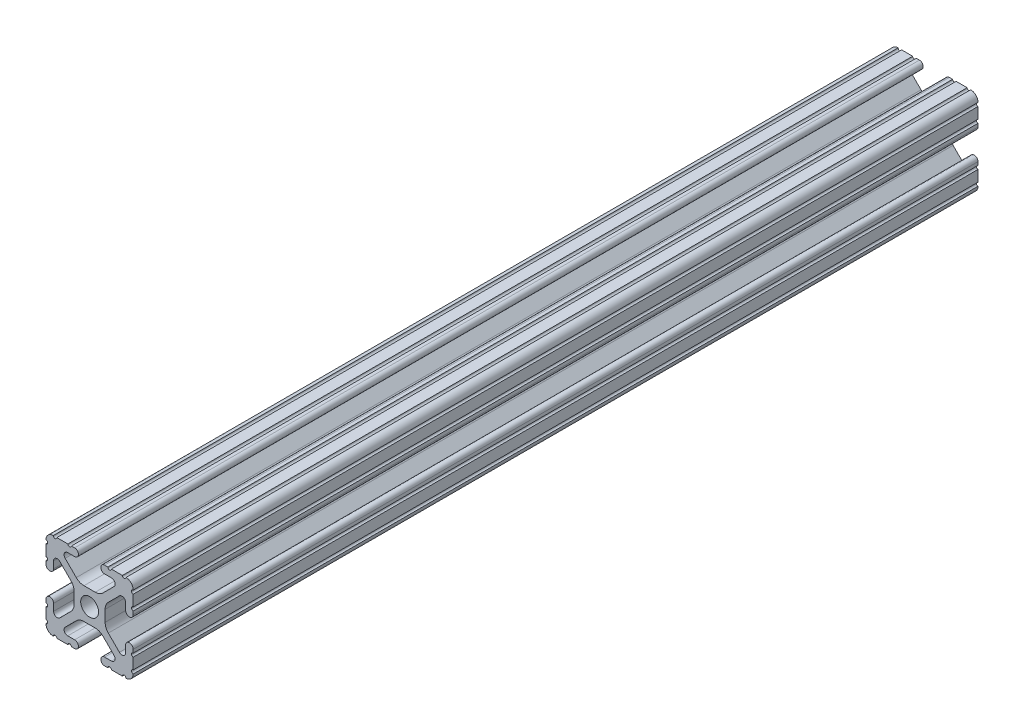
ISO-10303-21;
HEADER;
FILE_DESCRIPTION(('STEP AP214'),'2;1');
FILE_NAME('part.step','',(''),(''),'','','');
FILE_SCHEMA(('AUTOMOTIVE_DESIGN { 1 0 10303 214 1 1 1 1 }'));
ENDSEC;
DATA;
#1=APPLICATION_CONTEXT('core data for automotive mechanical design processes');
#2=APPLICATION_PROTOCOL_DEFINITION('international standard','automotive_design',2000,#1);
#3=PRODUCT_CONTEXT('',#1,'mechanical');
#4=PRODUCT('Part','Part','',(#3));
#5=PRODUCT_RELATED_PRODUCT_CATEGORY('part','',(#4));
#6=PRODUCT_DEFINITION_FORMATION('','',#4);
#7=PRODUCT_DEFINITION_CONTEXT('part definition',#1,'design');
#8=PRODUCT_DEFINITION('design','',#6,#7);
#9=PRODUCT_DEFINITION_SHAPE('','',#8);
#10=(LENGTH_UNIT() NAMED_UNIT(*) SI_UNIT(.MILLI.,.METRE.));
#11=(NAMED_UNIT(*) PLANE_ANGLE_UNIT() SI_UNIT($,.RADIAN.));
#12=(NAMED_UNIT(*) SI_UNIT($,.STERADIAN.) SOLID_ANGLE_UNIT());
#13=UNCERTAINTY_MEASURE_WITH_UNIT(LENGTH_MEASURE(1.E-05),#10,'distance_accuracy_value','');
#14=(GEOMETRIC_REPRESENTATION_CONTEXT(3) GLOBAL_UNCERTAINTY_ASSIGNED_CONTEXT((#13)) GLOBAL_UNIT_ASSIGNED_CONTEXT((#10,
#11,#12)) REPRESENTATION_CONTEXT('',''));
#15=CARTESIAN_POINT('',(0.,0.,0.));
#16=DIRECTION('',(0.,0.,1.));
#17=DIRECTION('',(1.,0.,0.));
#18=AXIS2_PLACEMENT_3D('',#15,#16,#17);
#19=CARTESIAN_POINT('',(10.5918,10.5918,-246.));
#20=DIRECTION('',(0.,0.,1.));
#21=DIRECTION('',(1.,0.,0.));
#22=AXIS2_PLACEMENT_3D('',#19,#20,#21);
#23=CYLINDRICAL_SURFACE('',#22,2.1082);
#24=CARTESIAN_POINT('',(10.5918,10.5918,0.));
#25=DIRECTION('',(0.,0.,1.));
#26=DIRECTION('',(1.,0.,0.));
#27=AXIS2_PLACEMENT_3D('',#24,#25,#26);
#28=CIRCLE('',#27,2.1082);
#29=CARTESIAN_POINT('',(12.7,10.5918,0.));
#30=VERTEX_POINT('',#29);
#31=CARTESIAN_POINT('',(10.5918,12.7,0.));
#32=VERTEX_POINT('',#31);
#33=EDGE_CURVE('E622',#30,#32,#28,.T.);
#34=ORIENTED_EDGE('',*,*,#33,.F.);
#35=DIRECTION('',(0.,0.,1.));
#36=VECTOR('',#35,1.);
#37=CARTESIAN_POINT('',(12.7,10.5918,-246.));
#38=LINE('',#37,#36);
#39=CARTESIAN_POINT('',(12.7,10.5918,-246.));
#40=VERTEX_POINT('',#39);
#41=EDGE_CURVE('E11',#40,#30,#38,.T.);
#42=ORIENTED_EDGE('',*,*,#41,.F.);
#43=CARTESIAN_POINT('',(10.5918,10.5918,-246.));
#44=DIRECTION('',(0.,0.,1.));
#45=DIRECTION('',(1.,0.,0.));
#46=AXIS2_PLACEMENT_3D('',#43,#44,#45);
#47=CIRCLE('',#46,2.1082);
#48=CARTESIAN_POINT('',(10.5918,12.7,-246.));
#49=VERTEX_POINT('',#48);
#50=EDGE_CURVE('E971',#40,#49,#47,.T.);
#51=ORIENTED_EDGE('',*,*,#50,.T.);
#52=DIRECTION('',(0.,0.,1.));
#53=VECTOR('',#52,1.);
#54=CARTESIAN_POINT('',(10.5918,12.7,-246.));
#55=LINE('',#54,#53);
#56=EDGE_CURVE('E42',#49,#32,#55,.T.);
#57=ORIENTED_EDGE('',*,*,#56,.T.);
#58=EDGE_LOOP('',(#34,#42,#51,#57));
#59=FACE_BOUND('',#58,.T.);
#60=ADVANCED_FACE('F39',(#59),#23,.T.);
#61=CARTESIAN_POINT('',(12.7,10.5664,-246.));
#62=DIRECTION('',(1.,0.,0.));
#63=DIRECTION('',(0.,0.,-1.));
#64=AXIS2_PLACEMENT_3D('',#61,#62,#63);
#65=PLANE('',#64);
#66=DIRECTION('',(0.,1.,0.));
#67=VECTOR('',#66,1.);
#68=CARTESIAN_POINT('',(12.7,10.5664,0.));
#69=LINE('',#68,#67);
#70=CARTESIAN_POINT('',(12.7,10.5664,0.));
#71=VERTEX_POINT('',#70);
#72=EDGE_CURVE('E968',#71,#30,#69,.T.);
#73=ORIENTED_EDGE('',*,*,#72,.F.);
#74=DIRECTION('',(0.,0.,1.));
#75=VECTOR('',#74,1.);
#76=CARTESIAN_POINT('',(12.7,10.5664,-246.));
#77=LINE('',#76,#75);
#78=CARTESIAN_POINT('',(12.7,10.5664,-246.));
#79=VERTEX_POINT('',#78);
#80=EDGE_CURVE('E49',#79,#71,#77,.T.);
#81=ORIENTED_EDGE('',*,*,#80,.F.);
#82=DIRECTION('',(0.,1.,0.));
#83=VECTOR('',#82,1.);
#84=CARTESIAN_POINT('',(12.7,10.5664,-246.));
#85=LINE('',#84,#83);
#86=EDGE_CURVE('E608',#79,#40,#85,.T.);
#87=ORIENTED_EDGE('',*,*,#86,.T.);
#88=ORIENTED_EDGE('',*,*,#41,.T.);
#89=EDGE_LOOP('',(#73,#81,#87,#88));
#90=FACE_BOUND('',#89,.T.);
#91=ADVANCED_FACE('F1229',(#90),#65,.T.);
#92=CARTESIAN_POINT('',(12.7,10.0584,-246.));
#93=DIRECTION('',(0.,0.,1.));
#94=DIRECTION('',(1.,0.,0.));
#95=AXIS2_PLACEMENT_3D('',#92,#93,#94);
#96=CYLINDRICAL_SURFACE('',#95,0.508000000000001);
#97=CARTESIAN_POINT('',(12.7,10.0584,0.));
#98=DIRECTION('',(0.,0.,-1.));
#99=DIRECTION('',(1.,0.,0.));
#100=AXIS2_PLACEMENT_3D('',#97,#98,#99);
#101=CIRCLE('',#100,0.508000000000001);
#102=CARTESIAN_POINT('',(12.7,9.55040000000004,0.));
#103=VERTEX_POINT('',#102);
#104=EDGE_CURVE('E594',#103,#71,#101,.T.);
#105=ORIENTED_EDGE('',*,*,#104,.F.);
#106=DIRECTION('',(0.,0.,1.));
#107=VECTOR('',#106,1.);
#108=CARTESIAN_POINT('',(12.7,9.55040000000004,-246.));
#109=LINE('',#108,#107);
#110=CARTESIAN_POINT('',(12.7,9.55040000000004,-246.));
#111=VERTEX_POINT('',#110);
#112=EDGE_CURVE('E589',#111,#103,#109,.T.);
#113=ORIENTED_EDGE('',*,*,#112,.F.);
#114=CARTESIAN_POINT('',(12.7,10.0584,-246.));
#115=DIRECTION('',(0.,0.,-1.));
#116=DIRECTION('',(1.,0.,0.));
#117=AXIS2_PLACEMENT_3D('',#114,#115,#116);
#118=CIRCLE('',#117,0.508000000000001);
#119=EDGE_CURVE('E592',#111,#79,#118,.T.);
#120=ORIENTED_EDGE('',*,*,#119,.T.);
#121=ORIENTED_EDGE('',*,*,#80,.T.);
#122=EDGE_LOOP('',(#105,#113,#120,#121));
#123=FACE_BOUND('',#122,.T.);
#124=ADVANCED_FACE('F591',(#123),#96,.F.);
#125=CARTESIAN_POINT('',(12.7,6.32460000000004,-246.));
#126=DIRECTION('',(1.,0.,0.));
#127=DIRECTION('',(0.,0.,-1.));
#128=AXIS2_PLACEMENT_3D('',#125,#126,#127);
#129=PLANE('',#128);
#130=DIRECTION('',(0.,1.,0.));
#131=VECTOR('',#130,1.);
#132=CARTESIAN_POINT('',(12.7,6.32460000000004,0.));
#133=LINE('',#132,#131);
#134=CARTESIAN_POINT('',(12.7,6.32460000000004,0.));
#135=VERTEX_POINT('',#134);
#136=EDGE_CURVE('E963',#135,#103,#133,.T.);
#137=ORIENTED_EDGE('',*,*,#136,.F.);
#138=DIRECTION('',(0.,0.,1.));
#139=VECTOR('',#138,1.);
#140=CARTESIAN_POINT('',(12.7,6.32460000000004,-246.));
#141=LINE('',#140,#139);
#142=CARTESIAN_POINT('',(12.7,6.32460000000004,-246.));
#143=VERTEX_POINT('',#142);
#144=EDGE_CURVE('E600',#143,#135,#141,.T.);
#145=ORIENTED_EDGE('',*,*,#144,.F.);
#146=DIRECTION('',(0.,1.,0.));
#147=VECTOR('',#146,1.);
#148=CARTESIAN_POINT('',(12.7,6.32460000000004,-246.));
#149=LINE('',#148,#147);
#150=EDGE_CURVE('E606',#143,#111,#149,.T.);
#151=ORIENTED_EDGE('',*,*,#150,.T.);
#152=ORIENTED_EDGE('',*,*,#112,.T.);
#153=EDGE_LOOP('',(#137,#145,#151,#152));
#154=FACE_BOUND('',#153,.T.);
#155=ADVANCED_FACE('F611',(#154),#129,.T.);
#156=CARTESIAN_POINT('',(12.7,5.81660000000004,-246.));
#157=DIRECTION('',(0.,0.,1.));
#158=DIRECTION('',(1.,0.,0.));
#159=AXIS2_PLACEMENT_3D('',#156,#157,#158);
#160=CYLINDRICAL_SURFACE('',#159,0.508);
#161=CARTESIAN_POINT('',(12.7,5.81660000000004,0.));
#162=DIRECTION('',(0.,0.,-1.));
#163=DIRECTION('',(1.,0.,0.));
#164=AXIS2_PLACEMENT_3D('',#161,#162,#163);
#165=CIRCLE('',#164,0.508);
#166=CARTESIAN_POINT('',(12.7,5.30860000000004,0.));
#167=VERTEX_POINT('',#166);
#168=EDGE_CURVE('E959',#167,#135,#165,.T.);
#169=ORIENTED_EDGE('',*,*,#168,.F.);
#170=DIRECTION('',(0.,0.,1.));
#171=VECTOR('',#170,1.);
#172=CARTESIAN_POINT('',(12.7,5.30860000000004,-246.));
#173=LINE('',#172,#171);
#174=CARTESIAN_POINT('',(12.7,5.30860000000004,-246.));
#175=VERTEX_POINT('',#174);
#176=EDGE_CURVE('E977',#175,#167,#173,.T.);
#177=ORIENTED_EDGE('',*,*,#176,.F.);
#178=CARTESIAN_POINT('',(12.7,5.81660000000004,-246.));
#179=DIRECTION('',(0.,0.,-1.));
#180=DIRECTION('',(1.,0.,0.));
#181=AXIS2_PLACEMENT_3D('',#178,#179,#180);
#182=CIRCLE('',#181,0.508);
#183=EDGE_CURVE('E613',#175,#143,#182,.T.);
#184=ORIENTED_EDGE('',*,*,#183,.T.);
#185=ORIENTED_EDGE('',*,*,#144,.T.);
#186=EDGE_LOOP('',(#169,#177,#184,#185));
#187=FACE_BOUND('',#186,.T.);
#188=ADVANCED_FACE('F1242',(#187),#160,.F.);
#189=CARTESIAN_POINT('',(12.7,4.35610000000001,-246.));
#190=DIRECTION('',(1.,0.,0.));
#191=DIRECTION('',(0.,1.,0.));
#192=AXIS2_PLACEMENT_3D('',#189,#190,#191);
#193=PLANE('',#192);
#194=DIRECTION('',(0.,1.,0.));
#195=VECTOR('',#194,1.);
#196=CARTESIAN_POINT('',(12.7,4.35610000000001,0.));
#197=LINE('',#196,#195);
#198=CARTESIAN_POINT('',(12.7,4.35610000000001,0.));
#199=VERTEX_POINT('',#198);
#200=EDGE_CURVE('E955',#199,#167,#197,.T.);
#201=ORIENTED_EDGE('',*,*,#200,.F.);
#202=DIRECTION('',(0.,0.,1.));
#203=VECTOR('',#202,1.);
#204=CARTESIAN_POINT('',(12.7,4.35610000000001,-246.));
#205=LINE('',#204,#203);
#206=CARTESIAN_POINT('',(12.7,4.35610000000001,-246.));
#207=VERTEX_POINT('',#206);
#208=EDGE_CURVE('E980',#207,#199,#205,.T.);
#209=ORIENTED_EDGE('',*,*,#208,.F.);
#210=DIRECTION('',(0.,1.,0.));
#211=VECTOR('',#210,1.);
#212=CARTESIAN_POINT('',(12.7,4.35610000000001,-246.));
#213=LINE('',#212,#211);
#214=EDGE_CURVE('E616',#207,#175,#213,.T.);
#215=ORIENTED_EDGE('',*,*,#214,.T.);
#216=ORIENTED_EDGE('',*,*,#176,.T.);
#217=EDGE_LOOP('',(#201,#209,#215,#216));
#218=FACE_BOUND('',#217,.T.);
#219=ADVANCED_FACE('F1245',(#218),#193,.T.);
#220=CARTESIAN_POINT('',(11.5951,4.35610000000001,-246.));
#221=DIRECTION('',(0.,0.,1.));
#222=DIRECTION('',(1.,0.,0.));
#223=AXIS2_PLACEMENT_3D('',#220,#221,#222);
#224=CYLINDRICAL_SURFACE('',#223,1.1049);
#225=CARTESIAN_POINT('',(11.5951,4.35610000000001,0.));
#226=DIRECTION('',(0.,0.,1.));
#227=DIRECTION('',(1.,0.,0.));
#228=AXIS2_PLACEMENT_3D('',#225,#226,#227);
#229=CIRCLE('',#228,1.1049);
#230=CARTESIAN_POINT('',(10.4902,4.35610000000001,0.));
#231=VERTEX_POINT('',#230);
#232=EDGE_CURVE('E951',#231,#199,#229,.T.);
#233=ORIENTED_EDGE('',*,*,#232,.F.);
#234=DIRECTION('',(0.,0.,1.));
#235=VECTOR('',#234,1.);
#236=CARTESIAN_POINT('',(10.4902,4.35610000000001,-246.));
#237=LINE('',#236,#235);
#238=CARTESIAN_POINT('',(10.4902,4.35610000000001,-246.));
#239=VERTEX_POINT('',#238);
#240=EDGE_CURVE('E983',#239,#231,#237,.T.);
#241=ORIENTED_EDGE('',*,*,#240,.F.);
#242=CARTESIAN_POINT('',(11.5951,4.35610000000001,-246.));
#243=DIRECTION('',(0.,0.,1.));
#244=DIRECTION('',(1.,0.,0.));
#245=AXIS2_PLACEMENT_3D('',#242,#243,#244);
#246=CIRCLE('',#245,1.1049);
#247=EDGE_CURVE('E1924',#239,#207,#246,.T.);
#248=ORIENTED_EDGE('',*,*,#247,.T.);
#249=ORIENTED_EDGE('',*,*,#208,.T.);
#250=EDGE_LOOP('',(#233,#241,#248,#249));
#251=FACE_BOUND('',#250,.T.);
#252=ADVANCED_FACE('F1249',(#251),#224,.T.);
#253=CARTESIAN_POINT('',(10.4902,6.37008378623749,-246.));
#254=DIRECTION('',(-1.,0.,0.));
#255=DIRECTION('',(0.,0.,1.));
#256=AXIS2_PLACEMENT_3D('',#253,#254,#255);
#257=PLANE('',#256);
#258=DIRECTION('',(0.,-1.,0.));
#259=VECTOR('',#258,1.);
#260=CARTESIAN_POINT('',(10.4902,6.37008378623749,0.));
#261=LINE('',#260,#259);
#262=CARTESIAN_POINT('',(10.4902,6.37008378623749,0.));
#263=VERTEX_POINT('',#262);
#264=EDGE_CURVE('E947',#263,#231,#261,.T.);
#265=ORIENTED_EDGE('',*,*,#264,.F.);
#266=DIRECTION('',(0.,0.,1.));
#267=VECTOR('',#266,1.);
#268=CARTESIAN_POINT('',(10.4902,6.37008378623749,-246.));
#269=LINE('',#268,#267);
#270=CARTESIAN_POINT('',(10.4902,6.37008378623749,-246.));
#271=VERTEX_POINT('',#270);
#272=EDGE_CURVE('E986',#271,#263,#269,.T.);
#273=ORIENTED_EDGE('',*,*,#272,.F.);
#274=DIRECTION('',(0.,-1.,0.));
#275=VECTOR('',#274,1.);
#276=CARTESIAN_POINT('',(10.4902,6.37008378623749,-246.));
#277=LINE('',#276,#275);
#278=EDGE_CURVE('E1920',#271,#239,#277,.T.);
#279=ORIENTED_EDGE('',*,*,#278,.T.);
#280=ORIENTED_EDGE('',*,*,#240,.T.);
#281=EDGE_LOOP('',(#265,#273,#279,#280));
#282=FACE_BOUND('',#281,.T.);
#283=ADVANCED_FACE('F1253',(#282),#257,.T.);
#284=CARTESIAN_POINT('',(9.4307837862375,6.37008378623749,-246.));
#285=DIRECTION('',(0.,0.,1.));
#286=DIRECTION('',(1.,0.,0.));
#287=AXIS2_PLACEMENT_3D('',#284,#285,#286);
#288=CYLINDRICAL_SURFACE('',#287,1.0594162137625);
#289=CARTESIAN_POINT('',(9.4307837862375,6.37008378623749,0.));
#290=DIRECTION('',(0.,0.,-1.));
#291=DIRECTION('',(1.,0.,0.));
#292=AXIS2_PLACEMENT_3D('',#289,#290,#291);
#293=CIRCLE('',#292,1.0594162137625);
#294=CARTESIAN_POINT('',(8.68166339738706,7.11920417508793,0.));
#295=VERTEX_POINT('',#294);
#296=EDGE_CURVE('E943',#295,#263,#293,.T.);
#297=ORIENTED_EDGE('',*,*,#296,.F.);
#298=DIRECTION('',(0.,0.,1.));
#299=VECTOR('',#298,1.);
#300=CARTESIAN_POINT('',(8.68166339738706,7.11920417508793,-246.));
#301=LINE('',#300,#299);
#302=CARTESIAN_POINT('',(8.68166339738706,7.11920417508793,-246.));
#303=VERTEX_POINT('',#302);
#304=EDGE_CURVE('E989',#303,#295,#301,.T.);
#305=ORIENTED_EDGE('',*,*,#304,.F.);
#306=CARTESIAN_POINT('',(9.4307837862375,6.37008378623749,-246.));
#307=DIRECTION('',(0.,0.,-1.));
#308=DIRECTION('',(1.,0.,0.));
#309=AXIS2_PLACEMENT_3D('',#306,#307,#308);
#310=CIRCLE('',#309,1.0594162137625);
#311=EDGE_CURVE('E1916',#303,#271,#310,.T.);
#312=ORIENTED_EDGE('',*,*,#311,.T.);
#313=ORIENTED_EDGE('',*,*,#272,.T.);
#314=EDGE_LOOP('',(#297,#305,#312,#313));
#315=FACE_BOUND('',#314,.T.);
#316=ADVANCED_FACE('F1257',(#315),#288,.F.);
#317=CARTESIAN_POINT('',(5.44710311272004,3.88464389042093,-246.));
#318=DIRECTION('',(0.707106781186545,-0.70710678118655,0.));
#319=DIRECTION('',(0.70710678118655,0.707106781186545,0.));
#320=AXIS2_PLACEMENT_3D('',#317,#318,#319);
#321=PLANE('',#320);
#322=DIRECTION('',(0.70710678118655,0.707106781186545,0.));
#323=VECTOR('',#322,1.);
#324=CARTESIAN_POINT('',(5.44710311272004,3.88464389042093,0.));
#325=LINE('',#324,#323);
#326=CARTESIAN_POINT('',(5.44710311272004,3.88464389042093,0.));
#327=VERTEX_POINT('',#326);
#328=EDGE_CURVE('E939',#327,#295,#325,.T.);
#329=ORIENTED_EDGE('',*,*,#328,.F.);
#330=DIRECTION('',(0.,0.,1.));
#331=VECTOR('',#330,1.);
#332=CARTESIAN_POINT('',(5.44710311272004,3.88464389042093,-246.));
#333=LINE('',#332,#331);
#334=CARTESIAN_POINT('',(5.44710311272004,3.88464389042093,-246.));
#335=VERTEX_POINT('',#334);
#336=EDGE_CURVE('E992',#335,#327,#333,.T.);
#337=ORIENTED_EDGE('',*,*,#336,.F.);
#338=DIRECTION('',(0.70710678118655,0.707106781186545,0.));
#339=VECTOR('',#338,1.);
#340=CARTESIAN_POINT('',(5.44710311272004,3.88464389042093,-246.));
#341=LINE('',#340,#339);
#342=EDGE_CURVE('E1912',#335,#303,#341,.T.);
#343=ORIENTED_EDGE('',*,*,#342,.T.);
#344=ORIENTED_EDGE('',*,*,#304,.T.);
#345=EDGE_LOOP('',(#329,#337,#343,#344));
#346=FACE_BOUND('',#345,.T.);
#347=ADVANCED_FACE('F1261',(#346),#321,.T.);
#348=CARTESIAN_POINT('',(7.69216714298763,1.63957986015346,-246.));
#349=DIRECTION('',(0.,0.,1.));
#350=DIRECTION('',(1.,0.,0.));
#351=AXIS2_PLACEMENT_3D('',#348,#349,#350);
#352=CYLINDRICAL_SURFACE('',#351,3.17500000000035);
#353=CARTESIAN_POINT('',(7.69216714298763,1.63957986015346,0.));
#354=DIRECTION('',(0.,0.,-1.));
#355=DIRECTION('',(1.,0.,0.));
#356=AXIS2_PLACEMENT_3D('',#353,#354,#355);
#357=CIRCLE('',#356,3.17500000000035);
#358=CARTESIAN_POINT('',(4.51716714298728,1.63957986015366,0.));
#359=VERTEX_POINT('',#358);
#360=EDGE_CURVE('E935',#359,#327,#357,.T.);
#361=ORIENTED_EDGE('',*,*,#360,.F.);
#362=DIRECTION('',(0.,0.,1.));
#363=VECTOR('',#362,1.);
#364=CARTESIAN_POINT('',(4.51716714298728,1.63957986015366,-246.));
#365=LINE('',#364,#363);
#366=CARTESIAN_POINT('',(4.51716714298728,1.63957986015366,-246.));
#367=VERTEX_POINT('',#366);
#368=EDGE_CURVE('E995',#367,#359,#365,.T.);
#369=ORIENTED_EDGE('',*,*,#368,.F.);
#370=CARTESIAN_POINT('',(7.69216714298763,1.63957986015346,-246.));
#371=DIRECTION('',(0.,0.,-1.));
#372=DIRECTION('',(1.,0.,0.));
#373=AXIS2_PLACEMENT_3D('',#370,#371,#372);
#374=CIRCLE('',#373,3.17500000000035);
#375=EDGE_CURVE('E1908',#367,#335,#374,.T.);
#376=ORIENTED_EDGE('',*,*,#375,.T.);
#377=ORIENTED_EDGE('',*,*,#336,.T.);
#378=EDGE_LOOP('',(#361,#369,#376,#377));
#379=FACE_BOUND('',#378,.T.);
#380=ADVANCED_FACE('F1265',(#379),#352,.F.);
#381=CARTESIAN_POINT('',(4.51716714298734,-1.63957986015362,-246.));
#382=DIRECTION('',(1.,0.,0.));
#383=DIRECTION('',(0.,1.,0.));
#384=AXIS2_PLACEMENT_3D('',#381,#382,#383);
#385=PLANE('',#384);
#386=DIRECTION('',(0.,1.,0.));
#387=VECTOR('',#386,1.);
#388=CARTESIAN_POINT('',(4.51716714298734,-1.63957986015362,0.));
#389=LINE('',#388,#387);
#390=CARTESIAN_POINT('',(4.51716714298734,-1.63957986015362,0.));
#391=VERTEX_POINT('',#390);
#392=EDGE_CURVE('E931',#391,#359,#389,.T.);
#393=ORIENTED_EDGE('',*,*,#392,.F.);
#394=DIRECTION('',(0.,0.,1.));
#395=VECTOR('',#394,1.);
#396=CARTESIAN_POINT('',(4.51716714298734,-1.63957986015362,-246.));
#397=LINE('',#396,#395);
#398=CARTESIAN_POINT('',(4.51716714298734,-1.63957986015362,-246.));
#399=VERTEX_POINT('',#398);
#400=EDGE_CURVE('E998',#399,#391,#397,.T.);
#401=ORIENTED_EDGE('',*,*,#400,.F.);
#402=DIRECTION('',(0.,1.,0.));
#403=VECTOR('',#402,1.);
#404=CARTESIAN_POINT('',(4.51716714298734,-1.63957986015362,-246.));
#405=LINE('',#404,#403);
#406=EDGE_CURVE('E1904',#399,#367,#405,.T.);
#407=ORIENTED_EDGE('',*,*,#406,.T.);
#408=ORIENTED_EDGE('',*,*,#368,.T.);
#409=EDGE_LOOP('',(#393,#401,#407,#408));
#410=FACE_BOUND('',#409,.T.);
#411=ADVANCED_FACE('F1269',(#410),#385,.T.);
#412=CARTESIAN_POINT('',(7.6921671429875,-1.63957986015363,-246.));
#413=DIRECTION('',(0.,0.,1.));
#414=DIRECTION('',(1.,0.,0.));
#415=AXIS2_PLACEMENT_3D('',#412,#413,#414);
#416=CYLINDRICAL_SURFACE('',#415,3.17500000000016);
#417=CARTESIAN_POINT('',(7.6921671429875,-1.63957986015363,0.));
#418=DIRECTION('',(0.,0.,-1.));
#419=DIRECTION('',(1.,0.,0.));
#420=AXIS2_PLACEMENT_3D('',#417,#418,#419);
#421=CIRCLE('',#420,3.17500000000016);
#422=CARTESIAN_POINT('',(5.44710311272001,-3.88464389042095,0.));
#423=VERTEX_POINT('',#422);
#424=EDGE_CURVE('E927',#423,#391,#421,.T.);
#425=ORIENTED_EDGE('',*,*,#424,.F.);
#426=DIRECTION('',(0.,0.,1.));
#427=VECTOR('',#426,1.);
#428=CARTESIAN_POINT('',(5.44710311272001,-3.88464389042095,-246.));
#429=LINE('',#428,#427);
#430=CARTESIAN_POINT('',(5.44710311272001,-3.88464389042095,-246.));
#431=VERTEX_POINT('',#430);
#432=EDGE_CURVE('E1001',#431,#423,#429,.T.);
#433=ORIENTED_EDGE('',*,*,#432,.F.);
#434=CARTESIAN_POINT('',(7.6921671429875,-1.63957986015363,-246.));
#435=DIRECTION('',(0.,0.,-1.));
#436=DIRECTION('',(1.,0.,0.));
#437=AXIS2_PLACEMENT_3D('',#434,#435,#436);
#438=CIRCLE('',#437,3.17500000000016);
#439=EDGE_CURVE('E1900',#431,#399,#438,.T.);
#440=ORIENTED_EDGE('',*,*,#439,.T.);
#441=ORIENTED_EDGE('',*,*,#400,.T.);
#442=EDGE_LOOP('',(#425,#433,#440,#441));
#443=FACE_BOUND('',#442,.T.);
#444=ADVANCED_FACE('F1273',(#443),#416,.F.);
#445=CARTESIAN_POINT('',(8.68166339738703,-7.11920417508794,-246.));
#446=DIRECTION('',(0.707106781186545,0.70710678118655,0.));
#447=DIRECTION('',(-0.70710678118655,0.707106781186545,0.));
#448=AXIS2_PLACEMENT_3D('',#445,#446,#447);
#449=PLANE('',#448);
#450=DIRECTION('',(-0.70710678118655,0.707106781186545,0.));
#451=VECTOR('',#450,1.);
#452=CARTESIAN_POINT('',(8.68166339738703,-7.11920417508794,0.));
#453=LINE('',#452,#451);
#454=CARTESIAN_POINT('',(8.68166339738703,-7.11920417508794,0.));
#455=VERTEX_POINT('',#454);
#456=EDGE_CURVE('E923',#455,#423,#453,.T.);
#457=ORIENTED_EDGE('',*,*,#456,.F.);
#458=DIRECTION('',(0.,0.,1.));
#459=VECTOR('',#458,1.);
#460=CARTESIAN_POINT('',(8.68166339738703,-7.11920417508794,-246.));
#461=LINE('',#460,#459);
#462=CARTESIAN_POINT('',(8.68166339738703,-7.11920417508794,-246.));
#463=VERTEX_POINT('',#462);
#464=EDGE_CURVE('E1004',#463,#455,#461,.T.);
#465=ORIENTED_EDGE('',*,*,#464,.F.);
#466=DIRECTION('',(-0.70710678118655,0.707106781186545,0.));
#467=VECTOR('',#466,1.);
#468=CARTESIAN_POINT('',(8.68166339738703,-7.11920417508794,-246.));
#469=LINE('',#468,#467);
#470=EDGE_CURVE('E1896',#463,#431,#469,.T.);
#471=ORIENTED_EDGE('',*,*,#470,.T.);
#472=ORIENTED_EDGE('',*,*,#432,.T.);
#473=EDGE_LOOP('',(#457,#465,#471,#472));
#474=FACE_BOUND('',#473,.T.);
#475=ADVANCED_FACE('F1277',(#474),#449,.T.);
#476=CARTESIAN_POINT('',(9.43078378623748,-6.37008378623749,-246.));
#477=DIRECTION('',(0.,0.,1.));
#478=DIRECTION('',(1.,0.,0.));
#479=AXIS2_PLACEMENT_3D('',#476,#477,#478);
#480=CYLINDRICAL_SURFACE('',#479,1.05941621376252);
#481=CARTESIAN_POINT('',(9.43078378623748,-6.37008378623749,0.));
#482=DIRECTION('',(0.,0.,-1.));
#483=DIRECTION('',(1.,0.,0.));
#484=AXIS2_PLACEMENT_3D('',#481,#482,#483);
#485=CIRCLE('',#484,1.05941621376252);
#486=CARTESIAN_POINT('',(10.4902,-6.37008378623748,0.));
#487=VERTEX_POINT('',#486);
#488=EDGE_CURVE('E919',#487,#455,#485,.T.);
#489=ORIENTED_EDGE('',*,*,#488,.F.);
#490=DIRECTION('',(0.,0.,1.));
#491=VECTOR('',#490,1.);
#492=CARTESIAN_POINT('',(10.4902,-6.37008378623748,-246.));
#493=LINE('',#492,#491);
#494=CARTESIAN_POINT('',(10.4902,-6.37008378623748,-246.));
#495=VERTEX_POINT('',#494);
#496=EDGE_CURVE('E1007',#495,#487,#493,.T.);
#497=ORIENTED_EDGE('',*,*,#496,.F.);
#498=CARTESIAN_POINT('',(9.43078378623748,-6.37008378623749,-246.));
#499=DIRECTION('',(0.,0.,-1.));
#500=DIRECTION('',(1.,0.,0.));
#501=AXIS2_PLACEMENT_3D('',#498,#499,#500);
#502=CIRCLE('',#501,1.05941621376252);
#503=EDGE_CURVE('E1892',#495,#463,#502,.T.);
#504=ORIENTED_EDGE('',*,*,#503,.T.);
#505=ORIENTED_EDGE('',*,*,#464,.T.);
#506=EDGE_LOOP('',(#489,#497,#504,#505));
#507=FACE_BOUND('',#506,.T.);
#508=ADVANCED_FACE('F1281',(#507),#480,.F.);
#509=CARTESIAN_POINT('',(10.4902,-4.3561,-246.));
#510=DIRECTION('',(-1.,0.,0.));
#511=DIRECTION('',(0.,-1.,0.));
#512=AXIS2_PLACEMENT_3D('',#509,#510,#511);
#513=PLANE('',#512);
#514=DIRECTION('',(0.,-1.,0.));
#515=VECTOR('',#514,1.);
#516=CARTESIAN_POINT('',(10.4902,-4.3561,0.));
#517=LINE('',#516,#515);
#518=CARTESIAN_POINT('',(10.4902,-4.3561,0.));
#519=VERTEX_POINT('',#518);
#520=EDGE_CURVE('E915',#519,#487,#517,.T.);
#521=ORIENTED_EDGE('',*,*,#520,.F.);
#522=DIRECTION('',(0.,0.,1.));
#523=VECTOR('',#522,1.);
#524=CARTESIAN_POINT('',(10.4902,-4.3561,-246.));
#525=LINE('',#524,#523);
#526=CARTESIAN_POINT('',(10.4902,-4.3561,-246.));
#527=VERTEX_POINT('',#526);
#528=EDGE_CURVE('E1010',#527,#519,#525,.T.);
#529=ORIENTED_EDGE('',*,*,#528,.F.);
#530=DIRECTION('',(0.,-1.,0.));
#531=VECTOR('',#530,1.);
#532=CARTESIAN_POINT('',(10.4902,-4.3561,-246.));
#533=LINE('',#532,#531);
#534=EDGE_CURVE('E1888',#527,#495,#533,.T.);
#535=ORIENTED_EDGE('',*,*,#534,.T.);
#536=ORIENTED_EDGE('',*,*,#496,.T.);
#537=EDGE_LOOP('',(#521,#529,#535,#536));
#538=FACE_BOUND('',#537,.T.);
#539=ADVANCED_FACE('F1285',(#538),#513,.T.);
#540=CARTESIAN_POINT('',(11.5951,-4.3561,-246.));
#541=DIRECTION('',(0.,0.,1.));
#542=DIRECTION('',(1.,0.,0.));
#543=AXIS2_PLACEMENT_3D('',#540,#541,#542);
#544=CYLINDRICAL_SURFACE('',#543,1.1049);
#545=CARTESIAN_POINT('',(11.5951,-4.3561,0.));
#546=DIRECTION('',(0.,0.,1.));
#547=DIRECTION('',(1.,0.,0.));
#548=AXIS2_PLACEMENT_3D('',#545,#546,#547);
#549=CIRCLE('',#548,1.1049);
#550=CARTESIAN_POINT('',(12.7,-4.3561,0.));
#551=VERTEX_POINT('',#550);
#552=EDGE_CURVE('E911',#551,#519,#549,.T.);
#553=ORIENTED_EDGE('',*,*,#552,.F.);
#554=DIRECTION('',(0.,0.,1.));
#555=VECTOR('',#554,1.);
#556=CARTESIAN_POINT('',(12.7,-4.3561,-246.));
#557=LINE('',#556,#555);
#558=CARTESIAN_POINT('',(12.7,-4.3561,-246.));
#559=VERTEX_POINT('',#558);
#560=EDGE_CURVE('E1013',#559,#551,#557,.T.);
#561=ORIENTED_EDGE('',*,*,#560,.F.);
#562=CARTESIAN_POINT('',(11.5951,-4.3561,-246.));
#563=DIRECTION('',(0.,0.,1.));
#564=DIRECTION('',(1.,0.,0.));
#565=AXIS2_PLACEMENT_3D('',#562,#563,#564);
#566=CIRCLE('',#565,1.1049);
#567=EDGE_CURVE('E1884',#559,#527,#566,.T.);
#568=ORIENTED_EDGE('',*,*,#567,.T.);
#569=ORIENTED_EDGE('',*,*,#528,.T.);
#570=EDGE_LOOP('',(#553,#561,#568,#569));
#571=FACE_BOUND('',#570,.T.);
#572=ADVANCED_FACE('F1289',(#571),#544,.T.);
#573=CARTESIAN_POINT('',(12.7,-5.30860000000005,-246.));
#574=DIRECTION('',(1.,0.,0.));
#575=DIRECTION('',(0.,1.,0.));
#576=AXIS2_PLACEMENT_3D('',#573,#574,#575);
#577=PLANE('',#576);
#578=DIRECTION('',(0.,1.,0.));
#579=VECTOR('',#578,1.);
#580=CARTESIAN_POINT('',(12.7,-5.30860000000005,0.));
#581=LINE('',#580,#579);
#582=CARTESIAN_POINT('',(12.7,-5.30860000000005,0.));
#583=VERTEX_POINT('',#582);
#584=EDGE_CURVE('E907',#583,#551,#581,.T.);
#585=ORIENTED_EDGE('',*,*,#584,.F.);
#586=DIRECTION('',(0.,0.,1.));
#587=VECTOR('',#586,1.);
#588=CARTESIAN_POINT('',(12.7,-5.30860000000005,-246.));
#589=LINE('',#588,#587);
#590=CARTESIAN_POINT('',(12.7,-5.30860000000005,-246.));
#591=VERTEX_POINT('',#590);
#592=EDGE_CURVE('E1016',#591,#583,#589,.T.);
#593=ORIENTED_EDGE('',*,*,#592,.F.);
#594=DIRECTION('',(0.,1.,0.));
#595=VECTOR('',#594,1.);
#596=CARTESIAN_POINT('',(12.7,-5.30860000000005,-246.));
#597=LINE('',#596,#595);
#598=EDGE_CURVE('E1880',#591,#559,#597,.T.);
#599=ORIENTED_EDGE('',*,*,#598,.T.);
#600=ORIENTED_EDGE('',*,*,#560,.T.);
#601=EDGE_LOOP('',(#585,#593,#599,#600));
#602=FACE_BOUND('',#601,.T.);
#603=ADVANCED_FACE('F1293',(#602),#577,.T.);
#604=CARTESIAN_POINT('',(12.7,-5.81660000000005,-246.));
#605=DIRECTION('',(0.,0.,1.));
#606=DIRECTION('',(1.,0.,0.));
#607=AXIS2_PLACEMENT_3D('',#604,#605,#606);
#608=CYLINDRICAL_SURFACE('',#607,0.508000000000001);
#609=CARTESIAN_POINT('',(12.7,-5.81660000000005,0.));
#610=DIRECTION('',(0.,0.,-1.));
#611=DIRECTION('',(1.,0.,0.));
#612=AXIS2_PLACEMENT_3D('',#609,#610,#611);
#613=CIRCLE('',#612,0.508000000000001);
#614=CARTESIAN_POINT('',(12.7,-6.32460000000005,0.));
#615=VERTEX_POINT('',#614);
#616=EDGE_CURVE('E903',#615,#583,#613,.T.);
#617=ORIENTED_EDGE('',*,*,#616,.F.);
#618=DIRECTION('',(0.,0.,1.));
#619=VECTOR('',#618,1.);
#620=CARTESIAN_POINT('',(12.7,-6.32460000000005,-246.));
#621=LINE('',#620,#619);
#622=CARTESIAN_POINT('',(12.7,-6.32460000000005,-246.));
#623=VERTEX_POINT('',#622);
#624=EDGE_CURVE('E1019',#623,#615,#621,.T.);
#625=ORIENTED_EDGE('',*,*,#624,.F.);
#626=CARTESIAN_POINT('',(12.7,-5.81660000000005,-246.));
#627=DIRECTION('',(0.,0.,-1.));
#628=DIRECTION('',(1.,0.,0.));
#629=AXIS2_PLACEMENT_3D('',#626,#627,#628);
#630=CIRCLE('',#629,0.508000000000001);
#631=EDGE_CURVE('E1876',#623,#591,#630,.T.);
#632=ORIENTED_EDGE('',*,*,#631,.T.);
#633=ORIENTED_EDGE('',*,*,#592,.T.);
#634=EDGE_LOOP('',(#617,#625,#632,#633));
#635=FACE_BOUND('',#634,.T.);
#636=ADVANCED_FACE('F1297',(#635),#608,.F.);
#637=CARTESIAN_POINT('',(12.7,-9.55040000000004,-246.));
#638=DIRECTION('',(1.,0.,0.));
#639=DIRECTION('',(0.,0.,-1.));
#640=AXIS2_PLACEMENT_3D('',#637,#638,#639);
#641=PLANE('',#640);
#642=DIRECTION('',(0.,1.,0.));
#643=VECTOR('',#642,1.);
#644=CARTESIAN_POINT('',(12.7,-9.55040000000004,0.));
#645=LINE('',#644,#643);
#646=CARTESIAN_POINT('',(12.7,-9.55040000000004,0.));
#647=VERTEX_POINT('',#646);
#648=EDGE_CURVE('E899',#647,#615,#645,.T.);
#649=ORIENTED_EDGE('',*,*,#648,.F.);
#650=DIRECTION('',(0.,0.,1.));
#651=VECTOR('',#650,1.);
#652=CARTESIAN_POINT('',(12.7,-9.55040000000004,-246.));
#653=LINE('',#652,#651);
#654=CARTESIAN_POINT('',(12.7,-9.55040000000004,-246.));
#655=VERTEX_POINT('',#654);
#656=EDGE_CURVE('E1022',#655,#647,#653,.T.);
#657=ORIENTED_EDGE('',*,*,#656,.F.);
#658=DIRECTION('',(0.,1.,0.));
#659=VECTOR('',#658,1.);
#660=CARTESIAN_POINT('',(12.7,-9.55040000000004,-246.));
#661=LINE('',#660,#659);
#662=EDGE_CURVE('E1872',#655,#623,#661,.T.);
#663=ORIENTED_EDGE('',*,*,#662,.T.);
#664=ORIENTED_EDGE('',*,*,#624,.T.);
#665=EDGE_LOOP('',(#649,#657,#663,#664));
#666=FACE_BOUND('',#665,.T.);
#667=ADVANCED_FACE('F1301',(#666),#641,.T.);
#668=CARTESIAN_POINT('',(12.7,-10.0584,-246.));
#669=DIRECTION('',(0.,0.,1.));
#670=DIRECTION('',(1.,0.,0.));
#671=AXIS2_PLACEMENT_3D('',#668,#669,#670);
#672=CYLINDRICAL_SURFACE('',#671,0.508);
#673=CARTESIAN_POINT('',(12.7,-10.0584,0.));
#674=DIRECTION('',(0.,0.,-1.));
#675=DIRECTION('',(1.,0.,0.));
#676=AXIS2_PLACEMENT_3D('',#673,#674,#675);
#677=CIRCLE('',#676,0.508);
#678=CARTESIAN_POINT('',(12.7,-10.5664,0.));
#679=VERTEX_POINT('',#678);
#680=EDGE_CURVE('E895',#679,#647,#677,.T.);
#681=ORIENTED_EDGE('',*,*,#680,.F.);
#682=DIRECTION('',(0.,0.,1.));
#683=VECTOR('',#682,1.);
#684=CARTESIAN_POINT('',(12.7,-10.5664,-246.));
#685=LINE('',#684,#683);
#686=CARTESIAN_POINT('',(12.7,-10.5664,-246.));
#687=VERTEX_POINT('',#686);
#688=EDGE_CURVE('E1025',#687,#679,#685,.T.);
#689=ORIENTED_EDGE('',*,*,#688,.F.);
#690=CARTESIAN_POINT('',(12.7,-10.0584,-246.));
#691=DIRECTION('',(0.,0.,-1.));
#692=DIRECTION('',(1.,0.,0.));
#693=AXIS2_PLACEMENT_3D('',#690,#691,#692);
#694=CIRCLE('',#693,0.508);
#695=EDGE_CURVE('E1868',#687,#655,#694,.T.);
#696=ORIENTED_EDGE('',*,*,#695,.T.);
#697=ORIENTED_EDGE('',*,*,#656,.T.);
#698=EDGE_LOOP('',(#681,#689,#696,#697));
#699=FACE_BOUND('',#698,.T.);
#700=ADVANCED_FACE('F1305',(#699),#672,.F.);
#701=CARTESIAN_POINT('',(12.7,-10.5918,-246.));
#702=DIRECTION('',(1.,0.,0.));
#703=DIRECTION('',(0.,0.,-1.));
#704=AXIS2_PLACEMENT_3D('',#701,#702,#703);
#705=PLANE('',#704);
#706=DIRECTION('',(0.,1.,0.));
#707=VECTOR('',#706,1.);
#708=CARTESIAN_POINT('',(12.7,-10.5918,0.));
#709=LINE('',#708,#707);
#710=CARTESIAN_POINT('',(12.7,-10.5918,0.));
#711=VERTEX_POINT('',#710);
#712=EDGE_CURVE('E891',#711,#679,#709,.T.);
#713=ORIENTED_EDGE('',*,*,#712,.F.);
#714=DIRECTION('',(0.,0.,1.));
#715=VECTOR('',#714,1.);
#716=CARTESIAN_POINT('',(12.7,-10.5918,-246.));
#717=LINE('',#716,#715);
#718=CARTESIAN_POINT('',(12.7,-10.5918,-246.));
#719=VERTEX_POINT('',#718);
#720=EDGE_CURVE('E1028',#719,#711,#717,.T.);
#721=ORIENTED_EDGE('',*,*,#720,.F.);
#722=DIRECTION('',(0.,1.,0.));
#723=VECTOR('',#722,1.);
#724=CARTESIAN_POINT('',(12.7,-10.5918,-246.));
#725=LINE('',#724,#723);
#726=EDGE_CURVE('E1864',#719,#687,#725,.T.);
#727=ORIENTED_EDGE('',*,*,#726,.T.);
#728=ORIENTED_EDGE('',*,*,#688,.T.);
#729=EDGE_LOOP('',(#713,#721,#727,#728));
#730=FACE_BOUND('',#729,.T.);
#731=ADVANCED_FACE('F1309',(#730),#705,.T.);
#732=CARTESIAN_POINT('',(10.5918,-10.5918,-246.));
#733=DIRECTION('',(0.,0.,1.));
#734=DIRECTION('',(1.,0.,0.));
#735=AXIS2_PLACEMENT_3D('',#732,#733,#734);
#736=CYLINDRICAL_SURFACE('',#735,2.1082);
#737=CARTESIAN_POINT('',(10.5918,-10.5918,0.));
#738=DIRECTION('',(0.,0.,1.));
#739=DIRECTION('',(1.,0.,0.));
#740=AXIS2_PLACEMENT_3D('',#737,#738,#739);
#741=CIRCLE('',#740,2.1082);
#742=CARTESIAN_POINT('',(10.5918,-12.7,0.));
#743=VERTEX_POINT('',#742);
#744=EDGE_CURVE('E887',#743,#711,#741,.T.);
#745=ORIENTED_EDGE('',*,*,#744,.F.);
#746=DIRECTION('',(0.,0.,1.));
#747=VECTOR('',#746,1.);
#748=CARTESIAN_POINT('',(10.5918,-12.7,-246.));
#749=LINE('',#748,#747);
#750=CARTESIAN_POINT('',(10.5918,-12.7,-246.));
#751=VERTEX_POINT('',#750);
#752=EDGE_CURVE('E1031',#751,#743,#749,.T.);
#753=ORIENTED_EDGE('',*,*,#752,.F.);
#754=CARTESIAN_POINT('',(10.5918,-10.5918,-246.));
#755=DIRECTION('',(0.,0.,1.));
#756=DIRECTION('',(1.,0.,0.));
#757=AXIS2_PLACEMENT_3D('',#754,#755,#756);
#758=CIRCLE('',#757,2.1082);
#759=EDGE_CURVE('E1860',#751,#719,#758,.T.);
#760=ORIENTED_EDGE('',*,*,#759,.T.);
#761=ORIENTED_EDGE('',*,*,#720,.T.);
#762=EDGE_LOOP('',(#745,#753,#760,#761));
#763=FACE_BOUND('',#762,.T.);
#764=ADVANCED_FACE('F1313',(#763),#736,.T.);
#765=CARTESIAN_POINT('',(10.5664,-12.7,-246.));
#766=DIRECTION('',(6.14665798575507E-13,-1.,0.));
#767=DIRECTION('',(1.,6.14665798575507E-13,0.));
#768=AXIS2_PLACEMENT_3D('',#765,#766,#767);
#769=PLANE('',#768);
#770=DIRECTION('',(1.,6.14665798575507E-13,0.));
#771=VECTOR('',#770,1.);
#772=CARTESIAN_POINT('',(10.5664,-12.7,0.));
#773=LINE('',#772,#771);
#774=CARTESIAN_POINT('',(10.5664,-12.7,0.));
#775=VERTEX_POINT('',#774);
#776=EDGE_CURVE('E883',#775,#743,#773,.T.);
#777=ORIENTED_EDGE('',*,*,#776,.F.);
#778=DIRECTION('',(0.,0.,1.));
#779=VECTOR('',#778,1.);
#780=CARTESIAN_POINT('',(10.5664,-12.7,-246.));
#781=LINE('',#780,#779);
#782=CARTESIAN_POINT('',(10.5664,-12.7,-246.));
#783=VERTEX_POINT('',#782);
#784=EDGE_CURVE('E1034',#783,#775,#781,.T.);
#785=ORIENTED_EDGE('',*,*,#784,.F.);
#786=DIRECTION('',(1.,6.14665798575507E-13,0.));
#787=VECTOR('',#786,1.);
#788=CARTESIAN_POINT('',(10.5664,-12.7,-246.));
#789=LINE('',#788,#787);
#790=EDGE_CURVE('E1856',#783,#751,#789,.T.);
#791=ORIENTED_EDGE('',*,*,#790,.T.);
#792=ORIENTED_EDGE('',*,*,#752,.T.);
#793=EDGE_LOOP('',(#777,#785,#791,#792));
#794=FACE_BOUND('',#793,.T.);
#795=ADVANCED_FACE('F1317',(#794),#769,.T.);
#796=CARTESIAN_POINT('',(10.0584,-12.7,-246.));
#797=DIRECTION('',(0.,0.,1.));
#798=DIRECTION('',(1.,0.,0.));
#799=AXIS2_PLACEMENT_3D('',#796,#797,#798);
#800=CYLINDRICAL_SURFACE('',#799,0.508000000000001);
#801=CARTESIAN_POINT('',(10.0584,-12.7,0.));
#802=DIRECTION('',(0.,0.,-1.));
#803=DIRECTION('',(1.,0.,0.));
#804=AXIS2_PLACEMENT_3D('',#801,#802,#803);
#805=CIRCLE('',#804,0.508000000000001);
#806=CARTESIAN_POINT('',(9.55040000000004,-12.7,0.));
#807=VERTEX_POINT('',#806);
#808=EDGE_CURVE('E879',#807,#775,#805,.T.);
#809=ORIENTED_EDGE('',*,*,#808,.F.);
#810=DIRECTION('',(0.,0.,1.));
#811=VECTOR('',#810,1.);
#812=CARTESIAN_POINT('',(9.55040000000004,-12.7,-246.));
#813=LINE('',#812,#811);
#814=CARTESIAN_POINT('',(9.55040000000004,-12.7,-246.));
#815=VERTEX_POINT('',#814);
#816=EDGE_CURVE('E1037',#815,#807,#813,.T.);
#817=ORIENTED_EDGE('',*,*,#816,.F.);
#818=CARTESIAN_POINT('',(10.0584,-12.7,-246.));
#819=DIRECTION('',(0.,0.,-1.));
#820=DIRECTION('',(1.,0.,0.));
#821=AXIS2_PLACEMENT_3D('',#818,#819,#820);
#822=CIRCLE('',#821,0.508000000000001);
#823=EDGE_CURVE('E1852',#815,#783,#822,.T.);
#824=ORIENTED_EDGE('',*,*,#823,.T.);
#825=ORIENTED_EDGE('',*,*,#784,.T.);
#826=EDGE_LOOP('',(#809,#817,#824,#825));
#827=FACE_BOUND('',#826,.T.);
#828=ADVANCED_FACE('F1321',(#827),#800,.F.);
#829=CARTESIAN_POINT('',(6.32460000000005,-12.7,-246.));
#830=DIRECTION('',(0.,-1.,0.));
#831=DIRECTION('',(0.,0.,-1.));
#832=AXIS2_PLACEMENT_3D('',#829,#830,#831);
#833=PLANE('',#832);
#834=DIRECTION('',(1.,0.,0.));
#835=VECTOR('',#834,1.);
#836=CARTESIAN_POINT('',(6.32460000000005,-12.7,0.));
#837=LINE('',#836,#835);
#838=CARTESIAN_POINT('',(6.32460000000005,-12.7,0.));
#839=VERTEX_POINT('',#838);
#840=EDGE_CURVE('E875',#839,#807,#837,.T.);
#841=ORIENTED_EDGE('',*,*,#840,.F.);
#842=DIRECTION('',(0.,0.,1.));
#843=VECTOR('',#842,1.);
#844=CARTESIAN_POINT('',(6.32460000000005,-12.7,-246.));
#845=LINE('',#844,#843);
#846=CARTESIAN_POINT('',(6.32460000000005,-12.7,-246.));
#847=VERTEX_POINT('',#846);
#848=EDGE_CURVE('E1040',#847,#839,#845,.T.);
#849=ORIENTED_EDGE('',*,*,#848,.F.);
#850=DIRECTION('',(1.,0.,0.));
#851=VECTOR('',#850,1.);
#852=CARTESIAN_POINT('',(6.32460000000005,-12.7,-246.));
#853=LINE('',#852,#851);
#854=EDGE_CURVE('E1848',#847,#815,#853,.T.);
#855=ORIENTED_EDGE('',*,*,#854,.T.);
#856=ORIENTED_EDGE('',*,*,#816,.T.);
#857=EDGE_LOOP('',(#841,#849,#855,#856));
#858=FACE_BOUND('',#857,.T.);
#859=ADVANCED_FACE('F1325',(#858),#833,.T.);
#860=CARTESIAN_POINT('',(5.81660000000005,-12.7,-246.));
#861=DIRECTION('',(0.,0.,1.));
#862=DIRECTION('',(1.,0.,0.));
#863=AXIS2_PLACEMENT_3D('',#860,#861,#862);
#864=CYLINDRICAL_SURFACE('',#863,0.508);
#865=CARTESIAN_POINT('',(5.81660000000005,-12.7,0.));
#866=DIRECTION('',(0.,0.,-1.));
#867=DIRECTION('',(1.,0.,0.));
#868=AXIS2_PLACEMENT_3D('',#865,#866,#867);
#869=CIRCLE('',#868,0.508);
#870=CARTESIAN_POINT('',(5.30860000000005,-12.7,0.));
#871=VERTEX_POINT('',#870);
#872=EDGE_CURVE('E871',#871,#839,#869,.T.);
#873=ORIENTED_EDGE('',*,*,#872,.F.);
#874=DIRECTION('',(0.,0.,1.));
#875=VECTOR('',#874,1.);
#876=CARTESIAN_POINT('',(5.30860000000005,-12.7,-246.));
#877=LINE('',#876,#875);
#878=CARTESIAN_POINT('',(5.30860000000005,-12.7,-246.));
#879=VERTEX_POINT('',#878);
#880=EDGE_CURVE('E1043',#879,#871,#877,.T.);
#881=ORIENTED_EDGE('',*,*,#880,.F.);
#882=CARTESIAN_POINT('',(5.81660000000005,-12.7,-246.));
#883=DIRECTION('',(0.,0.,-1.));
#884=DIRECTION('',(1.,0.,0.));
#885=AXIS2_PLACEMENT_3D('',#882,#883,#884);
#886=CIRCLE('',#885,0.508);
#887=EDGE_CURVE('E1844',#879,#847,#886,.T.);
#888=ORIENTED_EDGE('',*,*,#887,.T.);
#889=ORIENTED_EDGE('',*,*,#848,.T.);
#890=EDGE_LOOP('',(#873,#881,#888,#889));
#891=FACE_BOUND('',#890,.T.);
#892=ADVANCED_FACE('F1329',(#891),#864,.F.);
#893=CARTESIAN_POINT('',(4.3561,-12.7,-246.));
#894=DIRECTION('',(0.,-1.,0.));
#895=DIRECTION('',(1.,0.,0.));
#896=AXIS2_PLACEMENT_3D('',#893,#894,#895);
#897=PLANE('',#896);
#898=DIRECTION('',(1.,0.,0.));
#899=VECTOR('',#898,1.);
#900=CARTESIAN_POINT('',(4.3561,-12.7,0.));
#901=LINE('',#900,#899);
#902=CARTESIAN_POINT('',(4.3561,-12.7,0.));
#903=VERTEX_POINT('',#902);
#904=EDGE_CURVE('E867',#903,#871,#901,.T.);
#905=ORIENTED_EDGE('',*,*,#904,.F.);
#906=DIRECTION('',(0.,0.,1.));
#907=VECTOR('',#906,1.);
#908=CARTESIAN_POINT('',(4.3561,-12.7,-246.));
#909=LINE('',#908,#907);
#910=CARTESIAN_POINT('',(4.3561,-12.7,-246.));
#911=VERTEX_POINT('',#910);
#912=EDGE_CURVE('E1046',#911,#903,#909,.T.);
#913=ORIENTED_EDGE('',*,*,#912,.F.);
#914=DIRECTION('',(1.,0.,0.));
#915=VECTOR('',#914,1.);
#916=CARTESIAN_POINT('',(4.3561,-12.7,-246.));
#917=LINE('',#916,#915);
#918=EDGE_CURVE('E1840',#911,#879,#917,.T.);
#919=ORIENTED_EDGE('',*,*,#918,.T.);
#920=ORIENTED_EDGE('',*,*,#880,.T.);
#921=EDGE_LOOP('',(#905,#913,#919,#920));
#922=FACE_BOUND('',#921,.T.);
#923=ADVANCED_FACE('F1333',(#922),#897,.T.);
#924=CARTESIAN_POINT('',(4.35610000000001,-11.5951,-246.));
#925=DIRECTION('',(0.,0.,1.));
#926=DIRECTION('',(1.,0.,0.));
#927=AXIS2_PLACEMENT_3D('',#924,#925,#926);
#928=CYLINDRICAL_SURFACE('',#927,1.1049);
#929=CARTESIAN_POINT('',(4.35610000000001,-11.5951,0.));
#930=DIRECTION('',(0.,0.,1.));
#931=DIRECTION('',(1.,0.,0.));
#932=AXIS2_PLACEMENT_3D('',#929,#930,#931);
#933=CIRCLE('',#932,1.1049);
#934=CARTESIAN_POINT('',(4.3561,-10.4902,0.));
#935=VERTEX_POINT('',#934);
#936=EDGE_CURVE('E863',#935,#903,#933,.T.);
#937=ORIENTED_EDGE('',*,*,#936,.F.);
#938=DIRECTION('',(0.,0.,1.));
#939=VECTOR('',#938,1.);
#940=CARTESIAN_POINT('',(4.3561,-10.4902,-246.));
#941=LINE('',#940,#939);
#942=CARTESIAN_POINT('',(4.3561,-10.4902,-246.));
#943=VERTEX_POINT('',#942);
#944=EDGE_CURVE('E1049',#943,#935,#941,.T.);
#945=ORIENTED_EDGE('',*,*,#944,.F.);
#946=CARTESIAN_POINT('',(4.35610000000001,-11.5951,-246.));
#947=DIRECTION('',(0.,0.,1.));
#948=DIRECTION('',(1.,0.,0.));
#949=AXIS2_PLACEMENT_3D('',#946,#947,#948);
#950=CIRCLE('',#949,1.1049);
#951=EDGE_CURVE('E1836',#943,#911,#950,.T.);
#952=ORIENTED_EDGE('',*,*,#951,.T.);
#953=ORIENTED_EDGE('',*,*,#912,.T.);
#954=EDGE_LOOP('',(#937,#945,#952,#953));
#955=FACE_BOUND('',#954,.T.);
#956=ADVANCED_FACE('F1337',(#955),#928,.T.);
#957=CARTESIAN_POINT('',(6.37008378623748,-10.4902,-246.));
#958=DIRECTION('',(0.,1.,0.));
#959=DIRECTION('',(-1.,0.,0.));
#960=AXIS2_PLACEMENT_3D('',#957,#958,#959);
#961=PLANE('',#960);
#962=DIRECTION('',(-1.,0.,0.));
#963=VECTOR('',#962,1.);
#964=CARTESIAN_POINT('',(6.37008378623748,-10.4902,0.));
#965=LINE('',#964,#963);
#966=CARTESIAN_POINT('',(6.37008378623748,-10.4902,0.));
#967=VERTEX_POINT('',#966);
#968=EDGE_CURVE('E859',#967,#935,#965,.T.);
#969=ORIENTED_EDGE('',*,*,#968,.F.);
#970=DIRECTION('',(0.,0.,1.));
#971=VECTOR('',#970,1.);
#972=CARTESIAN_POINT('',(6.37008378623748,-10.4902,-246.));
#973=LINE('',#972,#971);
#974=CARTESIAN_POINT('',(6.37008378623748,-10.4902,-246.));
#975=VERTEX_POINT('',#974);
#976=EDGE_CURVE('E1052',#975,#967,#973,.T.);
#977=ORIENTED_EDGE('',*,*,#976,.F.);
#978=DIRECTION('',(-1.,0.,0.));
#979=VECTOR('',#978,1.);
#980=CARTESIAN_POINT('',(6.37008378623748,-10.4902,-246.));
#981=LINE('',#980,#979);
#982=EDGE_CURVE('E1832',#975,#943,#981,.T.);
#983=ORIENTED_EDGE('',*,*,#982,.T.);
#984=ORIENTED_EDGE('',*,*,#944,.T.);
#985=EDGE_LOOP('',(#969,#977,#983,#984));
#986=FACE_BOUND('',#985,.T.);
#987=ADVANCED_FACE('F1341',(#986),#961,.T.);
#988=CARTESIAN_POINT('',(6.37008378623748,-9.43078378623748,-246.));
#989=DIRECTION('',(0.,0.,1.));
#990=DIRECTION('',(1.,0.,0.));
#991=AXIS2_PLACEMENT_3D('',#988,#989,#990);
#992=CYLINDRICAL_SURFACE('',#991,1.05941621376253);
#993=CARTESIAN_POINT('',(6.37008378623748,-9.43078378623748,0.));
#994=DIRECTION('',(0.,0.,-1.));
#995=DIRECTION('',(1.,0.,0.));
#996=AXIS2_PLACEMENT_3D('',#993,#994,#995);
#997=CIRCLE('',#996,1.05941621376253);
#998=CARTESIAN_POINT('',(7.11920417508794,-8.68166339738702,0.));
#999=VERTEX_POINT('',#998);
#1000=EDGE_CURVE('E855',#999,#967,#997,.T.);
#1001=ORIENTED_EDGE('',*,*,#1000,.F.);
#1002=DIRECTION('',(0.,0.,1.));
#1003=VECTOR('',#1002,1.);
#1004=CARTESIAN_POINT('',(7.11920417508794,-8.68166339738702,-246.));
#1005=LINE('',#1004,#1003);
#1006=CARTESIAN_POINT('',(7.11920417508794,-8.68166339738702,-246.));
#1007=VERTEX_POINT('',#1006);
#1008=EDGE_CURVE('E1055',#1007,#999,#1005,.T.);
#1009=ORIENTED_EDGE('',*,*,#1008,.F.);
#1010=CARTESIAN_POINT('',(6.37008378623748,-9.43078378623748,-246.));
#1011=DIRECTION('',(0.,0.,-1.));
#1012=DIRECTION('',(1.,0.,0.));
#1013=AXIS2_PLACEMENT_3D('',#1010,#1011,#1012);
#1014=CIRCLE('',#1013,1.05941621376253);
#1015=EDGE_CURVE('E1828',#1007,#975,#1014,.T.);
#1016=ORIENTED_EDGE('',*,*,#1015,.T.);
#1017=ORIENTED_EDGE('',*,*,#976,.T.);
#1018=EDGE_LOOP('',(#1001,#1009,#1016,#1017));
#1019=FACE_BOUND('',#1018,.T.);
#1020=ADVANCED_FACE('F1345',(#1019),#992,.F.);
#1021=CARTESIAN_POINT('',(3.88464389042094,-5.44710311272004,-246.));
#1022=DIRECTION('',(-0.707106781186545,-0.70710678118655,0.));
#1023=DIRECTION('',(0.70710678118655,-0.707106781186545,0.));
#1024=AXIS2_PLACEMENT_3D('',#1021,#1022,#1023);
#1025=PLANE('',#1024);
#1026=DIRECTION('',(0.70710678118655,-0.707106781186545,0.));
#1027=VECTOR('',#1026,1.);
#1028=CARTESIAN_POINT('',(3.88464389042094,-5.44710311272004,0.));
#1029=LINE('',#1028,#1027);
#1030=CARTESIAN_POINT('',(3.88464389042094,-5.44710311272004,0.));
#1031=VERTEX_POINT('',#1030);
#1032=EDGE_CURVE('E851',#1031,#999,#1029,.T.);
#1033=ORIENTED_EDGE('',*,*,#1032,.F.);
#1034=DIRECTION('',(0.,0.,1.));
#1035=VECTOR('',#1034,1.);
#1036=CARTESIAN_POINT('',(3.88464389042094,-5.44710311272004,-246.));
#1037=LINE('',#1036,#1035);
#1038=CARTESIAN_POINT('',(3.88464389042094,-5.44710311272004,-246.));
#1039=VERTEX_POINT('',#1038);
#1040=EDGE_CURVE('E1058',#1039,#1031,#1037,.T.);
#1041=ORIENTED_EDGE('',*,*,#1040,.F.);
#1042=DIRECTION('',(0.70710678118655,-0.707106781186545,0.));
#1043=VECTOR('',#1042,1.);
#1044=CARTESIAN_POINT('',(3.88464389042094,-5.44710311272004,-246.));
#1045=LINE('',#1044,#1043);
#1046=EDGE_CURVE('E1824',#1039,#1007,#1045,.T.);
#1047=ORIENTED_EDGE('',*,*,#1046,.T.);
#1048=ORIENTED_EDGE('',*,*,#1008,.T.);
#1049=EDGE_LOOP('',(#1033,#1041,#1047,#1048));
#1050=FACE_BOUND('',#1049,.T.);
#1051=ADVANCED_FACE('F1349',(#1050),#1025,.T.);
#1052=CARTESIAN_POINT('',(1.63957986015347,-7.69216714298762,-246.));
#1053=DIRECTION('',(0.,0.,1.));
#1054=DIRECTION('',(1.,0.,0.));
#1055=AXIS2_PLACEMENT_3D('',#1052,#1053,#1054);
#1056=CYLINDRICAL_SURFACE('',#1055,3.17500000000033);
#1057=CARTESIAN_POINT('',(1.63957986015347,-7.69216714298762,0.));
#1058=DIRECTION('',(0.,0.,-1.));
#1059=DIRECTION('',(1.,0.,0.));
#1060=AXIS2_PLACEMENT_3D('',#1057,#1058,#1059);
#1061=CIRCLE('',#1060,3.17500000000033);
#1062=CARTESIAN_POINT('',(1.63957986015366,-4.51716714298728,0.));
#1063=VERTEX_POINT('',#1062);
#1064=EDGE_CURVE('E847',#1063,#1031,#1061,.T.);
#1065=ORIENTED_EDGE('',*,*,#1064,.F.);
#1066=DIRECTION('',(0.,0.,1.));
#1067=VECTOR('',#1066,1.);
#1068=CARTESIAN_POINT('',(1.63957986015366,-4.51716714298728,-246.));
#1069=LINE('',#1068,#1067);
#1070=CARTESIAN_POINT('',(1.63957986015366,-4.51716714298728,-246.));
#1071=VERTEX_POINT('',#1070);
#1072=EDGE_CURVE('E1061',#1071,#1063,#1069,.T.);
#1073=ORIENTED_EDGE('',*,*,#1072,.F.);
#1074=CARTESIAN_POINT('',(1.63957986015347,-7.69216714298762,-246.));
#1075=DIRECTION('',(0.,0.,-1.));
#1076=DIRECTION('',(1.,0.,0.));
#1077=AXIS2_PLACEMENT_3D('',#1074,#1075,#1076);
#1078=CIRCLE('',#1077,3.17500000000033);
#1079=EDGE_CURVE('E1820',#1071,#1039,#1078,.T.);
#1080=ORIENTED_EDGE('',*,*,#1079,.T.);
#1081=ORIENTED_EDGE('',*,*,#1040,.T.);
#1082=EDGE_LOOP('',(#1065,#1073,#1080,#1081));
#1083=FACE_BOUND('',#1082,.T.);
#1084=ADVANCED_FACE('F1353',(#1083),#1056,.F.);
#1085=CARTESIAN_POINT('',(-1.63957986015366,-4.51716714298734,-246.));
#1086=DIRECTION('',(0.,-1.,0.));
#1087=DIRECTION('',(1.,0.,0.));
#1088=AXIS2_PLACEMENT_3D('',#1085,#1086,#1087);
#1089=PLANE('',#1088);
#1090=DIRECTION('',(1.,0.,0.));
#1091=VECTOR('',#1090,1.);
#1092=CARTESIAN_POINT('',(-1.63957986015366,-4.51716714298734,0.));
#1093=LINE('',#1092,#1091);
#1094=CARTESIAN_POINT('',(-1.63957986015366,-4.51716714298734,0.));
#1095=VERTEX_POINT('',#1094);
#1096=EDGE_CURVE('E843',#1095,#1063,#1093,.T.);
#1097=ORIENTED_EDGE('',*,*,#1096,.F.);
#1098=DIRECTION('',(0.,0.,1.));
#1099=VECTOR('',#1098,1.);
#1100=CARTESIAN_POINT('',(-1.63957986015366,-4.51716714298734,-246.));
#1101=LINE('',#1100,#1099);
#1102=CARTESIAN_POINT('',(-1.63957986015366,-4.51716714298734,-246.));
#1103=VERTEX_POINT('',#1102);
#1104=EDGE_CURVE('E1064',#1103,#1095,#1101,.T.);
#1105=ORIENTED_EDGE('',*,*,#1104,.F.);
#1106=DIRECTION('',(1.,0.,0.));
#1107=VECTOR('',#1106,1.);
#1108=CARTESIAN_POINT('',(-1.63957986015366,-4.51716714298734,-246.));
#1109=LINE('',#1108,#1107);
#1110=EDGE_CURVE('E1816',#1103,#1071,#1109,.T.);
#1111=ORIENTED_EDGE('',*,*,#1110,.T.);
#1112=ORIENTED_EDGE('',*,*,#1072,.T.);
#1113=EDGE_LOOP('',(#1097,#1105,#1111,#1112));
#1114=FACE_BOUND('',#1113,.T.);
#1115=ADVANCED_FACE('F1357',(#1114),#1089,.T.);
#1116=CARTESIAN_POINT('',(-1.63957986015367,-7.69216714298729,-246.));
#1117=DIRECTION('',(0.,0.,1.));
#1118=DIRECTION('',(1.,0.,0.));
#1119=AXIS2_PLACEMENT_3D('',#1116,#1117,#1118);
#1120=CYLINDRICAL_SURFACE('',#1119,3.17499999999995);
#1121=CARTESIAN_POINT('',(-1.63957986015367,-7.69216714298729,0.));
#1122=DIRECTION('',(0.,0.,-1.));
#1123=DIRECTION('',(1.,0.,0.));
#1124=AXIS2_PLACEMENT_3D('',#1121,#1122,#1123);
#1125=CIRCLE('',#1124,3.17499999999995);
#1126=CARTESIAN_POINT('',(-3.8846438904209,-5.44710311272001,0.));
#1127=VERTEX_POINT('',#1126);
#1128=EDGE_CURVE('E839',#1127,#1095,#1125,.T.);
#1129=ORIENTED_EDGE('',*,*,#1128,.F.);
#1130=DIRECTION('',(0.,0.,1.));
#1131=VECTOR('',#1130,1.);
#1132=CARTESIAN_POINT('',(-3.8846438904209,-5.44710311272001,-246.));
#1133=LINE('',#1132,#1131);
#1134=CARTESIAN_POINT('',(-3.8846438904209,-5.44710311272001,-246.));
#1135=VERTEX_POINT('',#1134);
#1136=EDGE_CURVE('E1067',#1135,#1127,#1133,.T.);
#1137=ORIENTED_EDGE('',*,*,#1136,.F.);
#1138=CARTESIAN_POINT('',(-1.63957986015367,-7.69216714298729,-246.));
#1139=DIRECTION('',(0.,0.,-1.));
#1140=DIRECTION('',(1.,0.,0.));
#1141=AXIS2_PLACEMENT_3D('',#1138,#1139,#1140);
#1142=CIRCLE('',#1141,3.17499999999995);
#1143=EDGE_CURVE('E1812',#1135,#1103,#1142,.T.);
#1144=ORIENTED_EDGE('',*,*,#1143,.T.);
#1145=ORIENTED_EDGE('',*,*,#1104,.T.);
#1146=EDGE_LOOP('',(#1129,#1137,#1144,#1145));
#1147=FACE_BOUND('',#1146,.T.);
#1148=ADVANCED_FACE('F1361',(#1147),#1120,.F.);
#1149=CARTESIAN_POINT('',(-7.11920417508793,-8.68166339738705,-246.));
#1150=DIRECTION('',(0.707106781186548,-0.707106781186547,0.));
#1151=DIRECTION('',(0.707106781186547,0.707106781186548,0.));
#1152=AXIS2_PLACEMENT_3D('',#1149,#1150,#1151);
#1153=PLANE('',#1152);
#1154=DIRECTION('',(0.707106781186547,0.707106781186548,0.));
#1155=VECTOR('',#1154,1.);
#1156=CARTESIAN_POINT('',(-7.11920417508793,-8.68166339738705,0.));
#1157=LINE('',#1156,#1155);
#1158=CARTESIAN_POINT('',(-7.11920417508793,-8.68166339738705,0.));
#1159=VERTEX_POINT('',#1158);
#1160=EDGE_CURVE('E835',#1159,#1127,#1157,.T.);
#1161=ORIENTED_EDGE('',*,*,#1160,.F.);
#1162=DIRECTION('',(0.,0.,1.));
#1163=VECTOR('',#1162,1.);
#1164=CARTESIAN_POINT('',(-7.11920417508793,-8.68166339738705,-246.));
#1165=LINE('',#1164,#1163);
#1166=CARTESIAN_POINT('',(-7.11920417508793,-8.68166339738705,-246.));
#1167=VERTEX_POINT('',#1166);
#1168=EDGE_CURVE('E1070',#1167,#1159,#1165,.T.);
#1169=ORIENTED_EDGE('',*,*,#1168,.F.);
#1170=DIRECTION('',(0.707106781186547,0.707106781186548,0.));
#1171=VECTOR('',#1170,1.);
#1172=CARTESIAN_POINT('',(-7.11920417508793,-8.68166339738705,-246.));
#1173=LINE('',#1172,#1171);
#1174=EDGE_CURVE('E1808',#1167,#1135,#1173,.T.);
#1175=ORIENTED_EDGE('',*,*,#1174,.T.);
#1176=ORIENTED_EDGE('',*,*,#1136,.T.);
#1177=EDGE_LOOP('',(#1161,#1169,#1175,#1176));
#1178=FACE_BOUND('',#1177,.T.);
#1179=ADVANCED_FACE('F1365',(#1178),#1153,.T.);
#1180=CARTESIAN_POINT('',(-6.37008378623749,-9.43078378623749,-246.));
#1181=DIRECTION('',(0.,0.,1.));
#1182=DIRECTION('',(1.,0.,0.));
#1183=AXIS2_PLACEMENT_3D('',#1180,#1181,#1182);
#1184=CYLINDRICAL_SURFACE('',#1183,1.0594162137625);
#1185=CARTESIAN_POINT('',(-6.37008378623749,-9.43078378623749,0.));
#1186=DIRECTION('',(0.,0.,-1.));
#1187=DIRECTION('',(1.,0.,0.));
#1188=AXIS2_PLACEMENT_3D('',#1185,#1186,#1187);
#1189=CIRCLE('',#1188,1.0594162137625);
#1190=CARTESIAN_POINT('',(-6.37008378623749,-10.4902,0.));
#1191=VERTEX_POINT('',#1190);
#1192=EDGE_CURVE('E831',#1191,#1159,#1189,.T.);
#1193=ORIENTED_EDGE('',*,*,#1192,.F.);
#1194=DIRECTION('',(0.,0.,1.));
#1195=VECTOR('',#1194,1.);
#1196=CARTESIAN_POINT('',(-6.37008378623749,-10.4902,-246.));
#1197=LINE('',#1196,#1195);
#1198=CARTESIAN_POINT('',(-6.37008378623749,-10.4902,-246.));
#1199=VERTEX_POINT('',#1198);
#1200=EDGE_CURVE('E1073',#1199,#1191,#1197,.T.);
#1201=ORIENTED_EDGE('',*,*,#1200,.F.);
#1202=CARTESIAN_POINT('',(-6.37008378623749,-9.43078378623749,-246.));
#1203=DIRECTION('',(0.,0.,-1.));
#1204=DIRECTION('',(1.,0.,0.));
#1205=AXIS2_PLACEMENT_3D('',#1202,#1203,#1204);
#1206=CIRCLE('',#1205,1.0594162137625);
#1207=EDGE_CURVE('E1804',#1199,#1167,#1206,.T.);
#1208=ORIENTED_EDGE('',*,*,#1207,.T.);
#1209=ORIENTED_EDGE('',*,*,#1168,.T.);
#1210=EDGE_LOOP('',(#1193,#1201,#1208,#1209));
#1211=FACE_BOUND('',#1210,.T.);
#1212=ADVANCED_FACE('F1369',(#1211),#1184,.F.);
#1213=CARTESIAN_POINT('',(-4.35610000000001,-10.4902,-246.));
#1214=DIRECTION('',(0.,1.,0.));
#1215=DIRECTION('',(-1.,0.,0.));
#1216=AXIS2_PLACEMENT_3D('',#1213,#1214,#1215);
#1217=PLANE('',#1216);
#1218=DIRECTION('',(-1.,0.,0.));
#1219=VECTOR('',#1218,1.);
#1220=CARTESIAN_POINT('',(-4.35610000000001,-10.4902,0.));
#1221=LINE('',#1220,#1219);
#1222=CARTESIAN_POINT('',(-4.35610000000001,-10.4902,0.));
#1223=VERTEX_POINT('',#1222);
#1224=EDGE_CURVE('E827',#1223,#1191,#1221,.T.);
#1225=ORIENTED_EDGE('',*,*,#1224,.F.);
#1226=DIRECTION('',(0.,0.,1.));
#1227=VECTOR('',#1226,1.);
#1228=CARTESIAN_POINT('',(-4.35610000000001,-10.4902,-246.));
#1229=LINE('',#1228,#1227);
#1230=CARTESIAN_POINT('',(-4.35610000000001,-10.4902,-246.));
#1231=VERTEX_POINT('',#1230);
#1232=EDGE_CURVE('E1076',#1231,#1223,#1229,.T.);
#1233=ORIENTED_EDGE('',*,*,#1232,.F.);
#1234=DIRECTION('',(-1.,0.,0.));
#1235=VECTOR('',#1234,1.);
#1236=CARTESIAN_POINT('',(-4.35610000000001,-10.4902,-246.));
#1237=LINE('',#1236,#1235);
#1238=EDGE_CURVE('E1800',#1231,#1199,#1237,.T.);
#1239=ORIENTED_EDGE('',*,*,#1238,.T.);
#1240=ORIENTED_EDGE('',*,*,#1200,.T.);
#1241=EDGE_LOOP('',(#1225,#1233,#1239,#1240));
#1242=FACE_BOUND('',#1241,.T.);
#1243=ADVANCED_FACE('F1373',(#1242),#1217,.T.);
#1244=CARTESIAN_POINT('',(-4.35610000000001,-11.5951,-246.));
#1245=DIRECTION('',(0.,0.,1.));
#1246=DIRECTION('',(1.,0.,0.));
#1247=AXIS2_PLACEMENT_3D('',#1244,#1245,#1246);
#1248=CYLINDRICAL_SURFACE('',#1247,1.1049);
#1249=CARTESIAN_POINT('',(-4.35610000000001,-11.5951,0.));
#1250=DIRECTION('',(0.,0.,1.));
#1251=DIRECTION('',(1.,0.,0.));
#1252=AXIS2_PLACEMENT_3D('',#1249,#1250,#1251);
#1253=CIRCLE('',#1252,1.1049);
#1254=CARTESIAN_POINT('',(-4.35610000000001,-12.7,0.));
#1255=VERTEX_POINT('',#1254);
#1256=EDGE_CURVE('E823',#1255,#1223,#1253,.T.);
#1257=ORIENTED_EDGE('',*,*,#1256,.F.);
#1258=DIRECTION('',(0.,0.,1.));
#1259=VECTOR('',#1258,1.);
#1260=CARTESIAN_POINT('',(-4.35610000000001,-12.7,-246.));
#1261=LINE('',#1260,#1259);
#1262=CARTESIAN_POINT('',(-4.35610000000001,-12.7,-246.));
#1263=VERTEX_POINT('',#1262);
#1264=EDGE_CURVE('E1079',#1263,#1255,#1261,.T.);
#1265=ORIENTED_EDGE('',*,*,#1264,.F.);
#1266=CARTESIAN_POINT('',(-4.35610000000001,-11.5951,-246.));
#1267=DIRECTION('',(0.,0.,1.));
#1268=DIRECTION('',(1.,0.,0.));
#1269=AXIS2_PLACEMENT_3D('',#1266,#1267,#1268);
#1270=CIRCLE('',#1269,1.1049);
#1271=EDGE_CURVE('E1796',#1263,#1231,#1270,.T.);
#1272=ORIENTED_EDGE('',*,*,#1271,.T.);
#1273=ORIENTED_EDGE('',*,*,#1232,.T.);
#1274=EDGE_LOOP('',(#1257,#1265,#1272,#1273));
#1275=FACE_BOUND('',#1274,.T.);
#1276=ADVANCED_FACE('F1377',(#1275),#1248,.T.);
#1277=CARTESIAN_POINT('',(-5.30860000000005,-12.7,-246.));
#1278=DIRECTION('',(0.,-1.,0.));
#1279=DIRECTION('',(0.,0.,-1.));
#1280=AXIS2_PLACEMENT_3D('',#1277,#1278,#1279);
#1281=PLANE('',#1280);
#1282=DIRECTION('',(1.,0.,0.));
#1283=VECTOR('',#1282,1.);
#1284=CARTESIAN_POINT('',(-5.30860000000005,-12.7,0.));
#1285=LINE('',#1284,#1283);
#1286=CARTESIAN_POINT('',(-5.30860000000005,-12.7,0.));
#1287=VERTEX_POINT('',#1286);
#1288=EDGE_CURVE('E819',#1287,#1255,#1285,.T.);
#1289=ORIENTED_EDGE('',*,*,#1288,.F.);
#1290=DIRECTION('',(0.,0.,1.));
#1291=VECTOR('',#1290,1.);
#1292=CARTESIAN_POINT('',(-5.30860000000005,-12.7,-246.));
#1293=LINE('',#1292,#1291);
#1294=CARTESIAN_POINT('',(-5.30860000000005,-12.7,-246.));
#1295=VERTEX_POINT('',#1294);
#1296=EDGE_CURVE('E1082',#1295,#1287,#1293,.T.);
#1297=ORIENTED_EDGE('',*,*,#1296,.F.);
#1298=DIRECTION('',(1.,0.,0.));
#1299=VECTOR('',#1298,1.);
#1300=CARTESIAN_POINT('',(-5.30860000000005,-12.7,-246.));
#1301=LINE('',#1300,#1299);
#1302=EDGE_CURVE('E1792',#1295,#1263,#1301,.T.);
#1303=ORIENTED_EDGE('',*,*,#1302,.T.);
#1304=ORIENTED_EDGE('',*,*,#1264,.T.);
#1305=EDGE_LOOP('',(#1289,#1297,#1303,#1304));
#1306=FACE_BOUND('',#1305,.T.);
#1307=ADVANCED_FACE('F1381',(#1306),#1281,.T.);
#1308=CARTESIAN_POINT('',(-5.81660000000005,-12.7,-246.));
#1309=DIRECTION('',(0.,0.,1.));
#1310=DIRECTION('',(1.,0.,0.));
#1311=AXIS2_PLACEMENT_3D('',#1308,#1309,#1310);
#1312=CYLINDRICAL_SURFACE('',#1311,0.508);
#1313=CARTESIAN_POINT('',(-5.81660000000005,-12.7,0.));
#1314=DIRECTION('',(0.,0.,-1.));
#1315=DIRECTION('',(1.,0.,0.));
#1316=AXIS2_PLACEMENT_3D('',#1313,#1314,#1315);
#1317=CIRCLE('',#1316,0.508);
#1318=CARTESIAN_POINT('',(-6.32460000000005,-12.7,0.));
#1319=VERTEX_POINT('',#1318);
#1320=EDGE_CURVE('E815',#1319,#1287,#1317,.T.);
#1321=ORIENTED_EDGE('',*,*,#1320,.F.);
#1322=DIRECTION('',(0.,0.,1.));
#1323=VECTOR('',#1322,1.);
#1324=CARTESIAN_POINT('',(-6.32460000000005,-12.7,-246.));
#1325=LINE('',#1324,#1323);
#1326=CARTESIAN_POINT('',(-6.32460000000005,-12.7,-246.));
#1327=VERTEX_POINT('',#1326);
#1328=EDGE_CURVE('E1085',#1327,#1319,#1325,.T.);
#1329=ORIENTED_EDGE('',*,*,#1328,.F.);
#1330=CARTESIAN_POINT('',(-5.81660000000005,-12.7,-246.));
#1331=DIRECTION('',(0.,0.,-1.));
#1332=DIRECTION('',(1.,0.,0.));
#1333=AXIS2_PLACEMENT_3D('',#1330,#1331,#1332);
#1334=CIRCLE('',#1333,0.508);
#1335=EDGE_CURVE('E1788',#1327,#1295,#1334,.T.);
#1336=ORIENTED_EDGE('',*,*,#1335,.T.);
#1337=ORIENTED_EDGE('',*,*,#1296,.T.);
#1338=EDGE_LOOP('',(#1321,#1329,#1336,#1337));
#1339=FACE_BOUND('',#1338,.T.);
#1340=ADVANCED_FACE('F1385',(#1339),#1312,.F.);
#1341=CARTESIAN_POINT('',(-9.55040000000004,-12.7,-246.));
#1342=DIRECTION('',(0.,-1.,0.));
#1343=DIRECTION('',(0.,0.,-1.));
#1344=AXIS2_PLACEMENT_3D('',#1341,#1342,#1343);
#1345=PLANE('',#1344);
#1346=DIRECTION('',(1.,0.,0.));
#1347=VECTOR('',#1346,1.);
#1348=CARTESIAN_POINT('',(-9.55040000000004,-12.7,0.));
#1349=LINE('',#1348,#1347);
#1350=CARTESIAN_POINT('',(-9.55040000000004,-12.7,0.));
#1351=VERTEX_POINT('',#1350);
#1352=EDGE_CURVE('E811',#1351,#1319,#1349,.T.);
#1353=ORIENTED_EDGE('',*,*,#1352,.F.);
#1354=DIRECTION('',(0.,0.,1.));
#1355=VECTOR('',#1354,1.);
#1356=CARTESIAN_POINT('',(-9.55040000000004,-12.7,-246.));
#1357=LINE('',#1356,#1355);
#1358=CARTESIAN_POINT('',(-9.55040000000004,-12.7,-246.));
#1359=VERTEX_POINT('',#1358);
#1360=EDGE_CURVE('E1088',#1359,#1351,#1357,.T.);
#1361=ORIENTED_EDGE('',*,*,#1360,.F.);
#1362=DIRECTION('',(1.,0.,0.));
#1363=VECTOR('',#1362,1.);
#1364=CARTESIAN_POINT('',(-9.55040000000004,-12.7,-246.));
#1365=LINE('',#1364,#1363);
#1366=EDGE_CURVE('E1784',#1359,#1327,#1365,.T.);
#1367=ORIENTED_EDGE('',*,*,#1366,.T.);
#1368=ORIENTED_EDGE('',*,*,#1328,.T.);
#1369=EDGE_LOOP('',(#1353,#1361,#1367,#1368));
#1370=FACE_BOUND('',#1369,.T.);
#1371=ADVANCED_FACE('F1389',(#1370),#1345,.T.);
#1372=CARTESIAN_POINT('',(-10.0584,-12.7,-246.));
#1373=DIRECTION('',(0.,0.,1.));
#1374=DIRECTION('',(1.,0.,0.));
#1375=AXIS2_PLACEMENT_3D('',#1372,#1373,#1374);
#1376=CYLINDRICAL_SURFACE('',#1375,0.508000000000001);
#1377=CARTESIAN_POINT('',(-10.0584,-12.7,0.));
#1378=DIRECTION('',(0.,0.,-1.));
#1379=DIRECTION('',(1.,0.,0.));
#1380=AXIS2_PLACEMENT_3D('',#1377,#1378,#1379);
#1381=CIRCLE('',#1380,0.508000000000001);
#1382=CARTESIAN_POINT('',(-10.5664,-12.7,0.));
#1383=VERTEX_POINT('',#1382);
#1384=EDGE_CURVE('E807',#1383,#1351,#1381,.T.);
#1385=ORIENTED_EDGE('',*,*,#1384,.F.);
#1386=DIRECTION('',(0.,0.,1.));
#1387=VECTOR('',#1386,1.);
#1388=CARTESIAN_POINT('',(-10.5664,-12.7,-246.));
#1389=LINE('',#1388,#1387);
#1390=CARTESIAN_POINT('',(-10.5664,-12.7,-246.));
#1391=VERTEX_POINT('',#1390);
#1392=EDGE_CURVE('E1091',#1391,#1383,#1389,.T.);
#1393=ORIENTED_EDGE('',*,*,#1392,.F.);
#1394=CARTESIAN_POINT('',(-10.0584,-12.7,-246.));
#1395=DIRECTION('',(0.,0.,-1.));
#1396=DIRECTION('',(1.,0.,0.));
#1397=AXIS2_PLACEMENT_3D('',#1394,#1395,#1396);
#1398=CIRCLE('',#1397,0.508000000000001);
#1399=EDGE_CURVE('E1780',#1391,#1359,#1398,.T.);
#1400=ORIENTED_EDGE('',*,*,#1399,.T.);
#1401=ORIENTED_EDGE('',*,*,#1360,.T.);
#1402=EDGE_LOOP('',(#1385,#1393,#1400,#1401));
#1403=FACE_BOUND('',#1402,.T.);
#1404=ADVANCED_FACE('F1393',(#1403),#1376,.F.);
#1405=CARTESIAN_POINT('',(-10.5918,-12.7,-246.));
#1406=DIRECTION('',(-1.36592399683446E-13,-1.,0.));
#1407=DIRECTION('',(1.,-1.36592399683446E-13,0.));
#1408=AXIS2_PLACEMENT_3D('',#1405,#1406,#1407);
#1409=PLANE('',#1408);
#1410=DIRECTION('',(1.,-1.36592399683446E-13,0.));
#1411=VECTOR('',#1410,1.);
#1412=CARTESIAN_POINT('',(-10.5918,-12.7,0.));
#1413=LINE('',#1412,#1411);
#1414=CARTESIAN_POINT('',(-10.5918,-12.7,0.));
#1415=VERTEX_POINT('',#1414);
#1416=EDGE_CURVE('E803',#1415,#1383,#1413,.T.);
#1417=ORIENTED_EDGE('',*,*,#1416,.F.);
#1418=DIRECTION('',(0.,0.,1.));
#1419=VECTOR('',#1418,1.);
#1420=CARTESIAN_POINT('',(-10.5918,-12.7,-246.));
#1421=LINE('',#1420,#1419);
#1422=CARTESIAN_POINT('',(-10.5918,-12.7,-246.));
#1423=VERTEX_POINT('',#1422);
#1424=EDGE_CURVE('E1094',#1423,#1415,#1421,.T.);
#1425=ORIENTED_EDGE('',*,*,#1424,.F.);
#1426=DIRECTION('',(1.,-1.36592399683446E-13,0.));
#1427=VECTOR('',#1426,1.);
#1428=CARTESIAN_POINT('',(-10.5918,-12.7,-246.));
#1429=LINE('',#1428,#1427);
#1430=EDGE_CURVE('E1776',#1423,#1391,#1429,.T.);
#1431=ORIENTED_EDGE('',*,*,#1430,.T.);
#1432=ORIENTED_EDGE('',*,*,#1392,.T.);
#1433=EDGE_LOOP('',(#1417,#1425,#1431,#1432));
#1434=FACE_BOUND('',#1433,.T.);
#1435=ADVANCED_FACE('F1397',(#1434),#1409,.T.);
#1436=CARTESIAN_POINT('',(-10.5918,-10.5918,-246.));
#1437=DIRECTION('',(0.,0.,1.));
#1438=DIRECTION('',(1.,0.,0.));
#1439=AXIS2_PLACEMENT_3D('',#1436,#1437,#1438);
#1440=CYLINDRICAL_SURFACE('',#1439,2.1082);
#1441=CARTESIAN_POINT('',(-10.5918,-10.5918,0.));
#1442=DIRECTION('',(0.,0.,1.));
#1443=DIRECTION('',(1.,0.,0.));
#1444=AXIS2_PLACEMENT_3D('',#1441,#1442,#1443);
#1445=CIRCLE('',#1444,2.1082);
#1446=CARTESIAN_POINT('',(-12.7,-10.5918,0.));
#1447=VERTEX_POINT('',#1446);
#1448=EDGE_CURVE('E799',#1447,#1415,#1445,.T.);
#1449=ORIENTED_EDGE('',*,*,#1448,.F.);
#1450=DIRECTION('',(0.,0.,1.));
#1451=VECTOR('',#1450,1.);
#1452=CARTESIAN_POINT('',(-12.7,-10.5918,-246.));
#1453=LINE('',#1452,#1451);
#1454=CARTESIAN_POINT('',(-12.7,-10.5918,-246.));
#1455=VERTEX_POINT('',#1454);
#1456=EDGE_CURVE('E1097',#1455,#1447,#1453,.T.);
#1457=ORIENTED_EDGE('',*,*,#1456,.F.);
#1458=CARTESIAN_POINT('',(-10.5918,-10.5918,-246.));
#1459=DIRECTION('',(0.,0.,1.));
#1460=DIRECTION('',(1.,0.,0.));
#1461=AXIS2_PLACEMENT_3D('',#1458,#1459,#1460);
#1462=CIRCLE('',#1461,2.1082);
#1463=EDGE_CURVE('E1772',#1455,#1423,#1462,.T.);
#1464=ORIENTED_EDGE('',*,*,#1463,.T.);
#1465=ORIENTED_EDGE('',*,*,#1424,.T.);
#1466=EDGE_LOOP('',(#1449,#1457,#1464,#1465));
#1467=FACE_BOUND('',#1466,.T.);
#1468=ADVANCED_FACE('F1401',(#1467),#1440,.T.);
#1469=CARTESIAN_POINT('',(-12.7,-10.5664,-246.));
#1470=DIRECTION('',(-1.,0.,0.));
#1471=DIRECTION('',(0.,0.,1.));
#1472=AXIS2_PLACEMENT_3D('',#1469,#1470,#1471);
#1473=PLANE('',#1472);
#1474=DIRECTION('',(0.,-1.,0.));
#1475=VECTOR('',#1474,1.);
#1476=CARTESIAN_POINT('',(-12.7,-10.5664,0.));
#1477=LINE('',#1476,#1475);
#1478=CARTESIAN_POINT('',(-12.7,-10.5664,0.));
#1479=VERTEX_POINT('',#1478);
#1480=EDGE_CURVE('E795',#1479,#1447,#1477,.T.);
#1481=ORIENTED_EDGE('',*,*,#1480,.F.);
#1482=DIRECTION('',(0.,0.,1.));
#1483=VECTOR('',#1482,1.);
#1484=CARTESIAN_POINT('',(-12.7,-10.5664,-246.));
#1485=LINE('',#1484,#1483);
#1486=CARTESIAN_POINT('',(-12.7,-10.5664,-246.));
#1487=VERTEX_POINT('',#1486);
#1488=EDGE_CURVE('E1100',#1487,#1479,#1485,.T.);
#1489=ORIENTED_EDGE('',*,*,#1488,.F.);
#1490=DIRECTION('',(0.,-1.,0.));
#1491=VECTOR('',#1490,1.);
#1492=CARTESIAN_POINT('',(-12.7,-10.5664,-246.));
#1493=LINE('',#1492,#1491);
#1494=EDGE_CURVE('E1768',#1487,#1455,#1493,.T.);
#1495=ORIENTED_EDGE('',*,*,#1494,.T.);
#1496=ORIENTED_EDGE('',*,*,#1456,.T.);
#1497=EDGE_LOOP('',(#1481,#1489,#1495,#1496));
#1498=FACE_BOUND('',#1497,.T.);
#1499=ADVANCED_FACE('F1405',(#1498),#1473,.T.);
#1500=CARTESIAN_POINT('',(-12.7,-10.0584,-246.));
#1501=DIRECTION('',(0.,0.,1.));
#1502=DIRECTION('',(1.,0.,0.));
#1503=AXIS2_PLACEMENT_3D('',#1500,#1501,#1502);
#1504=CYLINDRICAL_SURFACE('',#1503,0.508000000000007);
#1505=CARTESIAN_POINT('',(-12.7,-10.0584,0.));
#1506=DIRECTION('',(0.,0.,-1.));
#1507=DIRECTION('',(1.,0.,0.));
#1508=AXIS2_PLACEMENT_3D('',#1505,#1506,#1507);
#1509=CIRCLE('',#1508,0.508000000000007);
#1510=CARTESIAN_POINT('',(-12.7,-9.55040000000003,0.));
#1511=VERTEX_POINT('',#1510);
#1512=EDGE_CURVE('E791',#1511,#1479,#1509,.T.);
#1513=ORIENTED_EDGE('',*,*,#1512,.F.);
#1514=DIRECTION('',(0.,0.,1.));
#1515=VECTOR('',#1514,1.);
#1516=CARTESIAN_POINT('',(-12.7,-9.55040000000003,-246.));
#1517=LINE('',#1516,#1515);
#1518=CARTESIAN_POINT('',(-12.7,-9.55040000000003,-246.));
#1519=VERTEX_POINT('',#1518);
#1520=EDGE_CURVE('E1103',#1519,#1511,#1517,.T.);
#1521=ORIENTED_EDGE('',*,*,#1520,.F.);
#1522=CARTESIAN_POINT('',(-12.7,-10.0584,-246.));
#1523=DIRECTION('',(0.,0.,-1.));
#1524=DIRECTION('',(1.,0.,0.));
#1525=AXIS2_PLACEMENT_3D('',#1522,#1523,#1524);
#1526=CIRCLE('',#1525,0.508000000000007);
#1527=EDGE_CURVE('E1764',#1519,#1487,#1526,.T.);
#1528=ORIENTED_EDGE('',*,*,#1527,.T.);
#1529=ORIENTED_EDGE('',*,*,#1488,.T.);
#1530=EDGE_LOOP('',(#1513,#1521,#1528,#1529));
#1531=FACE_BOUND('',#1530,.T.);
#1532=ADVANCED_FACE('F1409',(#1531),#1504,.F.);
#1533=CARTESIAN_POINT('',(-12.7,-6.32460000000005,-246.));
#1534=DIRECTION('',(-1.,0.,0.));
#1535=DIRECTION('',(0.,0.,1.));
#1536=AXIS2_PLACEMENT_3D('',#1533,#1534,#1535);
#1537=PLANE('',#1536);
#1538=DIRECTION('',(0.,-1.,0.));
#1539=VECTOR('',#1538,1.);
#1540=CARTESIAN_POINT('',(-12.7,-6.32460000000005,0.));
#1541=LINE('',#1540,#1539);
#1542=CARTESIAN_POINT('',(-12.7,-6.32460000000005,0.));
#1543=VERTEX_POINT('',#1542);
#1544=EDGE_CURVE('E787',#1543,#1511,#1541,.T.);
#1545=ORIENTED_EDGE('',*,*,#1544,.F.);
#1546=DIRECTION('',(0.,0.,1.));
#1547=VECTOR('',#1546,1.);
#1548=CARTESIAN_POINT('',(-12.7,-6.32460000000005,-246.));
#1549=LINE('',#1548,#1547);
#1550=CARTESIAN_POINT('',(-12.7,-6.32460000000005,-246.));
#1551=VERTEX_POINT('',#1550);
#1552=EDGE_CURVE('E1106',#1551,#1543,#1549,.T.);
#1553=ORIENTED_EDGE('',*,*,#1552,.F.);
#1554=DIRECTION('',(0.,-1.,0.));
#1555=VECTOR('',#1554,1.);
#1556=CARTESIAN_POINT('',(-12.7,-6.32460000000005,-246.));
#1557=LINE('',#1556,#1555);
#1558=EDGE_CURVE('E1760',#1551,#1519,#1557,.T.);
#1559=ORIENTED_EDGE('',*,*,#1558,.T.);
#1560=ORIENTED_EDGE('',*,*,#1520,.T.);
#1561=EDGE_LOOP('',(#1545,#1553,#1559,#1560));
#1562=FACE_BOUND('',#1561,.T.);
#1563=ADVANCED_FACE('F1413',(#1562),#1537,.T.);
#1564=CARTESIAN_POINT('',(-12.7,-5.81660000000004,-246.));
#1565=DIRECTION('',(0.,0.,1.));
#1566=DIRECTION('',(1.,0.,0.));
#1567=AXIS2_PLACEMENT_3D('',#1564,#1565,#1566);
#1568=CYLINDRICAL_SURFACE('',#1567,0.508000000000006);
#1569=CARTESIAN_POINT('',(-12.7,-5.81660000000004,0.));
#1570=DIRECTION('',(0.,0.,-1.));
#1571=DIRECTION('',(1.,0.,0.));
#1572=AXIS2_PLACEMENT_3D('',#1569,#1570,#1571);
#1573=CIRCLE('',#1572,0.508000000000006);
#1574=CARTESIAN_POINT('',(-12.7,-5.30860000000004,0.));
#1575=VERTEX_POINT('',#1574);
#1576=EDGE_CURVE('E783',#1575,#1543,#1573,.T.);
#1577=ORIENTED_EDGE('',*,*,#1576,.F.);
#1578=DIRECTION('',(0.,0.,1.));
#1579=VECTOR('',#1578,1.);
#1580=CARTESIAN_POINT('',(-12.7,-5.30860000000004,-246.));
#1581=LINE('',#1580,#1579);
#1582=CARTESIAN_POINT('',(-12.7,-5.30860000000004,-246.));
#1583=VERTEX_POINT('',#1582);
#1584=EDGE_CURVE('E1109',#1583,#1575,#1581,.T.);
#1585=ORIENTED_EDGE('',*,*,#1584,.F.);
#1586=CARTESIAN_POINT('',(-12.7,-5.81660000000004,-246.));
#1587=DIRECTION('',(0.,0.,-1.));
#1588=DIRECTION('',(1.,0.,0.));
#1589=AXIS2_PLACEMENT_3D('',#1586,#1587,#1588);
#1590=CIRCLE('',#1589,0.508000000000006);
#1591=EDGE_CURVE('E1756',#1583,#1551,#1590,.T.);
#1592=ORIENTED_EDGE('',*,*,#1591,.T.);
#1593=ORIENTED_EDGE('',*,*,#1552,.T.);
#1594=EDGE_LOOP('',(#1577,#1585,#1592,#1593));
#1595=FACE_BOUND('',#1594,.T.);
#1596=ADVANCED_FACE('F1417',(#1595),#1568,.F.);
#1597=CARTESIAN_POINT('',(-12.7,-4.3561,-246.));
#1598=DIRECTION('',(-1.,0.,0.));
#1599=DIRECTION('',(0.,-1.,0.));
#1600=AXIS2_PLACEMENT_3D('',#1597,#1598,#1599);
#1601=PLANE('',#1600);
#1602=DIRECTION('',(0.,-1.,0.));
#1603=VECTOR('',#1602,1.);
#1604=CARTESIAN_POINT('',(-12.7,-4.3561,0.));
#1605=LINE('',#1604,#1603);
#1606=CARTESIAN_POINT('',(-12.7,-4.3561,0.));
#1607=VERTEX_POINT('',#1606);
#1608=EDGE_CURVE('E779',#1607,#1575,#1605,.T.);
#1609=ORIENTED_EDGE('',*,*,#1608,.F.);
#1610=DIRECTION('',(0.,0.,1.));
#1611=VECTOR('',#1610,1.);
#1612=CARTESIAN_POINT('',(-12.7,-4.3561,-246.));
#1613=LINE('',#1612,#1611);
#1614=CARTESIAN_POINT('',(-12.7,-4.3561,-246.));
#1615=VERTEX_POINT('',#1614);
#1616=EDGE_CURVE('E1112',#1615,#1607,#1613,.T.);
#1617=ORIENTED_EDGE('',*,*,#1616,.F.);
#1618=DIRECTION('',(0.,-1.,0.));
#1619=VECTOR('',#1618,1.);
#1620=CARTESIAN_POINT('',(-12.7,-4.3561,-246.));
#1621=LINE('',#1620,#1619);
#1622=EDGE_CURVE('E1752',#1615,#1583,#1621,.T.);
#1623=ORIENTED_EDGE('',*,*,#1622,.T.);
#1624=ORIENTED_EDGE('',*,*,#1584,.T.);
#1625=EDGE_LOOP('',(#1609,#1617,#1623,#1624));
#1626=FACE_BOUND('',#1625,.T.);
#1627=ADVANCED_FACE('F1421',(#1626),#1601,.T.);
#1628=CARTESIAN_POINT('',(-11.5951,-4.3561,-246.));
#1629=DIRECTION('',(0.,0.,1.));
#1630=DIRECTION('',(1.,0.,0.));
#1631=AXIS2_PLACEMENT_3D('',#1628,#1629,#1630);
#1632=CYLINDRICAL_SURFACE('',#1631,1.10490000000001);
#1633=CARTESIAN_POINT('',(-11.5951,-4.3561,0.));
#1634=DIRECTION('',(0.,0.,1.));
#1635=DIRECTION('',(1.,0.,0.));
#1636=AXIS2_PLACEMENT_3D('',#1633,#1634,#1635);
#1637=CIRCLE('',#1636,1.10490000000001);
#1638=CARTESIAN_POINT('',(-10.4902,-4.3561,0.));
#1639=VERTEX_POINT('',#1638);
#1640=EDGE_CURVE('E775',#1639,#1607,#1637,.T.);
#1641=ORIENTED_EDGE('',*,*,#1640,.F.);
#1642=DIRECTION('',(0.,0.,1.));
#1643=VECTOR('',#1642,1.);
#1644=CARTESIAN_POINT('',(-10.4902,-4.3561,-246.));
#1645=LINE('',#1644,#1643);
#1646=CARTESIAN_POINT('',(-10.4902,-4.3561,-246.));
#1647=VERTEX_POINT('',#1646);
#1648=EDGE_CURVE('E1115',#1647,#1639,#1645,.T.);
#1649=ORIENTED_EDGE('',*,*,#1648,.F.);
#1650=CARTESIAN_POINT('',(-11.5951,-4.3561,-246.));
#1651=DIRECTION('',(0.,0.,1.));
#1652=DIRECTION('',(1.,0.,0.));
#1653=AXIS2_PLACEMENT_3D('',#1650,#1651,#1652);
#1654=CIRCLE('',#1653,1.10490000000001);
#1655=EDGE_CURVE('E1748',#1647,#1615,#1654,.T.);
#1656=ORIENTED_EDGE('',*,*,#1655,.T.);
#1657=ORIENTED_EDGE('',*,*,#1616,.T.);
#1658=EDGE_LOOP('',(#1641,#1649,#1656,#1657));
#1659=FACE_BOUND('',#1658,.T.);
#1660=ADVANCED_FACE('F1425',(#1659),#1632,.T.);
#1661=CARTESIAN_POINT('',(-10.4902,-6.37008378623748,-246.));
#1662=DIRECTION('',(1.,0.,0.));
#1663=DIRECTION('',(0.,1.,0.));
#1664=AXIS2_PLACEMENT_3D('',#1661,#1662,#1663);
#1665=PLANE('',#1664);
#1666=DIRECTION('',(0.,1.,0.));
#1667=VECTOR('',#1666,1.);
#1668=CARTESIAN_POINT('',(-10.4902,-6.37008378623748,0.));
#1669=LINE('',#1668,#1667);
#1670=CARTESIAN_POINT('',(-10.4902,-6.37008378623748,0.));
#1671=VERTEX_POINT('',#1670);
#1672=EDGE_CURVE('E771',#1671,#1639,#1669,.T.);
#1673=ORIENTED_EDGE('',*,*,#1672,.F.);
#1674=DIRECTION('',(0.,0.,1.));
#1675=VECTOR('',#1674,1.);
#1676=CARTESIAN_POINT('',(-10.4902,-6.37008378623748,-246.));
#1677=LINE('',#1676,#1675);
#1678=CARTESIAN_POINT('',(-10.4902,-6.37008378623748,-246.));
#1679=VERTEX_POINT('',#1678);
#1680=EDGE_CURVE('E1118',#1679,#1671,#1677,.T.);
#1681=ORIENTED_EDGE('',*,*,#1680,.F.);
#1682=DIRECTION('',(0.,1.,0.));
#1683=VECTOR('',#1682,1.);
#1684=CARTESIAN_POINT('',(-10.4902,-6.37008378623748,-246.));
#1685=LINE('',#1684,#1683);
#1686=EDGE_CURVE('E1744',#1679,#1647,#1685,.T.);
#1687=ORIENTED_EDGE('',*,*,#1686,.T.);
#1688=ORIENTED_EDGE('',*,*,#1648,.T.);
#1689=EDGE_LOOP('',(#1673,#1681,#1687,#1688));
#1690=FACE_BOUND('',#1689,.T.);
#1691=ADVANCED_FACE('F1429',(#1690),#1665,.T.);
#1692=CARTESIAN_POINT('',(-9.4307837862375,-6.37008378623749,-246.));
#1693=DIRECTION('',(0.,0.,1.));
#1694=DIRECTION('',(1.,0.,0.));
#1695=AXIS2_PLACEMENT_3D('',#1692,#1693,#1694);
#1696=CYLINDRICAL_SURFACE('',#1695,1.0594162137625);
#1697=CARTESIAN_POINT('',(-9.4307837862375,-6.37008378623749,0.));
#1698=DIRECTION('',(0.,0.,-1.));
#1699=DIRECTION('',(1.,0.,0.));
#1700=AXIS2_PLACEMENT_3D('',#1697,#1698,#1699);
#1701=CIRCLE('',#1700,1.0594162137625);
#1702=CARTESIAN_POINT('',(-8.68166339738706,-7.11920417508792,0.));
#1703=VERTEX_POINT('',#1702);
#1704=EDGE_CURVE('E767',#1703,#1671,#1701,.T.);
#1705=ORIENTED_EDGE('',*,*,#1704,.F.);
#1706=DIRECTION('',(0.,0.,1.));
#1707=VECTOR('',#1706,1.);
#1708=CARTESIAN_POINT('',(-8.68166339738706,-7.11920417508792,-246.));
#1709=LINE('',#1708,#1707);
#1710=CARTESIAN_POINT('',(-8.68166339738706,-7.11920417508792,-246.));
#1711=VERTEX_POINT('',#1710);
#1712=EDGE_CURVE('E1121',#1711,#1703,#1709,.T.);
#1713=ORIENTED_EDGE('',*,*,#1712,.F.);
#1714=CARTESIAN_POINT('',(-9.4307837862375,-6.37008378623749,-246.));
#1715=DIRECTION('',(0.,0.,-1.));
#1716=DIRECTION('',(1.,0.,0.));
#1717=AXIS2_PLACEMENT_3D('',#1714,#1715,#1716);
#1718=CIRCLE('',#1717,1.0594162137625);
#1719=EDGE_CURVE('E1740',#1711,#1679,#1718,.T.);
#1720=ORIENTED_EDGE('',*,*,#1719,.T.);
#1721=ORIENTED_EDGE('',*,*,#1680,.T.);
#1722=EDGE_LOOP('',(#1705,#1713,#1720,#1721));
#1723=FACE_BOUND('',#1722,.T.);
#1724=ADVANCED_FACE('F1433',(#1723),#1696,.F.);
#1725=CARTESIAN_POINT('',(-5.44710311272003,-3.88464389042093,-246.));
#1726=DIRECTION('',(-0.707106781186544,0.707106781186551,0.));
#1727=DIRECTION('',(-0.707106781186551,-0.707106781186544,0.));
#1728=AXIS2_PLACEMENT_3D('',#1725,#1726,#1727);
#1729=PLANE('',#1728);
#1730=DIRECTION('',(-0.707106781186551,-0.707106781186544,0.));
#1731=VECTOR('',#1730,1.);
#1732=CARTESIAN_POINT('',(-5.44710311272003,-3.88464389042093,0.));
#1733=LINE('',#1732,#1731);
#1734=CARTESIAN_POINT('',(-5.44710311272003,-3.88464389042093,0.));
#1735=VERTEX_POINT('',#1734);
#1736=EDGE_CURVE('E763',#1735,#1703,#1733,.T.);
#1737=ORIENTED_EDGE('',*,*,#1736,.F.);
#1738=DIRECTION('',(0.,0.,1.));
#1739=VECTOR('',#1738,1.);
#1740=CARTESIAN_POINT('',(-5.44710311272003,-3.88464389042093,-246.));
#1741=LINE('',#1740,#1739);
#1742=CARTESIAN_POINT('',(-5.44710311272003,-3.88464389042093,-246.));
#1743=VERTEX_POINT('',#1742);
#1744=EDGE_CURVE('E1124',#1743,#1735,#1741,.T.);
#1745=ORIENTED_EDGE('',*,*,#1744,.F.);
#1746=DIRECTION('',(-0.707106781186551,-0.707106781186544,0.));
#1747=VECTOR('',#1746,1.);
#1748=CARTESIAN_POINT('',(-5.44710311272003,-3.88464389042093,-246.));
#1749=LINE('',#1748,#1747);
#1750=EDGE_CURVE('E1736',#1743,#1711,#1749,.T.);
#1751=ORIENTED_EDGE('',*,*,#1750,.T.);
#1752=ORIENTED_EDGE('',*,*,#1712,.T.);
#1753=EDGE_LOOP('',(#1737,#1745,#1751,#1752));
#1754=FACE_BOUND('',#1753,.T.);
#1755=ADVANCED_FACE('F1437',(#1754),#1729,.T.);
#1756=CARTESIAN_POINT('',(-7.69216714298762,-1.63957986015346,-246.));
#1757=DIRECTION('',(0.,0.,1.));
#1758=DIRECTION('',(1.,0.,0.));
#1759=AXIS2_PLACEMENT_3D('',#1756,#1757,#1758);
#1760=CYLINDRICAL_SURFACE('',#1759,3.17500000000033);
#1761=CARTESIAN_POINT('',(-7.69216714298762,-1.63957986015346,0.));
#1762=DIRECTION('',(0.,0.,-1.));
#1763=DIRECTION('',(1.,0.,0.));
#1764=AXIS2_PLACEMENT_3D('',#1761,#1762,#1763);
#1765=CIRCLE('',#1764,3.17500000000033);
#1766=CARTESIAN_POINT('',(-4.51716714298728,-1.63957986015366,0.));
#1767=VERTEX_POINT('',#1766);
#1768=EDGE_CURVE('E759',#1767,#1735,#1765,.T.);
#1769=ORIENTED_EDGE('',*,*,#1768,.F.);
#1770=DIRECTION('',(0.,0.,1.));
#1771=VECTOR('',#1770,1.);
#1772=CARTESIAN_POINT('',(-4.51716714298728,-1.63957986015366,-246.));
#1773=LINE('',#1772,#1771);
#1774=CARTESIAN_POINT('',(-4.51716714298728,-1.63957986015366,-246.));
#1775=VERTEX_POINT('',#1774);
#1776=EDGE_CURVE('E1127',#1775,#1767,#1773,.T.);
#1777=ORIENTED_EDGE('',*,*,#1776,.F.);
#1778=CARTESIAN_POINT('',(-7.69216714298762,-1.63957986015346,-246.));
#1779=DIRECTION('',(0.,0.,-1.));
#1780=DIRECTION('',(1.,0.,0.));
#1781=AXIS2_PLACEMENT_3D('',#1778,#1779,#1780);
#1782=CIRCLE('',#1781,3.17500000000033);
#1783=EDGE_CURVE('E1732',#1775,#1743,#1782,.T.);
#1784=ORIENTED_EDGE('',*,*,#1783,.T.);
#1785=ORIENTED_EDGE('',*,*,#1744,.T.);
#1786=EDGE_LOOP('',(#1769,#1777,#1784,#1785));
#1787=FACE_BOUND('',#1786,.T.);
#1788=ADVANCED_FACE('F1441',(#1787),#1760,.F.);
#1789=CARTESIAN_POINT('',(-4.51716714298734,1.63957986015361,-246.));
#1790=DIRECTION('',(-1.,0.,0.));
#1791=DIRECTION('',(0.,-1.,0.));
#1792=AXIS2_PLACEMENT_3D('',#1789,#1790,#1791);
#1793=PLANE('',#1792);
#1794=DIRECTION('',(0.,-1.,0.));
#1795=VECTOR('',#1794,1.);
#1796=CARTESIAN_POINT('',(-4.51716714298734,1.63957986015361,0.));
#1797=LINE('',#1796,#1795);
#1798=CARTESIAN_POINT('',(-4.51716714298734,1.63957986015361,0.));
#1799=VERTEX_POINT('',#1798);
#1800=EDGE_CURVE('E755',#1799,#1767,#1797,.T.);
#1801=ORIENTED_EDGE('',*,*,#1800,.F.);
#1802=DIRECTION('',(0.,0.,1.));
#1803=VECTOR('',#1802,1.);
#1804=CARTESIAN_POINT('',(-4.51716714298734,1.63957986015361,-246.));
#1805=LINE('',#1804,#1803);
#1806=CARTESIAN_POINT('',(-4.51716714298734,1.63957986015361,-246.));
#1807=VERTEX_POINT('',#1806);
#1808=EDGE_CURVE('E1130',#1807,#1799,#1805,.T.);
#1809=ORIENTED_EDGE('',*,*,#1808,.F.);
#1810=DIRECTION('',(0.,-1.,0.));
#1811=VECTOR('',#1810,1.);
#1812=CARTESIAN_POINT('',(-4.51716714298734,1.63957986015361,-246.));
#1813=LINE('',#1812,#1811);
#1814=EDGE_CURVE('E1728',#1807,#1775,#1813,.T.);
#1815=ORIENTED_EDGE('',*,*,#1814,.T.);
#1816=ORIENTED_EDGE('',*,*,#1776,.T.);
#1817=EDGE_LOOP('',(#1801,#1809,#1815,#1816));
#1818=FACE_BOUND('',#1817,.T.);
#1819=ADVANCED_FACE('F1445',(#1818),#1793,.T.);
#1820=CARTESIAN_POINT('',(-7.69216714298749,1.63957986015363,-246.));
#1821=DIRECTION('',(0.,0.,1.));
#1822=DIRECTION('',(1.,0.,0.));
#1823=AXIS2_PLACEMENT_3D('',#1820,#1821,#1822);
#1824=CYLINDRICAL_SURFACE('',#1823,3.17500000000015);
#1825=CARTESIAN_POINT('',(-7.69216714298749,1.63957986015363,0.));
#1826=DIRECTION('',(0.,0.,-1.));
#1827=DIRECTION('',(1.,0.,0.));
#1828=AXIS2_PLACEMENT_3D('',#1825,#1826,#1827);
#1829=CIRCLE('',#1828,3.17500000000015);
#1830=CARTESIAN_POINT('',(-5.44710311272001,3.88464389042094,0.));
#1831=VERTEX_POINT('',#1830);
#1832=EDGE_CURVE('E751',#1831,#1799,#1829,.T.);
#1833=ORIENTED_EDGE('',*,*,#1832,.F.);
#1834=DIRECTION('',(0.,0.,1.));
#1835=VECTOR('',#1834,1.);
#1836=CARTESIAN_POINT('',(-5.44710311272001,3.88464389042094,-246.));
#1837=LINE('',#1836,#1835);
#1838=CARTESIAN_POINT('',(-5.44710311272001,3.88464389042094,-246.));
#1839=VERTEX_POINT('',#1838);
#1840=EDGE_CURVE('E1133',#1839,#1831,#1837,.T.);
#1841=ORIENTED_EDGE('',*,*,#1840,.F.);
#1842=CARTESIAN_POINT('',(-7.69216714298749,1.63957986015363,-246.));
#1843=DIRECTION('',(0.,0.,-1.));
#1844=DIRECTION('',(1.,0.,0.));
#1845=AXIS2_PLACEMENT_3D('',#1842,#1843,#1844);
#1846=CIRCLE('',#1845,3.17500000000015);
#1847=EDGE_CURVE('E1724',#1839,#1807,#1846,.T.);
#1848=ORIENTED_EDGE('',*,*,#1847,.T.);
#1849=ORIENTED_EDGE('',*,*,#1808,.T.);
#1850=EDGE_LOOP('',(#1833,#1841,#1848,#1849));
#1851=FACE_BOUND('',#1850,.T.);
#1852=ADVANCED_FACE('F1449',(#1851),#1824,.F.);
#1853=CARTESIAN_POINT('',(-8.68166339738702,7.11920417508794,-246.));
#1854=DIRECTION('',(-0.707106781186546,-0.707106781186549,0.));
#1855=DIRECTION('',(0.707106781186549,-0.707106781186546,0.));
#1856=AXIS2_PLACEMENT_3D('',#1853,#1854,#1855);
#1857=PLANE('',#1856);
#1858=DIRECTION('',(0.707106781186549,-0.707106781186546,0.));
#1859=VECTOR('',#1858,1.);
#1860=CARTESIAN_POINT('',(-8.68166339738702,7.11920417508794,0.));
#1861=LINE('',#1860,#1859);
#1862=CARTESIAN_POINT('',(-8.68166339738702,7.11920417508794,0.));
#1863=VERTEX_POINT('',#1862);
#1864=EDGE_CURVE('E747',#1863,#1831,#1861,.T.);
#1865=ORIENTED_EDGE('',*,*,#1864,.F.);
#1866=DIRECTION('',(0.,0.,1.));
#1867=VECTOR('',#1866,1.);
#1868=CARTESIAN_POINT('',(-8.68166339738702,7.11920417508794,-246.));
#1869=LINE('',#1868,#1867);
#1870=CARTESIAN_POINT('',(-8.68166339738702,7.11920417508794,-246.));
#1871=VERTEX_POINT('',#1870);
#1872=EDGE_CURVE('E1136',#1871,#1863,#1869,.T.);
#1873=ORIENTED_EDGE('',*,*,#1872,.F.);
#1874=DIRECTION('',(0.707106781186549,-0.707106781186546,0.));
#1875=VECTOR('',#1874,1.);
#1876=CARTESIAN_POINT('',(-8.68166339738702,7.11920417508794,-246.));
#1877=LINE('',#1876,#1875);
#1878=EDGE_CURVE('E1720',#1871,#1839,#1877,.T.);
#1879=ORIENTED_EDGE('',*,*,#1878,.T.);
#1880=ORIENTED_EDGE('',*,*,#1840,.T.);
#1881=EDGE_LOOP('',(#1865,#1873,#1879,#1880));
#1882=FACE_BOUND('',#1881,.T.);
#1883=ADVANCED_FACE('F1453',(#1882),#1857,.T.);
#1884=CARTESIAN_POINT('',(-9.43078378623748,6.37008378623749,-246.));
#1885=DIRECTION('',(0.,0.,1.));
#1886=DIRECTION('',(1.,0.,0.));
#1887=AXIS2_PLACEMENT_3D('',#1884,#1885,#1886);
#1888=CYLINDRICAL_SURFACE('',#1887,1.05941621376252);
#1889=CARTESIAN_POINT('',(-9.43078378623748,6.37008378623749,0.));
#1890=DIRECTION('',(0.,0.,-1.));
#1891=DIRECTION('',(1.,0.,0.));
#1892=AXIS2_PLACEMENT_3D('',#1889,#1890,#1891);
#1893=CIRCLE('',#1892,1.05941621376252);
#1894=CARTESIAN_POINT('',(-10.4902,6.37008378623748,0.));
#1895=VERTEX_POINT('',#1894);
#1896=EDGE_CURVE('E743',#1895,#1863,#1893,.T.);
#1897=ORIENTED_EDGE('',*,*,#1896,.F.);
#1898=DIRECTION('',(0.,0.,1.));
#1899=VECTOR('',#1898,1.);
#1900=CARTESIAN_POINT('',(-10.4902,6.37008378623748,-246.));
#1901=LINE('',#1900,#1899);
#1902=CARTESIAN_POINT('',(-10.4902,6.37008378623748,-246.));
#1903=VERTEX_POINT('',#1902);
#1904=EDGE_CURVE('E1139',#1903,#1895,#1901,.T.);
#1905=ORIENTED_EDGE('',*,*,#1904,.F.);
#1906=CARTESIAN_POINT('',(-9.43078378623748,6.37008378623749,-246.));
#1907=DIRECTION('',(0.,0.,-1.));
#1908=DIRECTION('',(1.,0.,0.));
#1909=AXIS2_PLACEMENT_3D('',#1906,#1907,#1908);
#1910=CIRCLE('',#1909,1.05941621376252);
#1911=EDGE_CURVE('E1716',#1903,#1871,#1910,.T.);
#1912=ORIENTED_EDGE('',*,*,#1911,.T.);
#1913=ORIENTED_EDGE('',*,*,#1872,.T.);
#1914=EDGE_LOOP('',(#1897,#1905,#1912,#1913));
#1915=FACE_BOUND('',#1914,.T.);
#1916=ADVANCED_FACE('F1457',(#1915),#1888,.F.);
#1917=CARTESIAN_POINT('',(-10.4902,4.3561,-246.));
#1918=DIRECTION('',(1.,0.,0.));
#1919=DIRECTION('',(0.,1.,0.));
#1920=AXIS2_PLACEMENT_3D('',#1917,#1918,#1919);
#1921=PLANE('',#1920);
#1922=DIRECTION('',(0.,1.,0.));
#1923=VECTOR('',#1922,1.);
#1924=CARTESIAN_POINT('',(-10.4902,4.3561,0.));
#1925=LINE('',#1924,#1923);
#1926=CARTESIAN_POINT('',(-10.4902,4.3561,0.));
#1927=VERTEX_POINT('',#1926);
#1928=EDGE_CURVE('E739',#1927,#1895,#1925,.T.);
#1929=ORIENTED_EDGE('',*,*,#1928,.F.);
#1930=DIRECTION('',(0.,0.,1.));
#1931=VECTOR('',#1930,1.);
#1932=CARTESIAN_POINT('',(-10.4902,4.3561,-246.));
#1933=LINE('',#1932,#1931);
#1934=CARTESIAN_POINT('',(-10.4902,4.3561,-246.));
#1935=VERTEX_POINT('',#1934);
#1936=EDGE_CURVE('E1142',#1935,#1927,#1933,.T.);
#1937=ORIENTED_EDGE('',*,*,#1936,.F.);
#1938=DIRECTION('',(0.,1.,0.));
#1939=VECTOR('',#1938,1.);
#1940=CARTESIAN_POINT('',(-10.4902,4.3561,-246.));
#1941=LINE('',#1940,#1939);
#1942=EDGE_CURVE('E1712',#1935,#1903,#1941,.T.);
#1943=ORIENTED_EDGE('',*,*,#1942,.T.);
#1944=ORIENTED_EDGE('',*,*,#1904,.T.);
#1945=EDGE_LOOP('',(#1929,#1937,#1943,#1944));
#1946=FACE_BOUND('',#1945,.T.);
#1947=ADVANCED_FACE('F1461',(#1946),#1921,.T.);
#1948=CARTESIAN_POINT('',(-11.5951,4.3561,-246.));
#1949=DIRECTION('',(0.,0.,1.));
#1950=DIRECTION('',(1.,0.,0.));
#1951=AXIS2_PLACEMENT_3D('',#1948,#1949,#1950);
#1952=CYLINDRICAL_SURFACE('',#1951,1.1049);
#1953=CARTESIAN_POINT('',(-11.5951,4.3561,0.));
#1954=DIRECTION('',(0.,0.,1.));
#1955=DIRECTION('',(1.,0.,0.));
#1956=AXIS2_PLACEMENT_3D('',#1953,#1954,#1955);
#1957=CIRCLE('',#1956,1.1049);
#1958=CARTESIAN_POINT('',(-12.7,4.3561,0.));
#1959=VERTEX_POINT('',#1958);
#1960=EDGE_CURVE('E735',#1959,#1927,#1957,.T.);
#1961=ORIENTED_EDGE('',*,*,#1960,.F.);
#1962=DIRECTION('',(0.,0.,1.));
#1963=VECTOR('',#1962,1.);
#1964=CARTESIAN_POINT('',(-12.7,4.3561,-246.));
#1965=LINE('',#1964,#1963);
#1966=CARTESIAN_POINT('',(-12.7,4.3561,-246.));
#1967=VERTEX_POINT('',#1966);
#1968=EDGE_CURVE('E1145',#1967,#1959,#1965,.T.);
#1969=ORIENTED_EDGE('',*,*,#1968,.F.);
#1970=CARTESIAN_POINT('',(-11.5951,4.3561,-246.));
#1971=DIRECTION('',(0.,0.,1.));
#1972=DIRECTION('',(1.,0.,0.));
#1973=AXIS2_PLACEMENT_3D('',#1970,#1971,#1972);
#1974=CIRCLE('',#1973,1.1049);
#1975=EDGE_CURVE('E1708',#1967,#1935,#1974,.T.);
#1976=ORIENTED_EDGE('',*,*,#1975,.T.);
#1977=ORIENTED_EDGE('',*,*,#1936,.T.);
#1978=EDGE_LOOP('',(#1961,#1969,#1976,#1977));
#1979=FACE_BOUND('',#1978,.T.);
#1980=ADVANCED_FACE('F1465',(#1979),#1952,.T.);
#1981=CARTESIAN_POINT('',(-12.7,5.30860000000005,-246.));
#1982=DIRECTION('',(-1.,0.,0.));
#1983=DIRECTION('',(0.,0.,1.));
#1984=AXIS2_PLACEMENT_3D('',#1981,#1982,#1983);
#1985=PLANE('',#1984);
#1986=DIRECTION('',(0.,-1.,0.));
#1987=VECTOR('',#1986,1.);
#1988=CARTESIAN_POINT('',(-12.7,5.30860000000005,0.));
#1989=LINE('',#1988,#1987);
#1990=CARTESIAN_POINT('',(-12.7,5.30860000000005,0.));
#1991=VERTEX_POINT('',#1990);
#1992=EDGE_CURVE('E731',#1991,#1959,#1989,.T.);
#1993=ORIENTED_EDGE('',*,*,#1992,.F.);
#1994=DIRECTION('',(0.,0.,1.));
#1995=VECTOR('',#1994,1.);
#1996=CARTESIAN_POINT('',(-12.7,5.30860000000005,-246.));
#1997=LINE('',#1996,#1995);
#1998=CARTESIAN_POINT('',(-12.7,5.30860000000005,-246.));
#1999=VERTEX_POINT('',#1998);
#2000=EDGE_CURVE('E1148',#1999,#1991,#1997,.T.);
#2001=ORIENTED_EDGE('',*,*,#2000,.F.);
#2002=DIRECTION('',(0.,-1.,0.));
#2003=VECTOR('',#2002,1.);
#2004=CARTESIAN_POINT('',(-12.7,5.30860000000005,-246.));
#2005=LINE('',#2004,#2003);
#2006=EDGE_CURVE('E1704',#1999,#1967,#2005,.T.);
#2007=ORIENTED_EDGE('',*,*,#2006,.T.);
#2008=ORIENTED_EDGE('',*,*,#1968,.T.);
#2009=EDGE_LOOP('',(#1993,#2001,#2007,#2008));
#2010=FACE_BOUND('',#2009,.T.);
#2011=ADVANCED_FACE('F1469',(#2010),#1985,.T.);
#2012=CARTESIAN_POINT('',(-12.7,5.81660000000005,-246.));
#2013=DIRECTION('',(0.,0.,1.));
#2014=DIRECTION('',(1.,0.,0.));
#2015=AXIS2_PLACEMENT_3D('',#2012,#2013,#2014);
#2016=CYLINDRICAL_SURFACE('',#2015,0.508);
#2017=CARTESIAN_POINT('',(-12.7,5.81660000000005,0.));
#2018=DIRECTION('',(0.,0.,-1.));
#2019=DIRECTION('',(1.,0.,0.));
#2020=AXIS2_PLACEMENT_3D('',#2017,#2018,#2019);
#2021=CIRCLE('',#2020,0.508);
#2022=CARTESIAN_POINT('',(-12.7,6.32460000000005,0.));
#2023=VERTEX_POINT('',#2022);
#2024=EDGE_CURVE('E727',#2023,#1991,#2021,.T.);
#2025=ORIENTED_EDGE('',*,*,#2024,.F.);
#2026=DIRECTION('',(0.,0.,1.));
#2027=VECTOR('',#2026,1.);
#2028=CARTESIAN_POINT('',(-12.7,6.32460000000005,-246.));
#2029=LINE('',#2028,#2027);
#2030=CARTESIAN_POINT('',(-12.7,6.32460000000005,-246.));
#2031=VERTEX_POINT('',#2030);
#2032=EDGE_CURVE('E1151',#2031,#2023,#2029,.T.);
#2033=ORIENTED_EDGE('',*,*,#2032,.F.);
#2034=CARTESIAN_POINT('',(-12.7,5.81660000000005,-246.));
#2035=DIRECTION('',(0.,0.,-1.));
#2036=DIRECTION('',(1.,0.,0.));
#2037=AXIS2_PLACEMENT_3D('',#2034,#2035,#2036);
#2038=CIRCLE('',#2037,0.508);
#2039=EDGE_CURVE('E1700',#2031,#1999,#2038,.T.);
#2040=ORIENTED_EDGE('',*,*,#2039,.T.);
#2041=ORIENTED_EDGE('',*,*,#2000,.T.);
#2042=EDGE_LOOP('',(#2025,#2033,#2040,#2041));
#2043=FACE_BOUND('',#2042,.T.);
#2044=ADVANCED_FACE('F1473',(#2043),#2016,.F.);
#2045=CARTESIAN_POINT('',(-12.7,9.55040000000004,-246.));
#2046=DIRECTION('',(-1.,0.,0.));
#2047=DIRECTION('',(0.,0.,1.));
#2048=AXIS2_PLACEMENT_3D('',#2045,#2046,#2047);
#2049=PLANE('',#2048);
#2050=DIRECTION('',(0.,-1.,0.));
#2051=VECTOR('',#2050,1.);
#2052=CARTESIAN_POINT('',(-12.7,9.55040000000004,0.));
#2053=LINE('',#2052,#2051);
#2054=CARTESIAN_POINT('',(-12.7,9.55040000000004,0.));
#2055=VERTEX_POINT('',#2054);
#2056=EDGE_CURVE('E723',#2055,#2023,#2053,.T.);
#2057=ORIENTED_EDGE('',*,*,#2056,.F.);
#2058=DIRECTION('',(0.,0.,1.));
#2059=VECTOR('',#2058,1.);
#2060=CARTESIAN_POINT('',(-12.7,9.55040000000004,-246.));
#2061=LINE('',#2060,#2059);
#2062=CARTESIAN_POINT('',(-12.7,9.55040000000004,-246.));
#2063=VERTEX_POINT('',#2062);
#2064=EDGE_CURVE('E1154',#2063,#2055,#2061,.T.);
#2065=ORIENTED_EDGE('',*,*,#2064,.F.);
#2066=DIRECTION('',(0.,-1.,0.));
#2067=VECTOR('',#2066,1.);
#2068=CARTESIAN_POINT('',(-12.7,9.55040000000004,-246.));
#2069=LINE('',#2068,#2067);
#2070=EDGE_CURVE('E1696',#2063,#2031,#2069,.T.);
#2071=ORIENTED_EDGE('',*,*,#2070,.T.);
#2072=ORIENTED_EDGE('',*,*,#2032,.T.);
#2073=EDGE_LOOP('',(#2057,#2065,#2071,#2072));
#2074=FACE_BOUND('',#2073,.T.);
#2075=ADVANCED_FACE('F1477',(#2074),#2049,.T.);
#2076=CARTESIAN_POINT('',(-12.7,10.0584,-246.));
#2077=DIRECTION('',(0.,0.,1.));
#2078=DIRECTION('',(1.,0.,0.));
#2079=AXIS2_PLACEMENT_3D('',#2076,#2077,#2078);
#2080=CYLINDRICAL_SURFACE('',#2079,0.508000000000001);
#2081=CARTESIAN_POINT('',(-12.7,10.0584,0.));
#2082=DIRECTION('',(0.,0.,-1.));
#2083=DIRECTION('',(1.,0.,0.));
#2084=AXIS2_PLACEMENT_3D('',#2081,#2082,#2083);
#2085=CIRCLE('',#2084,0.508000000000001);
#2086=CARTESIAN_POINT('',(-12.7,10.5664,0.));
#2087=VERTEX_POINT('',#2086);
#2088=EDGE_CURVE('E719',#2087,#2055,#2085,.T.);
#2089=ORIENTED_EDGE('',*,*,#2088,.F.);
#2090=DIRECTION('',(0.,0.,1.));
#2091=VECTOR('',#2090,1.);
#2092=CARTESIAN_POINT('',(-12.7,10.5664,-246.));
#2093=LINE('',#2092,#2091);
#2094=CARTESIAN_POINT('',(-12.7,10.5664,-246.));
#2095=VERTEX_POINT('',#2094);
#2096=EDGE_CURVE('E1157',#2095,#2087,#2093,.T.);
#2097=ORIENTED_EDGE('',*,*,#2096,.F.);
#2098=CARTESIAN_POINT('',(-12.7,10.0584,-246.));
#2099=DIRECTION('',(0.,0.,-1.));
#2100=DIRECTION('',(1.,0.,0.));
#2101=AXIS2_PLACEMENT_3D('',#2098,#2099,#2100);
#2102=CIRCLE('',#2101,0.508000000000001);
#2103=EDGE_CURVE('E1692',#2095,#2063,#2102,.T.);
#2104=ORIENTED_EDGE('',*,*,#2103,.T.);
#2105=ORIENTED_EDGE('',*,*,#2064,.T.);
#2106=EDGE_LOOP('',(#2089,#2097,#2104,#2105));
#2107=FACE_BOUND('',#2106,.T.);
#2108=ADVANCED_FACE('F1481',(#2107),#2080,.F.);
#2109=CARTESIAN_POINT('',(-12.7,10.5918,-246.));
#2110=DIRECTION('',(-1.,0.,0.));
#2111=DIRECTION('',(0.,0.,1.));
#2112=AXIS2_PLACEMENT_3D('',#2109,#2110,#2111);
#2113=PLANE('',#2112);
#2114=DIRECTION('',(0.,-1.,0.));
#2115=VECTOR('',#2114,1.);
#2116=CARTESIAN_POINT('',(-12.7,10.5918,0.));
#2117=LINE('',#2116,#2115);
#2118=CARTESIAN_POINT('',(-12.7,10.5918,0.));
#2119=VERTEX_POINT('',#2118);
#2120=EDGE_CURVE('E715',#2119,#2087,#2117,.T.);
#2121=ORIENTED_EDGE('',*,*,#2120,.F.);
#2122=DIRECTION('',(0.,0.,1.));
#2123=VECTOR('',#2122,1.);
#2124=CARTESIAN_POINT('',(-12.7,10.5918,-246.));
#2125=LINE('',#2124,#2123);
#2126=CARTESIAN_POINT('',(-12.7,10.5918,-246.));
#2127=VERTEX_POINT('',#2126);
#2128=EDGE_CURVE('E1160',#2127,#2119,#2125,.T.);
#2129=ORIENTED_EDGE('',*,*,#2128,.F.);
#2130=DIRECTION('',(0.,-1.,0.));
#2131=VECTOR('',#2130,1.);
#2132=CARTESIAN_POINT('',(-12.7,10.5918,-246.));
#2133=LINE('',#2132,#2131);
#2134=EDGE_CURVE('E1688',#2127,#2095,#2133,.T.);
#2135=ORIENTED_EDGE('',*,*,#2134,.T.);
#2136=ORIENTED_EDGE('',*,*,#2096,.T.);
#2137=EDGE_LOOP('',(#2121,#2129,#2135,#2136));
#2138=FACE_BOUND('',#2137,.T.);
#2139=ADVANCED_FACE('F1485',(#2138),#2113,.T.);
#2140=CARTESIAN_POINT('',(-10.5918,10.5918,-246.));
#2141=DIRECTION('',(0.,0.,1.));
#2142=DIRECTION('',(1.,0.,0.));
#2143=AXIS2_PLACEMENT_3D('',#2140,#2141,#2142);
#2144=CYLINDRICAL_SURFACE('',#2143,2.1082);
#2145=CARTESIAN_POINT('',(-10.5918,10.5918,0.));
#2146=DIRECTION('',(0.,0.,1.));
#2147=DIRECTION('',(1.,0.,0.));
#2148=AXIS2_PLACEMENT_3D('',#2145,#2146,#2147);
#2149=CIRCLE('',#2148,2.1082);
#2150=CARTESIAN_POINT('',(-10.5918,12.7,0.));
#2151=VERTEX_POINT('',#2150);
#2152=EDGE_CURVE('E711',#2151,#2119,#2149,.T.);
#2153=ORIENTED_EDGE('',*,*,#2152,.F.);
#2154=DIRECTION('',(0.,0.,1.));
#2155=VECTOR('',#2154,1.);
#2156=CARTESIAN_POINT('',(-10.5918,12.7,-246.));
#2157=LINE('',#2156,#2155);
#2158=CARTESIAN_POINT('',(-10.5918,12.7,-246.));
#2159=VERTEX_POINT('',#2158);
#2160=EDGE_CURVE('E1163',#2159,#2151,#2157,.T.);
#2161=ORIENTED_EDGE('',*,*,#2160,.F.);
#2162=CARTESIAN_POINT('',(-10.5918,10.5918,-246.));
#2163=DIRECTION('',(0.,0.,1.));
#2164=DIRECTION('',(1.,0.,0.));
#2165=AXIS2_PLACEMENT_3D('',#2162,#2163,#2164);
#2166=CIRCLE('',#2165,2.1082);
#2167=EDGE_CURVE('E1684',#2159,#2127,#2166,.T.);
#2168=ORIENTED_EDGE('',*,*,#2167,.T.);
#2169=ORIENTED_EDGE('',*,*,#2128,.T.);
#2170=EDGE_LOOP('',(#2153,#2161,#2168,#2169));
#2171=FACE_BOUND('',#2170,.T.);
#2172=ADVANCED_FACE('F1489',(#2171),#2144,.T.);
#2173=CARTESIAN_POINT('',(-10.5664,12.7,-246.));
#2174=DIRECTION('',(0.,1.,0.));
#2175=DIRECTION('',(0.,0.,1.));
#2176=AXIS2_PLACEMENT_3D('',#2173,#2174,#2175);
#2177=PLANE('',#2176);
#2178=DIRECTION('',(-1.,0.,0.));
#2179=VECTOR('',#2178,1.);
#2180=CARTESIAN_POINT('',(-10.5664,12.7,0.));
#2181=LINE('',#2180,#2179);
#2182=CARTESIAN_POINT('',(-10.5664,12.7,0.));
#2183=VERTEX_POINT('',#2182);
#2184=EDGE_CURVE('E707',#2183,#2151,#2181,.T.);
#2185=ORIENTED_EDGE('',*,*,#2184,.F.);
#2186=DIRECTION('',(0.,0.,1.));
#2187=VECTOR('',#2186,1.);
#2188=CARTESIAN_POINT('',(-10.5664,12.7,-246.));
#2189=LINE('',#2188,#2187);
#2190=CARTESIAN_POINT('',(-10.5664,12.7,-246.));
#2191=VERTEX_POINT('',#2190);
#2192=EDGE_CURVE('E1166',#2191,#2183,#2189,.T.);
#2193=ORIENTED_EDGE('',*,*,#2192,.F.);
#2194=DIRECTION('',(-1.,0.,0.));
#2195=VECTOR('',#2194,1.);
#2196=CARTESIAN_POINT('',(-10.5664,12.7,-246.));
#2197=LINE('',#2196,#2195);
#2198=EDGE_CURVE('E1680',#2191,#2159,#2197,.T.);
#2199=ORIENTED_EDGE('',*,*,#2198,.T.);
#2200=ORIENTED_EDGE('',*,*,#2160,.T.);
#2201=EDGE_LOOP('',(#2185,#2193,#2199,#2200));
#2202=FACE_BOUND('',#2201,.T.);
#2203=ADVANCED_FACE('F1493',(#2202),#2177,.T.);
#2204=CARTESIAN_POINT('',(-10.0584,12.7,-246.));
#2205=DIRECTION('',(0.,0.,1.));
#2206=DIRECTION('',(1.,0.,0.));
#2207=AXIS2_PLACEMENT_3D('',#2204,#2205,#2206);
#2208=CYLINDRICAL_SURFACE('',#2207,0.508000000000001);
#2209=CARTESIAN_POINT('',(-10.0584,12.7,0.));
#2210=DIRECTION('',(0.,0.,-1.));
#2211=DIRECTION('',(1.,0.,0.));
#2212=AXIS2_PLACEMENT_3D('',#2209,#2210,#2211);
#2213=CIRCLE('',#2212,0.508000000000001);
#2214=CARTESIAN_POINT('',(-9.55040000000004,12.7,0.));
#2215=VERTEX_POINT('',#2214);
#2216=EDGE_CURVE('E703',#2215,#2183,#2213,.T.);
#2217=ORIENTED_EDGE('',*,*,#2216,.F.);
#2218=DIRECTION('',(0.,0.,1.));
#2219=VECTOR('',#2218,1.);
#2220=CARTESIAN_POINT('',(-9.55040000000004,12.7,-246.));
#2221=LINE('',#2220,#2219);
#2222=CARTESIAN_POINT('',(-9.55040000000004,12.7,-246.));
#2223=VERTEX_POINT('',#2222);
#2224=EDGE_CURVE('E1169',#2223,#2215,#2221,.T.);
#2225=ORIENTED_EDGE('',*,*,#2224,.F.);
#2226=CARTESIAN_POINT('',(-10.0584,12.7,-246.));
#2227=DIRECTION('',(0.,0.,-1.));
#2228=DIRECTION('',(1.,0.,0.));
#2229=AXIS2_PLACEMENT_3D('',#2226,#2227,#2228);
#2230=CIRCLE('',#2229,0.508000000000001);
#2231=EDGE_CURVE('E1676',#2223,#2191,#2230,.T.);
#2232=ORIENTED_EDGE('',*,*,#2231,.T.);
#2233=ORIENTED_EDGE('',*,*,#2192,.T.);
#2234=EDGE_LOOP('',(#2217,#2225,#2232,#2233));
#2235=FACE_BOUND('',#2234,.T.);
#2236=ADVANCED_FACE('F1497',(#2235),#2208,.F.);
#2237=CARTESIAN_POINT('',(-6.32460000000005,12.7,-246.));
#2238=DIRECTION('',(0.,1.,0.));
#2239=DIRECTION('',(0.,0.,1.));
#2240=AXIS2_PLACEMENT_3D('',#2237,#2238,#2239);
#2241=PLANE('',#2240);
#2242=DIRECTION('',(-1.,0.,0.));
#2243=VECTOR('',#2242,1.);
#2244=CARTESIAN_POINT('',(-6.32460000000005,12.7,0.));
#2245=LINE('',#2244,#2243);
#2246=CARTESIAN_POINT('',(-6.32460000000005,12.7,0.));
#2247=VERTEX_POINT('',#2246);
#2248=EDGE_CURVE('E699',#2247,#2215,#2245,.T.);
#2249=ORIENTED_EDGE('',*,*,#2248,.F.);
#2250=DIRECTION('',(0.,0.,1.));
#2251=VECTOR('',#2250,1.);
#2252=CARTESIAN_POINT('',(-6.32460000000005,12.7,-246.));
#2253=LINE('',#2252,#2251);
#2254=CARTESIAN_POINT('',(-6.32460000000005,12.7,-246.));
#2255=VERTEX_POINT('',#2254);
#2256=EDGE_CURVE('E1172',#2255,#2247,#2253,.T.);
#2257=ORIENTED_EDGE('',*,*,#2256,.F.);
#2258=DIRECTION('',(-1.,0.,0.));
#2259=VECTOR('',#2258,1.);
#2260=CARTESIAN_POINT('',(-6.32460000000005,12.7,-246.));
#2261=LINE('',#2260,#2259);
#2262=EDGE_CURVE('E1672',#2255,#2223,#2261,.T.);
#2263=ORIENTED_EDGE('',*,*,#2262,.T.);
#2264=ORIENTED_EDGE('',*,*,#2224,.T.);
#2265=EDGE_LOOP('',(#2249,#2257,#2263,#2264));
#2266=FACE_BOUND('',#2265,.T.);
#2267=ADVANCED_FACE('F1501',(#2266),#2241,.T.);
#2268=CARTESIAN_POINT('',(-5.81660000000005,12.7,-246.));
#2269=DIRECTION('',(0.,0.,1.));
#2270=DIRECTION('',(1.,0.,0.));
#2271=AXIS2_PLACEMENT_3D('',#2268,#2269,#2270);
#2272=CYLINDRICAL_SURFACE('',#2271,0.508);
#2273=CARTESIAN_POINT('',(-5.81660000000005,12.7,0.));
#2274=DIRECTION('',(0.,0.,-1.));
#2275=DIRECTION('',(1.,0.,0.));
#2276=AXIS2_PLACEMENT_3D('',#2273,#2274,#2275);
#2277=CIRCLE('',#2276,0.508);
#2278=CARTESIAN_POINT('',(-5.30860000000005,12.7,0.));
#2279=VERTEX_POINT('',#2278);
#2280=EDGE_CURVE('E695',#2279,#2247,#2277,.T.);
#2281=ORIENTED_EDGE('',*,*,#2280,.F.);
#2282=DIRECTION('',(0.,0.,1.));
#2283=VECTOR('',#2282,1.);
#2284=CARTESIAN_POINT('',(-5.30860000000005,12.7,-246.));
#2285=LINE('',#2284,#2283);
#2286=CARTESIAN_POINT('',(-5.30860000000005,12.7,-246.));
#2287=VERTEX_POINT('',#2286);
#2288=EDGE_CURVE('E1175',#2287,#2279,#2285,.T.);
#2289=ORIENTED_EDGE('',*,*,#2288,.F.);
#2290=CARTESIAN_POINT('',(-5.81660000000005,12.7,-246.));
#2291=DIRECTION('',(0.,0.,-1.));
#2292=DIRECTION('',(1.,0.,0.));
#2293=AXIS2_PLACEMENT_3D('',#2290,#2291,#2292);
#2294=CIRCLE('',#2293,0.508);
#2295=EDGE_CURVE('E1668',#2287,#2255,#2294,.T.);
#2296=ORIENTED_EDGE('',*,*,#2295,.T.);
#2297=ORIENTED_EDGE('',*,*,#2256,.T.);
#2298=EDGE_LOOP('',(#2281,#2289,#2296,#2297));
#2299=FACE_BOUND('',#2298,.T.);
#2300=ADVANCED_FACE('F1505',(#2299),#2272,.F.);
#2301=CARTESIAN_POINT('',(-4.35610000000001,12.7,-246.));
#2302=DIRECTION('',(0.,1.,0.));
#2303=DIRECTION('',(-1.,0.,0.));
#2304=AXIS2_PLACEMENT_3D('',#2301,#2302,#2303);
#2305=PLANE('',#2304);
#2306=DIRECTION('',(-1.,0.,0.));
#2307=VECTOR('',#2306,1.);
#2308=CARTESIAN_POINT('',(-4.35610000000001,12.7,0.));
#2309=LINE('',#2308,#2307);
#2310=CARTESIAN_POINT('',(-4.35610000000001,12.7,0.));
#2311=VERTEX_POINT('',#2310);
#2312=EDGE_CURVE('E691',#2311,#2279,#2309,.T.);
#2313=ORIENTED_EDGE('',*,*,#2312,.F.);
#2314=DIRECTION('',(0.,0.,1.));
#2315=VECTOR('',#2314,1.);
#2316=CARTESIAN_POINT('',(-4.35610000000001,12.7,-246.));
#2317=LINE('',#2316,#2315);
#2318=CARTESIAN_POINT('',(-4.35610000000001,12.7,-246.));
#2319=VERTEX_POINT('',#2318);
#2320=EDGE_CURVE('E1178',#2319,#2311,#2317,.T.);
#2321=ORIENTED_EDGE('',*,*,#2320,.F.);
#2322=DIRECTION('',(-1.,0.,0.));
#2323=VECTOR('',#2322,1.);
#2324=CARTESIAN_POINT('',(-4.35610000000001,12.7,-246.));
#2325=LINE('',#2324,#2323);
#2326=EDGE_CURVE('E1664',#2319,#2287,#2325,.T.);
#2327=ORIENTED_EDGE('',*,*,#2326,.T.);
#2328=ORIENTED_EDGE('',*,*,#2288,.T.);
#2329=EDGE_LOOP('',(#2313,#2321,#2327,#2328));
#2330=FACE_BOUND('',#2329,.T.);
#2331=ADVANCED_FACE('F1509',(#2330),#2305,.T.);
#2332=CARTESIAN_POINT('',(-4.35610000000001,11.5951,-246.));
#2333=DIRECTION('',(0.,0.,1.));
#2334=DIRECTION('',(1.,0.,0.));
#2335=AXIS2_PLACEMENT_3D('',#2332,#2333,#2334);
#2336=CYLINDRICAL_SURFACE('',#2335,1.1049);
#2337=CARTESIAN_POINT('',(-4.35610000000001,11.5951,0.));
#2338=DIRECTION('',(0.,0.,1.));
#2339=DIRECTION('',(1.,0.,0.));
#2340=AXIS2_PLACEMENT_3D('',#2337,#2338,#2339);
#2341=CIRCLE('',#2340,1.1049);
#2342=CARTESIAN_POINT('',(-4.35610000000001,10.4902,0.));
#2343=VERTEX_POINT('',#2342);
#2344=EDGE_CURVE('E687',#2343,#2311,#2341,.T.);
#2345=ORIENTED_EDGE('',*,*,#2344,.F.);
#2346=DIRECTION('',(0.,0.,1.));
#2347=VECTOR('',#2346,1.);
#2348=CARTESIAN_POINT('',(-4.35610000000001,10.4902,-246.));
#2349=LINE('',#2348,#2347);
#2350=CARTESIAN_POINT('',(-4.35610000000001,10.4902,-246.));
#2351=VERTEX_POINT('',#2350);
#2352=EDGE_CURVE('E1181',#2351,#2343,#2349,.T.);
#2353=ORIENTED_EDGE('',*,*,#2352,.F.);
#2354=CARTESIAN_POINT('',(-4.35610000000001,11.5951,-246.));
#2355=DIRECTION('',(0.,0.,1.));
#2356=DIRECTION('',(1.,0.,0.));
#2357=AXIS2_PLACEMENT_3D('',#2354,#2355,#2356);
#2358=CIRCLE('',#2357,1.1049);
#2359=EDGE_CURVE('E1660',#2351,#2319,#2358,.T.);
#2360=ORIENTED_EDGE('',*,*,#2359,.T.);
#2361=ORIENTED_EDGE('',*,*,#2320,.T.);
#2362=EDGE_LOOP('',(#2345,#2353,#2360,#2361));
#2363=FACE_BOUND('',#2362,.T.);
#2364=ADVANCED_FACE('F1513',(#2363),#2336,.T.);
#2365=CARTESIAN_POINT('',(-6.37008378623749,10.4902,-246.));
#2366=DIRECTION('',(0.,-1.,0.));
#2367=DIRECTION('',(1.,0.,0.));
#2368=AXIS2_PLACEMENT_3D('',#2365,#2366,#2367);
#2369=PLANE('',#2368);
#2370=DIRECTION('',(1.,0.,0.));
#2371=VECTOR('',#2370,1.);
#2372=CARTESIAN_POINT('',(-6.37008378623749,10.4902,0.));
#2373=LINE('',#2372,#2371);
#2374=CARTESIAN_POINT('',(-6.37008378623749,10.4902,0.));
#2375=VERTEX_POINT('',#2374);
#2376=EDGE_CURVE('E683',#2375,#2343,#2373,.T.);
#2377=ORIENTED_EDGE('',*,*,#2376,.F.);
#2378=DIRECTION('',(0.,0.,1.));
#2379=VECTOR('',#2378,1.);
#2380=CARTESIAN_POINT('',(-6.37008378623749,10.4902,-246.));
#2381=LINE('',#2380,#2379);
#2382=CARTESIAN_POINT('',(-6.37008378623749,10.4902,-246.));
#2383=VERTEX_POINT('',#2382);
#2384=EDGE_CURVE('E1184',#2383,#2375,#2381,.T.);
#2385=ORIENTED_EDGE('',*,*,#2384,.F.);
#2386=DIRECTION('',(1.,0.,0.));
#2387=VECTOR('',#2386,1.);
#2388=CARTESIAN_POINT('',(-6.37008378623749,10.4902,-246.));
#2389=LINE('',#2388,#2387);
#2390=EDGE_CURVE('E1656',#2383,#2351,#2389,.T.);
#2391=ORIENTED_EDGE('',*,*,#2390,.T.);
#2392=ORIENTED_EDGE('',*,*,#2352,.T.);
#2393=EDGE_LOOP('',(#2377,#2385,#2391,#2392));
#2394=FACE_BOUND('',#2393,.T.);
#2395=ADVANCED_FACE('F1517',(#2394),#2369,.T.);
#2396=CARTESIAN_POINT('',(-6.37008378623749,9.4307837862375,-246.));
#2397=DIRECTION('',(0.,0.,1.));
#2398=DIRECTION('',(1.,0.,0.));
#2399=AXIS2_PLACEMENT_3D('',#2396,#2397,#2398);
#2400=CYLINDRICAL_SURFACE('',#2399,1.0594162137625);
#2401=CARTESIAN_POINT('',(-6.37008378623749,9.4307837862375,0.));
#2402=DIRECTION('',(0.,0.,-1.));
#2403=DIRECTION('',(1.,0.,0.));
#2404=AXIS2_PLACEMENT_3D('',#2401,#2402,#2403);
#2405=CIRCLE('',#2404,1.0594162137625);
#2406=CARTESIAN_POINT('',(-7.11920417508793,8.68166339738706,0.));
#2407=VERTEX_POINT('',#2406);
#2408=EDGE_CURVE('E679',#2407,#2375,#2405,.T.);
#2409=ORIENTED_EDGE('',*,*,#2408,.F.);
#2410=DIRECTION('',(0.,0.,1.));
#2411=VECTOR('',#2410,1.);
#2412=CARTESIAN_POINT('',(-7.11920417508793,8.68166339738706,-246.));
#2413=LINE('',#2412,#2411);
#2414=CARTESIAN_POINT('',(-7.11920417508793,8.68166339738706,-246.));
#2415=VERTEX_POINT('',#2414);
#2416=EDGE_CURVE('E1187',#2415,#2407,#2413,.T.);
#2417=ORIENTED_EDGE('',*,*,#2416,.F.);
#2418=CARTESIAN_POINT('',(-6.37008378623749,9.4307837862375,-246.));
#2419=DIRECTION('',(0.,0.,-1.));
#2420=DIRECTION('',(1.,0.,0.));
#2421=AXIS2_PLACEMENT_3D('',#2418,#2419,#2420);
#2422=CIRCLE('',#2421,1.0594162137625);
#2423=EDGE_CURVE('E1652',#2415,#2383,#2422,.T.);
#2424=ORIENTED_EDGE('',*,*,#2423,.T.);
#2425=ORIENTED_EDGE('',*,*,#2384,.T.);
#2426=EDGE_LOOP('',(#2409,#2417,#2424,#2425));
#2427=FACE_BOUND('',#2426,.T.);
#2428=ADVANCED_FACE('F1521',(#2427),#2400,.F.);
#2429=CARTESIAN_POINT('',(-3.88464389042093,5.44710311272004,-246.));
#2430=DIRECTION('',(0.707106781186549,0.707106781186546,0.));
#2431=DIRECTION('',(-0.707106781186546,0.707106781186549,0.));
#2432=AXIS2_PLACEMENT_3D('',#2429,#2430,#2431);
#2433=PLANE('',#2432);
#2434=DIRECTION('',(-0.707106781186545,0.707106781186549,0.));
#2435=VECTOR('',#2434,1.);
#2436=CARTESIAN_POINT('',(-3.88464389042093,5.44710311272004,0.));
#2437=LINE('',#2436,#2435);
#2438=CARTESIAN_POINT('',(-3.88464389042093,5.44710311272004,0.));
#2439=VERTEX_POINT('',#2438);
#2440=EDGE_CURVE('E675',#2439,#2407,#2437,.T.);
#2441=ORIENTED_EDGE('',*,*,#2440,.F.);
#2442=DIRECTION('',(0.,0.,1.));
#2443=VECTOR('',#2442,1.);
#2444=CARTESIAN_POINT('',(-3.88464389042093,5.44710311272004,-246.));
#2445=LINE('',#2444,#2443);
#2446=CARTESIAN_POINT('',(-3.88464389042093,5.44710311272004,-246.));
#2447=VERTEX_POINT('',#2446);
#2448=EDGE_CURVE('E1190',#2447,#2439,#2445,.T.);
#2449=ORIENTED_EDGE('',*,*,#2448,.F.);
#2450=DIRECTION('',(-0.707106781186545,0.707106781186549,0.));
#2451=VECTOR('',#2450,1.);
#2452=CARTESIAN_POINT('',(-3.88464389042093,5.44710311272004,-246.));
#2453=LINE('',#2452,#2451);
#2454=EDGE_CURVE('E1648',#2447,#2415,#2453,.T.);
#2455=ORIENTED_EDGE('',*,*,#2454,.T.);
#2456=ORIENTED_EDGE('',*,*,#2416,.T.);
#2457=EDGE_LOOP('',(#2441,#2449,#2455,#2456));
#2458=FACE_BOUND('',#2457,.T.);
#2459=ADVANCED_FACE('F1525',(#2458),#2433,.T.);
#2460=CARTESIAN_POINT('',(-1.63957986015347,7.69216714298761,-246.));
#2461=DIRECTION('',(0.,0.,1.));
#2462=DIRECTION('',(1.,0.,0.));
#2463=AXIS2_PLACEMENT_3D('',#2460,#2461,#2462);
#2464=CYLINDRICAL_SURFACE('',#2463,3.17500000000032);
#2465=CARTESIAN_POINT('',(-1.63957986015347,7.69216714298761,0.));
#2466=DIRECTION('',(0.,0.,-1.));
#2467=DIRECTION('',(1.,0.,0.));
#2468=AXIS2_PLACEMENT_3D('',#2465,#2466,#2467);
#2469=CIRCLE('',#2468,3.17500000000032);
#2470=CARTESIAN_POINT('',(-1.63957986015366,4.51716714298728,0.));
#2471=VERTEX_POINT('',#2470);
#2472=EDGE_CURVE('E671',#2471,#2439,#2469,.T.);
#2473=ORIENTED_EDGE('',*,*,#2472,.F.);
#2474=DIRECTION('',(0.,0.,1.));
#2475=VECTOR('',#2474,1.);
#2476=CARTESIAN_POINT('',(-1.63957986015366,4.51716714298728,-246.));
#2477=LINE('',#2476,#2475);
#2478=CARTESIAN_POINT('',(-1.63957986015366,4.51716714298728,-246.));
#2479=VERTEX_POINT('',#2478);
#2480=EDGE_CURVE('E1193',#2479,#2471,#2477,.T.);
#2481=ORIENTED_EDGE('',*,*,#2480,.F.);
#2482=CARTESIAN_POINT('',(-1.63957986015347,7.69216714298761,-246.));
#2483=DIRECTION('',(0.,0.,-1.));
#2484=DIRECTION('',(1.,0.,0.));
#2485=AXIS2_PLACEMENT_3D('',#2482,#2483,#2484);
#2486=CIRCLE('',#2485,3.17500000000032);
#2487=EDGE_CURVE('E1644',#2479,#2447,#2486,.T.);
#2488=ORIENTED_EDGE('',*,*,#2487,.T.);
#2489=ORIENTED_EDGE('',*,*,#2448,.T.);
#2490=EDGE_LOOP('',(#2473,#2481,#2488,#2489));
#2491=FACE_BOUND('',#2490,.T.);
#2492=ADVANCED_FACE('F1529',(#2491),#2464,.F.);
#2493=CARTESIAN_POINT('',(1.63957986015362,4.51716714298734,-246.));
#2494=DIRECTION('',(0.,1.,0.));
#2495=DIRECTION('',(-1.,0.,0.));
#2496=AXIS2_PLACEMENT_3D('',#2493,#2494,#2495);
#2497=PLANE('',#2496);
#2498=DIRECTION('',(-1.,0.,0.));
#2499=VECTOR('',#2498,1.);
#2500=CARTESIAN_POINT('',(1.63957986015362,4.51716714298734,0.));
#2501=LINE('',#2500,#2499);
#2502=CARTESIAN_POINT('',(1.63957986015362,4.51716714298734,0.));
#2503=VERTEX_POINT('',#2502);
#2504=EDGE_CURVE('E667',#2503,#2471,#2501,.T.);
#2505=ORIENTED_EDGE('',*,*,#2504,.F.);
#2506=DIRECTION('',(0.,0.,1.));
#2507=VECTOR('',#2506,1.);
#2508=CARTESIAN_POINT('',(1.63957986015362,4.51716714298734,-246.));
#2509=LINE('',#2508,#2507);
#2510=CARTESIAN_POINT('',(1.63957986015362,4.51716714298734,-246.));
#2511=VERTEX_POINT('',#2510);
#2512=EDGE_CURVE('E1196',#2511,#2503,#2509,.T.);
#2513=ORIENTED_EDGE('',*,*,#2512,.F.);
#2514=DIRECTION('',(-1.,0.,0.));
#2515=VECTOR('',#2514,1.);
#2516=CARTESIAN_POINT('',(1.63957986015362,4.51716714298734,-246.));
#2517=LINE('',#2516,#2515);
#2518=EDGE_CURVE('E1640',#2511,#2479,#2517,.T.);
#2519=ORIENTED_EDGE('',*,*,#2518,.T.);
#2520=ORIENTED_EDGE('',*,*,#2480,.T.);
#2521=EDGE_LOOP('',(#2505,#2513,#2519,#2520));
#2522=FACE_BOUND('',#2521,.T.);
#2523=ADVANCED_FACE('F1533',(#2522),#2497,.T.);
#2524=CARTESIAN_POINT('',(1.63957986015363,7.69216714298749,-246.));
#2525=DIRECTION('',(0.,0.,1.));
#2526=DIRECTION('',(1.,0.,0.));
#2527=AXIS2_PLACEMENT_3D('',#2524,#2525,#2526);
#2528=CYLINDRICAL_SURFACE('',#2527,3.17500000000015);
#2529=CARTESIAN_POINT('',(1.63957986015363,7.69216714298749,0.));
#2530=DIRECTION('',(0.,0.,-1.));
#2531=DIRECTION('',(1.,0.,0.));
#2532=AXIS2_PLACEMENT_3D('',#2529,#2530,#2531);
#2533=CIRCLE('',#2532,3.17500000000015);
#2534=CARTESIAN_POINT('',(3.88464389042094,5.44710311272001,0.));
#2535=VERTEX_POINT('',#2534);
#2536=EDGE_CURVE('E663',#2535,#2503,#2533,.T.);
#2537=ORIENTED_EDGE('',*,*,#2536,.F.);
#2538=DIRECTION('',(0.,0.,1.));
#2539=VECTOR('',#2538,1.);
#2540=CARTESIAN_POINT('',(3.88464389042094,5.44710311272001,-246.));
#2541=LINE('',#2540,#2539);
#2542=CARTESIAN_POINT('',(3.88464389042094,5.44710311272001,-246.));
#2543=VERTEX_POINT('',#2542);
#2544=EDGE_CURVE('E1199',#2543,#2535,#2541,.T.);
#2545=ORIENTED_EDGE('',*,*,#2544,.F.);
#2546=CARTESIAN_POINT('',(1.63957986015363,7.69216714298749,-246.));
#2547=DIRECTION('',(0.,0.,-1.));
#2548=DIRECTION('',(1.,0.,0.));
#2549=AXIS2_PLACEMENT_3D('',#2546,#2547,#2548);
#2550=CIRCLE('',#2549,3.17500000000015);
#2551=EDGE_CURVE('E1636',#2543,#2511,#2550,.T.);
#2552=ORIENTED_EDGE('',*,*,#2551,.T.);
#2553=ORIENTED_EDGE('',*,*,#2512,.T.);
#2554=EDGE_LOOP('',(#2537,#2545,#2552,#2553));
#2555=FACE_BOUND('',#2554,.T.);
#2556=ADVANCED_FACE('F1537',(#2555),#2528,.F.);
#2557=CARTESIAN_POINT('',(7.11920417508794,8.68166339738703,-246.));
#2558=DIRECTION('',(-0.70710678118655,0.707106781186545,0.));
#2559=DIRECTION('',(-0.707106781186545,-0.70710678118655,0.));
#2560=AXIS2_PLACEMENT_3D('',#2557,#2558,#2559);
#2561=PLANE('',#2560);
#2562=DIRECTION('',(-0.707106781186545,-0.70710678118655,0.));
#2563=VECTOR('',#2562,1.);
#2564=CARTESIAN_POINT('',(7.11920417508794,8.68166339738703,0.));
#2565=LINE('',#2564,#2563);
#2566=CARTESIAN_POINT('',(7.11920417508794,8.68166339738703,0.));
#2567=VERTEX_POINT('',#2566);
#2568=EDGE_CURVE('E659',#2567,#2535,#2565,.T.);
#2569=ORIENTED_EDGE('',*,*,#2568,.F.);
#2570=DIRECTION('',(0.,0.,1.));
#2571=VECTOR('',#2570,1.);
#2572=CARTESIAN_POINT('',(7.11920417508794,8.68166339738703,-246.));
#2573=LINE('',#2572,#2571);
#2574=CARTESIAN_POINT('',(7.11920417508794,8.68166339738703,-246.));
#2575=VERTEX_POINT('',#2574);
#2576=EDGE_CURVE('E1202',#2575,#2567,#2573,.T.);
#2577=ORIENTED_EDGE('',*,*,#2576,.F.);
#2578=DIRECTION('',(-0.707106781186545,-0.70710678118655,0.));
#2579=VECTOR('',#2578,1.);
#2580=CARTESIAN_POINT('',(7.11920417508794,8.68166339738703,-246.));
#2581=LINE('',#2580,#2579);
#2582=EDGE_CURVE('E1632',#2575,#2543,#2581,.T.);
#2583=ORIENTED_EDGE('',*,*,#2582,.T.);
#2584=ORIENTED_EDGE('',*,*,#2544,.T.);
#2585=EDGE_LOOP('',(#2569,#2577,#2583,#2584));
#2586=FACE_BOUND('',#2585,.T.);
#2587=ADVANCED_FACE('F1541',(#2586),#2561,.T.);
#2588=CARTESIAN_POINT('',(6.37008378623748,9.43078378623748,-246.));
#2589=DIRECTION('',(0.,0.,1.));
#2590=DIRECTION('',(1.,0.,0.));
#2591=AXIS2_PLACEMENT_3D('',#2588,#2589,#2590);
#2592=CYLINDRICAL_SURFACE('',#2591,1.05941621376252);
#2593=CARTESIAN_POINT('',(6.37008378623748,9.43078378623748,0.));
#2594=DIRECTION('',(0.,0.,-1.));
#2595=DIRECTION('',(1.,0.,0.));
#2596=AXIS2_PLACEMENT_3D('',#2593,#2594,#2595);
#2597=CIRCLE('',#2596,1.05941621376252);
#2598=CARTESIAN_POINT('',(6.37008378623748,10.4902,0.));
#2599=VERTEX_POINT('',#2598);
#2600=EDGE_CURVE('E655',#2599,#2567,#2597,.T.);
#2601=ORIENTED_EDGE('',*,*,#2600,.F.);
#2602=DIRECTION('',(0.,0.,1.));
#2603=VECTOR('',#2602,1.);
#2604=CARTESIAN_POINT('',(6.37008378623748,10.4902,-246.));
#2605=LINE('',#2604,#2603);
#2606=CARTESIAN_POINT('',(6.37008378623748,10.4902,-246.));
#2607=VERTEX_POINT('',#2606);
#2608=EDGE_CURVE('E1205',#2607,#2599,#2605,.T.);
#2609=ORIENTED_EDGE('',*,*,#2608,.F.);
#2610=CARTESIAN_POINT('',(6.37008378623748,9.43078378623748,-246.));
#2611=DIRECTION('',(0.,0.,-1.));
#2612=DIRECTION('',(1.,0.,0.));
#2613=AXIS2_PLACEMENT_3D('',#2610,#2611,#2612);
#2614=CIRCLE('',#2613,1.05941621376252);
#2615=EDGE_CURVE('E1628',#2607,#2575,#2614,.T.);
#2616=ORIENTED_EDGE('',*,*,#2615,.T.);
#2617=ORIENTED_EDGE('',*,*,#2576,.T.);
#2618=EDGE_LOOP('',(#2601,#2609,#2616,#2617));
#2619=FACE_BOUND('',#2618,.T.);
#2620=ADVANCED_FACE('F1545',(#2619),#2592,.F.);
#2621=CARTESIAN_POINT('',(4.3561,10.4902,-246.));
#2622=DIRECTION('',(0.,-1.,0.));
#2623=DIRECTION('',(1.,0.,0.));
#2624=AXIS2_PLACEMENT_3D('',#2621,#2622,#2623);
#2625=PLANE('',#2624);
#2626=DIRECTION('',(1.,0.,0.));
#2627=VECTOR('',#2626,1.);
#2628=CARTESIAN_POINT('',(4.3561,10.4902,0.));
#2629=LINE('',#2628,#2627);
#2630=CARTESIAN_POINT('',(4.3561,10.4902,0.));
#2631=VERTEX_POINT('',#2630);
#2632=EDGE_CURVE('E651',#2631,#2599,#2629,.T.);
#2633=ORIENTED_EDGE('',*,*,#2632,.F.);
#2634=DIRECTION('',(0.,0.,1.));
#2635=VECTOR('',#2634,1.);
#2636=CARTESIAN_POINT('',(4.3561,10.4902,-246.));
#2637=LINE('',#2636,#2635);
#2638=CARTESIAN_POINT('',(4.3561,10.4902,-246.));
#2639=VERTEX_POINT('',#2638);
#2640=EDGE_CURVE('E1208',#2639,#2631,#2637,.T.);
#2641=ORIENTED_EDGE('',*,*,#2640,.F.);
#2642=DIRECTION('',(1.,0.,0.));
#2643=VECTOR('',#2642,1.);
#2644=CARTESIAN_POINT('',(4.3561,10.4902,-246.));
#2645=LINE('',#2644,#2643);
#2646=EDGE_CURVE('E1624',#2639,#2607,#2645,.T.);
#2647=ORIENTED_EDGE('',*,*,#2646,.T.);
#2648=ORIENTED_EDGE('',*,*,#2608,.T.);
#2649=EDGE_LOOP('',(#2633,#2641,#2647,#2648));
#2650=FACE_BOUND('',#2649,.T.);
#2651=ADVANCED_FACE('F1549',(#2650),#2625,.T.);
#2652=CARTESIAN_POINT('',(4.3561,11.5951,-246.));
#2653=DIRECTION('',(0.,0.,1.));
#2654=DIRECTION('',(1.,0.,0.));
#2655=AXIS2_PLACEMENT_3D('',#2652,#2653,#2654);
#2656=CYLINDRICAL_SURFACE('',#2655,1.1049);
#2657=CARTESIAN_POINT('',(4.3561,11.5951,0.));
#2658=DIRECTION('',(0.,0.,1.));
#2659=DIRECTION('',(1.,0.,0.));
#2660=AXIS2_PLACEMENT_3D('',#2657,#2658,#2659);
#2661=CIRCLE('',#2660,1.1049);
#2662=CARTESIAN_POINT('',(4.3561,12.7,0.));
#2663=VERTEX_POINT('',#2662);
#2664=EDGE_CURVE('E647',#2663,#2631,#2661,.T.);
#2665=ORIENTED_EDGE('',*,*,#2664,.F.);
#2666=DIRECTION('',(0.,0.,1.));
#2667=VECTOR('',#2666,1.);
#2668=CARTESIAN_POINT('',(4.3561,12.7,-246.));
#2669=LINE('',#2668,#2667);
#2670=CARTESIAN_POINT('',(4.3561,12.7,-246.));
#2671=VERTEX_POINT('',#2670);
#2672=EDGE_CURVE('E1211',#2671,#2663,#2669,.T.);
#2673=ORIENTED_EDGE('',*,*,#2672,.F.);
#2674=CARTESIAN_POINT('',(4.3561,11.5951,-246.));
#2675=DIRECTION('',(0.,0.,1.));
#2676=DIRECTION('',(1.,0.,0.));
#2677=AXIS2_PLACEMENT_3D('',#2674,#2675,#2676);
#2678=CIRCLE('',#2677,1.1049);
#2679=EDGE_CURVE('E1620',#2671,#2639,#2678,.T.);
#2680=ORIENTED_EDGE('',*,*,#2679,.T.);
#2681=ORIENTED_EDGE('',*,*,#2640,.T.);
#2682=EDGE_LOOP('',(#2665,#2673,#2680,#2681));
#2683=FACE_BOUND('',#2682,.T.);
#2684=ADVANCED_FACE('F1553',(#2683),#2656,.T.);
#2685=CARTESIAN_POINT('',(5.30860000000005,12.7,-246.));
#2686=DIRECTION('',(0.,1.,0.));
#2687=DIRECTION('',(0.,0.,1.));
#2688=AXIS2_PLACEMENT_3D('',#2685,#2686,#2687);
#2689=PLANE('',#2688);
#2690=DIRECTION('',(-1.,0.,0.));
#2691=VECTOR('',#2690,1.);
#2692=CARTESIAN_POINT('',(5.30860000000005,12.7,0.));
#2693=LINE('',#2692,#2691);
#2694=CARTESIAN_POINT('',(5.30860000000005,12.7,0.));
#2695=VERTEX_POINT('',#2694);
#2696=EDGE_CURVE('E643',#2695,#2663,#2693,.T.);
#2697=ORIENTED_EDGE('',*,*,#2696,.F.);
#2698=DIRECTION('',(0.,0.,1.));
#2699=VECTOR('',#2698,1.);
#2700=CARTESIAN_POINT('',(5.30860000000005,12.7,-246.));
#2701=LINE('',#2700,#2699);
#2702=CARTESIAN_POINT('',(5.30860000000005,12.7,-246.));
#2703=VERTEX_POINT('',#2702);
#2704=EDGE_CURVE('E1214',#2703,#2695,#2701,.T.);
#2705=ORIENTED_EDGE('',*,*,#2704,.F.);
#2706=DIRECTION('',(-1.,0.,0.));
#2707=VECTOR('',#2706,1.);
#2708=CARTESIAN_POINT('',(5.30860000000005,12.7,-246.));
#2709=LINE('',#2708,#2707);
#2710=EDGE_CURVE('E1616',#2703,#2671,#2709,.T.);
#2711=ORIENTED_EDGE('',*,*,#2710,.T.);
#2712=ORIENTED_EDGE('',*,*,#2672,.T.);
#2713=EDGE_LOOP('',(#2697,#2705,#2711,#2712));
#2714=FACE_BOUND('',#2713,.T.);
#2715=ADVANCED_FACE('F1557',(#2714),#2689,.T.);
#2716=CARTESIAN_POINT('',(5.81660000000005,12.7,-246.));
#2717=DIRECTION('',(0.,0.,1.));
#2718=DIRECTION('',(1.,0.,0.));
#2719=AXIS2_PLACEMENT_3D('',#2716,#2717,#2718);
#2720=CYLINDRICAL_SURFACE('',#2719,0.508);
#2721=CARTESIAN_POINT('',(5.81660000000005,12.7,0.));
#2722=DIRECTION('',(0.,0.,-1.));
#2723=DIRECTION('',(1.,0.,0.));
#2724=AXIS2_PLACEMENT_3D('',#2721,#2722,#2723);
#2725=CIRCLE('',#2724,0.508);
#2726=CARTESIAN_POINT('',(6.32460000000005,12.7,0.));
#2727=VERTEX_POINT('',#2726);
#2728=EDGE_CURVE('E639',#2727,#2695,#2725,.T.);
#2729=ORIENTED_EDGE('',*,*,#2728,.F.);
#2730=DIRECTION('',(0.,0.,1.));
#2731=VECTOR('',#2730,1.);
#2732=CARTESIAN_POINT('',(6.32460000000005,12.7,-246.));
#2733=LINE('',#2732,#2731);
#2734=CARTESIAN_POINT('',(6.32460000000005,12.7,-246.));
#2735=VERTEX_POINT('',#2734);
#2736=EDGE_CURVE('E1217',#2735,#2727,#2733,.T.);
#2737=ORIENTED_EDGE('',*,*,#2736,.F.);
#2738=CARTESIAN_POINT('',(5.81660000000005,12.7,-246.));
#2739=DIRECTION('',(0.,0.,-1.));
#2740=DIRECTION('',(1.,0.,0.));
#2741=AXIS2_PLACEMENT_3D('',#2738,#2739,#2740);
#2742=CIRCLE('',#2741,0.508);
#2743=EDGE_CURVE('E1612',#2735,#2703,#2742,.T.);
#2744=ORIENTED_EDGE('',*,*,#2743,.T.);
#2745=ORIENTED_EDGE('',*,*,#2704,.T.);
#2746=EDGE_LOOP('',(#2729,#2737,#2744,#2745));
#2747=FACE_BOUND('',#2746,.T.);
#2748=ADVANCED_FACE('F1561',(#2747),#2720,.F.);
#2749=CARTESIAN_POINT('',(9.55040000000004,12.7,-246.));
#2750=DIRECTION('',(0.,1.,0.));
#2751=DIRECTION('',(0.,0.,1.));
#2752=AXIS2_PLACEMENT_3D('',#2749,#2750,#2751);
#2753=PLANE('',#2752);
#2754=DIRECTION('',(-1.,0.,0.));
#2755=VECTOR('',#2754,1.);
#2756=CARTESIAN_POINT('',(9.55040000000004,12.7,0.));
#2757=LINE('',#2756,#2755);
#2758=CARTESIAN_POINT('',(9.55040000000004,12.7,0.));
#2759=VERTEX_POINT('',#2758);
#2760=EDGE_CURVE('E635',#2759,#2727,#2757,.T.);
#2761=ORIENTED_EDGE('',*,*,#2760,.F.);
#2762=DIRECTION('',(0.,0.,1.));
#2763=VECTOR('',#2762,1.);
#2764=CARTESIAN_POINT('',(9.55040000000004,12.7,-246.));
#2765=LINE('',#2764,#2763);
#2766=CARTESIAN_POINT('',(9.55040000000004,12.7,-246.));
#2767=VERTEX_POINT('',#2766);
#2768=EDGE_CURVE('E1220',#2767,#2759,#2765,.T.);
#2769=ORIENTED_EDGE('',*,*,#2768,.F.);
#2770=DIRECTION('',(-1.,0.,0.));
#2771=VECTOR('',#2770,1.);
#2772=CARTESIAN_POINT('',(9.55040000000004,12.7,-246.));
#2773=LINE('',#2772,#2771);
#2774=EDGE_CURVE('E1608',#2767,#2735,#2773,.T.);
#2775=ORIENTED_EDGE('',*,*,#2774,.T.);
#2776=ORIENTED_EDGE('',*,*,#2736,.T.);
#2777=EDGE_LOOP('',(#2761,#2769,#2775,#2776));
#2778=FACE_BOUND('',#2777,.T.);
#2779=ADVANCED_FACE('F1565',(#2778),#2753,.T.);
#2780=CARTESIAN_POINT('',(10.0584,12.7,-246.));
#2781=DIRECTION('',(0.,0.,1.));
#2782=DIRECTION('',(1.,0.,0.));
#2783=AXIS2_PLACEMENT_3D('',#2780,#2781,#2782);
#2784=CYLINDRICAL_SURFACE('',#2783,0.508000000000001);
#2785=CARTESIAN_POINT('',(10.0584,12.7,0.));
#2786=DIRECTION('',(0.,0.,-1.));
#2787=DIRECTION('',(1.,0.,0.));
#2788=AXIS2_PLACEMENT_3D('',#2785,#2786,#2787);
#2789=CIRCLE('',#2788,0.508000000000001);
#2790=CARTESIAN_POINT('',(10.5664,12.7,0.));
#2791=VERTEX_POINT('',#2790);
#2792=EDGE_CURVE('E631',#2791,#2759,#2789,.T.);
#2793=ORIENTED_EDGE('',*,*,#2792,.F.);
#2794=DIRECTION('',(0.,0.,1.));
#2795=VECTOR('',#2794,1.);
#2796=CARTESIAN_POINT('',(10.5664,12.7,-246.));
#2797=LINE('',#2796,#2795);
#2798=CARTESIAN_POINT('',(10.5664,12.7,-246.));
#2799=VERTEX_POINT('',#2798);
#2800=EDGE_CURVE('E1222',#2799,#2791,#2797,.T.);
#2801=ORIENTED_EDGE('',*,*,#2800,.F.);
#2802=CARTESIAN_POINT('',(10.0584,12.7,-246.));
#2803=DIRECTION('',(0.,0.,-1.));
#2804=DIRECTION('',(1.,0.,0.));
#2805=AXIS2_PLACEMENT_3D('',#2802,#2803,#2804);
#2806=CIRCLE('',#2805,0.508000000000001);
#2807=EDGE_CURVE('E1604',#2799,#2767,#2806,.T.);
#2808=ORIENTED_EDGE('',*,*,#2807,.T.);
#2809=ORIENTED_EDGE('',*,*,#2768,.T.);
#2810=EDGE_LOOP('',(#2793,#2801,#2808,#2809));
#2811=FACE_BOUND('',#2810,.T.);
#2812=ADVANCED_FACE('F1569',(#2811),#2784,.F.);
#2813=CARTESIAN_POINT('',(10.5918,12.7,-246.));
#2814=DIRECTION('',(1.36592399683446E-13,1.,0.));
#2815=DIRECTION('',(-1.,1.36592399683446E-13,0.));
#2816=AXIS2_PLACEMENT_3D('',#2813,#2814,#2815);
#2817=PLANE('',#2816);
#2818=DIRECTION('',(-1.,1.36592399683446E-13,0.));
#2819=VECTOR('',#2818,1.);
#2820=CARTESIAN_POINT('',(10.5918,12.7,0.));
#2821=LINE('',#2820,#2819);
#2822=EDGE_CURVE('E626',#32,#2791,#2821,.T.);
#2823=ORIENTED_EDGE('',*,*,#2822,.F.);
#2824=ORIENTED_EDGE('',*,*,#56,.F.);
#2825=DIRECTION('',(-1.,1.36592399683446E-13,0.));
#2826=VECTOR('',#2825,1.);
#2827=CARTESIAN_POINT('',(10.5918,12.7,-246.));
#2828=LINE('',#2827,#2826);
#2829=EDGE_CURVE('E1601',#49,#2799,#2828,.T.);
#2830=ORIENTED_EDGE('',*,*,#2829,.T.);
#2831=ORIENTED_EDGE('',*,*,#2800,.T.);
#2832=EDGE_LOOP('',(#2823,#2824,#2830,#2831));
#2833=FACE_BOUND('',#2832,.T.);
#2834=ADVANCED_FACE('F1226',(#2833),#2817,.T.);
#2835=CARTESIAN_POINT('',(10.5918,10.5918,-246.));
#2836=DIRECTION('',(0.,0.,1.));
#2837=DIRECTION('',(1.,0.,0.));
#2838=AXIS2_PLACEMENT_3D('',#2835,#2836,#2837);
#2839=PLANE('',#2838);
#2840=CARTESIAN_POINT('',(0.,0.,-246.));
#2841=DIRECTION('',(0.,0.,1.));
#2842=DIRECTION('',(1.,0.,0.));
#2843=AXIS2_PLACEMENT_3D('',#2840,#2841,#2842);
#2844=CIRCLE('',#2843,2.6035);
#2845=CARTESIAN_POINT('',(2.6035,0.,-246.));
#2846=VERTEX_POINT('',#2845);
#2847=EDGE_CURVE('E627',#2846,#2846,#2844,.T.);
#2848=ORIENTED_EDGE('',*,*,#2847,.T.);
#2849=EDGE_LOOP('',(#2848));
#2850=FACE_BOUND('',#2849,.T.);
#2851=ORIENTED_EDGE('',*,*,#50,.F.);
#2852=ORIENTED_EDGE('',*,*,#86,.F.);
#2853=ORIENTED_EDGE('',*,*,#119,.F.);
#2854=ORIENTED_EDGE('',*,*,#150,.F.);
#2855=ORIENTED_EDGE('',*,*,#183,.F.);
#2856=ORIENTED_EDGE('',*,*,#214,.F.);
#2857=ORIENTED_EDGE('',*,*,#247,.F.);
#2858=ORIENTED_EDGE('',*,*,#278,.F.);
#2859=ORIENTED_EDGE('',*,*,#311,.F.);
#2860=ORIENTED_EDGE('',*,*,#342,.F.);
#2861=ORIENTED_EDGE('',*,*,#375,.F.);
#2862=ORIENTED_EDGE('',*,*,#406,.F.);
#2863=ORIENTED_EDGE('',*,*,#439,.F.);
#2864=ORIENTED_EDGE('',*,*,#470,.F.);
#2865=ORIENTED_EDGE('',*,*,#503,.F.);
#2866=ORIENTED_EDGE('',*,*,#534,.F.);
#2867=ORIENTED_EDGE('',*,*,#567,.F.);
#2868=ORIENTED_EDGE('',*,*,#598,.F.);
#2869=ORIENTED_EDGE('',*,*,#631,.F.);
#2870=ORIENTED_EDGE('',*,*,#662,.F.);
#2871=ORIENTED_EDGE('',*,*,#695,.F.);
#2872=ORIENTED_EDGE('',*,*,#726,.F.);
#2873=ORIENTED_EDGE('',*,*,#759,.F.);
#2874=ORIENTED_EDGE('',*,*,#790,.F.);
#2875=ORIENTED_EDGE('',*,*,#823,.F.);
#2876=ORIENTED_EDGE('',*,*,#854,.F.);
#2877=ORIENTED_EDGE('',*,*,#887,.F.);
#2878=ORIENTED_EDGE('',*,*,#918,.F.);
#2879=ORIENTED_EDGE('',*,*,#951,.F.);
#2880=ORIENTED_EDGE('',*,*,#982,.F.);
#2881=ORIENTED_EDGE('',*,*,#1015,.F.);
#2882=ORIENTED_EDGE('',*,*,#1046,.F.);
#2883=ORIENTED_EDGE('',*,*,#1079,.F.);
#2884=ORIENTED_EDGE('',*,*,#1110,.F.);
#2885=ORIENTED_EDGE('',*,*,#1143,.F.);
#2886=ORIENTED_EDGE('',*,*,#1174,.F.);
#2887=ORIENTED_EDGE('',*,*,#1207,.F.);
#2888=ORIENTED_EDGE('',*,*,#1238,.F.);
#2889=ORIENTED_EDGE('',*,*,#1271,.F.);
#2890=ORIENTED_EDGE('',*,*,#1302,.F.);
#2891=ORIENTED_EDGE('',*,*,#1335,.F.);
#2892=ORIENTED_EDGE('',*,*,#1366,.F.);
#2893=ORIENTED_EDGE('',*,*,#1399,.F.);
#2894=ORIENTED_EDGE('',*,*,#1430,.F.);
#2895=ORIENTED_EDGE('',*,*,#1463,.F.);
#2896=ORIENTED_EDGE('',*,*,#1494,.F.);
#2897=ORIENTED_EDGE('',*,*,#1527,.F.);
#2898=ORIENTED_EDGE('',*,*,#1558,.F.);
#2899=ORIENTED_EDGE('',*,*,#1591,.F.);
#2900=ORIENTED_EDGE('',*,*,#1622,.F.);
#2901=ORIENTED_EDGE('',*,*,#1655,.F.);
#2902=ORIENTED_EDGE('',*,*,#1686,.F.);
#2903=ORIENTED_EDGE('',*,*,#1719,.F.);
#2904=ORIENTED_EDGE('',*,*,#1750,.F.);
#2905=ORIENTED_EDGE('',*,*,#1783,.F.);
#2906=ORIENTED_EDGE('',*,*,#1814,.F.);
#2907=ORIENTED_EDGE('',*,*,#1847,.F.);
#2908=ORIENTED_EDGE('',*,*,#1878,.F.);
#2909=ORIENTED_EDGE('',*,*,#1911,.F.);
#2910=ORIENTED_EDGE('',*,*,#1942,.F.);
#2911=ORIENTED_EDGE('',*,*,#1975,.F.);
#2912=ORIENTED_EDGE('',*,*,#2006,.F.);
#2913=ORIENTED_EDGE('',*,*,#2039,.F.);
#2914=ORIENTED_EDGE('',*,*,#2070,.F.);
#2915=ORIENTED_EDGE('',*,*,#2103,.F.);
#2916=ORIENTED_EDGE('',*,*,#2134,.F.);
#2917=ORIENTED_EDGE('',*,*,#2167,.F.);
#2918=ORIENTED_EDGE('',*,*,#2198,.F.);
#2919=ORIENTED_EDGE('',*,*,#2231,.F.);
#2920=ORIENTED_EDGE('',*,*,#2262,.F.);
#2921=ORIENTED_EDGE('',*,*,#2295,.F.);
#2922=ORIENTED_EDGE('',*,*,#2326,.F.);
#2923=ORIENTED_EDGE('',*,*,#2359,.F.);
#2924=ORIENTED_EDGE('',*,*,#2390,.F.);
#2925=ORIENTED_EDGE('',*,*,#2423,.F.);
#2926=ORIENTED_EDGE('',*,*,#2454,.F.);
#2927=ORIENTED_EDGE('',*,*,#2487,.F.);
#2928=ORIENTED_EDGE('',*,*,#2518,.F.);
#2929=ORIENTED_EDGE('',*,*,#2551,.F.);
#2930=ORIENTED_EDGE('',*,*,#2582,.F.);
#2931=ORIENTED_EDGE('',*,*,#2615,.F.);
#2932=ORIENTED_EDGE('',*,*,#2646,.F.);
#2933=ORIENTED_EDGE('',*,*,#2679,.F.);
#2934=ORIENTED_EDGE('',*,*,#2710,.F.);
#2935=ORIENTED_EDGE('',*,*,#2743,.F.);
#2936=ORIENTED_EDGE('',*,*,#2774,.F.);
#2937=ORIENTED_EDGE('',*,*,#2807,.F.);
#2938=ORIENTED_EDGE('',*,*,#2829,.F.);
#2939=EDGE_LOOP('',(#2851,#2852,#2853,#2854,#2855,#2856,#2857,#2858,#2859,#2860,#2861,#2862,
#2863,#2864,#2865,#2866,#2867,#2868,#2869,#2870,#2871,#2872,#2873,#2874,#2875,#2876,#2877,#2878,
#2879,#2880,#2881,#2882,#2883,#2884,#2885,#2886,#2887,#2888,#2889,#2890,#2891,#2892,#2893,#2894,
#2895,#2896,#2897,#2898,#2899,#2900,#2901,#2902,#2903,#2904,#2905,#2906,#2907,#2908,#2909,#2910,
#2911,#2912,#2913,#2914,#2915,#2916,#2917,#2918,#2919,#2920,#2921,#2922,#2923,#2924,#2925,#2926,
#2927,#2928,#2929,#2930,#2931,#2932,#2933,#2934,#2935,#2936,#2937,#2938));
#2940=FACE_BOUND('',#2939,.T.);
#2941=ADVANCED_FACE('F604',(#2850,#2940),#2839,.F.);
#2942=CARTESIAN_POINT('',(10.5918,10.5918,0.));
#2943=DIRECTION('',(0.,0.,1.));
#2944=DIRECTION('',(1.,0.,0.));
#2945=AXIS2_PLACEMENT_3D('',#2942,#2943,#2944);
#2946=PLANE('',#2945);
#2947=CARTESIAN_POINT('',(0.,0.,0.));
#2948=DIRECTION('',(0.,0.,1.));
#2949=DIRECTION('',(1.,0.,0.));
#2950=AXIS2_PLACEMENT_3D('',#2947,#2948,#2949);
#2951=CIRCLE('',#2950,2.6035);
#2952=CARTESIAN_POINT('',(2.6035,0.,0.));
#2953=VERTEX_POINT('',#2952);
#2954=EDGE_CURVE('E1593',#2953,#2953,#2951,.T.);
#2955=ORIENTED_EDGE('',*,*,#2954,.F.);
#2956=EDGE_LOOP('',(#2955));
#2957=FACE_BOUND('',#2956,.T.);
#2958=ORIENTED_EDGE('',*,*,#33,.T.);
#2959=ORIENTED_EDGE('',*,*,#2822,.T.);
#2960=ORIENTED_EDGE('',*,*,#2792,.T.);
#2961=ORIENTED_EDGE('',*,*,#2760,.T.);
#2962=ORIENTED_EDGE('',*,*,#2728,.T.);
#2963=ORIENTED_EDGE('',*,*,#2696,.T.);
#2964=ORIENTED_EDGE('',*,*,#2664,.T.);
#2965=ORIENTED_EDGE('',*,*,#2632,.T.);
#2966=ORIENTED_EDGE('',*,*,#2600,.T.);
#2967=ORIENTED_EDGE('',*,*,#2568,.T.);
#2968=ORIENTED_EDGE('',*,*,#2536,.T.);
#2969=ORIENTED_EDGE('',*,*,#2504,.T.);
#2970=ORIENTED_EDGE('',*,*,#2472,.T.);
#2971=ORIENTED_EDGE('',*,*,#2440,.T.);
#2972=ORIENTED_EDGE('',*,*,#2408,.T.);
#2973=ORIENTED_EDGE('',*,*,#2376,.T.);
#2974=ORIENTED_EDGE('',*,*,#2344,.T.);
#2975=ORIENTED_EDGE('',*,*,#2312,.T.);
#2976=ORIENTED_EDGE('',*,*,#2280,.T.);
#2977=ORIENTED_EDGE('',*,*,#2248,.T.);
#2978=ORIENTED_EDGE('',*,*,#2216,.T.);
#2979=ORIENTED_EDGE('',*,*,#2184,.T.);
#2980=ORIENTED_EDGE('',*,*,#2152,.T.);
#2981=ORIENTED_EDGE('',*,*,#2120,.T.);
#2982=ORIENTED_EDGE('',*,*,#2088,.T.);
#2983=ORIENTED_EDGE('',*,*,#2056,.T.);
#2984=ORIENTED_EDGE('',*,*,#2024,.T.);
#2985=ORIENTED_EDGE('',*,*,#1992,.T.);
#2986=ORIENTED_EDGE('',*,*,#1960,.T.);
#2987=ORIENTED_EDGE('',*,*,#1928,.T.);
#2988=ORIENTED_EDGE('',*,*,#1896,.T.);
#2989=ORIENTED_EDGE('',*,*,#1864,.T.);
#2990=ORIENTED_EDGE('',*,*,#1832,.T.);
#2991=ORIENTED_EDGE('',*,*,#1800,.T.);
#2992=ORIENTED_EDGE('',*,*,#1768,.T.);
#2993=ORIENTED_EDGE('',*,*,#1736,.T.);
#2994=ORIENTED_EDGE('',*,*,#1704,.T.);
#2995=ORIENTED_EDGE('',*,*,#1672,.T.);
#2996=ORIENTED_EDGE('',*,*,#1640,.T.);
#2997=ORIENTED_EDGE('',*,*,#1608,.T.);
#2998=ORIENTED_EDGE('',*,*,#1576,.T.);
#2999=ORIENTED_EDGE('',*,*,#1544,.T.);
#3000=ORIENTED_EDGE('',*,*,#1512,.T.);
#3001=ORIENTED_EDGE('',*,*,#1480,.T.);
#3002=ORIENTED_EDGE('',*,*,#1448,.T.);
#3003=ORIENTED_EDGE('',*,*,#1416,.T.);
#3004=ORIENTED_EDGE('',*,*,#1384,.T.);
#3005=ORIENTED_EDGE('',*,*,#1352,.T.);
#3006=ORIENTED_EDGE('',*,*,#1320,.T.);
#3007=ORIENTED_EDGE('',*,*,#1288,.T.);
#3008=ORIENTED_EDGE('',*,*,#1256,.T.);
#3009=ORIENTED_EDGE('',*,*,#1224,.T.);
#3010=ORIENTED_EDGE('',*,*,#1192,.T.);
#3011=ORIENTED_EDGE('',*,*,#1160,.T.);
#3012=ORIENTED_EDGE('',*,*,#1128,.T.);
#3013=ORIENTED_EDGE('',*,*,#1096,.T.);
#3014=ORIENTED_EDGE('',*,*,#1064,.T.);
#3015=ORIENTED_EDGE('',*,*,#1032,.T.);
#3016=ORIENTED_EDGE('',*,*,#1000,.T.);
#3017=ORIENTED_EDGE('',*,*,#968,.T.);
#3018=ORIENTED_EDGE('',*,*,#936,.T.);
#3019=ORIENTED_EDGE('',*,*,#904,.T.);
#3020=ORIENTED_EDGE('',*,*,#872,.T.);
#3021=ORIENTED_EDGE('',*,*,#840,.T.);
#3022=ORIENTED_EDGE('',*,*,#808,.T.);
#3023=ORIENTED_EDGE('',*,*,#776,.T.);
#3024=ORIENTED_EDGE('',*,*,#744,.T.);
#3025=ORIENTED_EDGE('',*,*,#712,.T.);
#3026=ORIENTED_EDGE('',*,*,#680,.T.);
#3027=ORIENTED_EDGE('',*,*,#648,.T.);
#3028=ORIENTED_EDGE('',*,*,#616,.T.);
#3029=ORIENTED_EDGE('',*,*,#584,.T.);
#3030=ORIENTED_EDGE('',*,*,#552,.T.);
#3031=ORIENTED_EDGE('',*,*,#520,.T.);
#3032=ORIENTED_EDGE('',*,*,#488,.T.);
#3033=ORIENTED_EDGE('',*,*,#456,.T.);
#3034=ORIENTED_EDGE('',*,*,#424,.T.);
#3035=ORIENTED_EDGE('',*,*,#392,.T.);
#3036=ORIENTED_EDGE('',*,*,#360,.T.);
#3037=ORIENTED_EDGE('',*,*,#328,.T.);
#3038=ORIENTED_EDGE('',*,*,#296,.T.);
#3039=ORIENTED_EDGE('',*,*,#264,.T.);
#3040=ORIENTED_EDGE('',*,*,#232,.T.);
#3041=ORIENTED_EDGE('',*,*,#200,.T.);
#3042=ORIENTED_EDGE('',*,*,#168,.T.);
#3043=ORIENTED_EDGE('',*,*,#136,.T.);
#3044=ORIENTED_EDGE('',*,*,#104,.T.);
#3045=ORIENTED_EDGE('',*,*,#72,.T.);
#3046=EDGE_LOOP('',(#2958,#2959,#2960,#2961,#2962,#2963,#2964,#2965,#2966,#2967,#2968,#2969,
#2970,#2971,#2972,#2973,#2974,#2975,#2976,#2977,#2978,#2979,#2980,#2981,#2982,#2983,#2984,#2985,
#2986,#2987,#2988,#2989,#2990,#2991,#2992,#2993,#2994,#2995,#2996,#2997,#2998,#2999,#3000,#3001,
#3002,#3003,#3004,#3005,#3006,#3007,#3008,#3009,#3010,#3011,#3012,#3013,#3014,#3015,#3016,#3017,
#3018,#3019,#3020,#3021,#3022,#3023,#3024,#3025,#3026,#3027,#3028,#3029,#3030,#3031,#3032,#3033,
#3034,#3035,#3036,#3037,#3038,#3039,#3040,#3041,#3042,#3043,#3044,#3045));
#3047=FACE_BOUND('',#3046,.T.);
#3048=ADVANCED_FACE('F1228',(#2957,#3047),#2946,.T.);
#3049=CARTESIAN_POINT('',(0.,0.,-246.));
#3050=DIRECTION('',(0.,0.,1.));
#3051=DIRECTION('',(1.,0.,0.));
#3052=AXIS2_PLACEMENT_3D('',#3049,#3050,#3051);
#3053=CYLINDRICAL_SURFACE('',#3052,2.6035);
#3054=ORIENTED_EDGE('',*,*,#2847,.F.);
#3055=EDGE_LOOP('',(#3054));
#3056=FACE_BOUND('',#3055,.T.);
#3057=ORIENTED_EDGE('',*,*,#2954,.T.);
#3058=EDGE_LOOP('',(#3057));
#3059=FACE_BOUND('',#3058,.T.);
#3060=ADVANCED_FACE('F1581',(#3056,#3059),#3053,.F.);
#3061=CLOSED_SHELL('',(#60,#91,#124,#155,#188,#219,#252,#283,#316,#347,#380,#411,#444,#475,#508,
#539,#572,#603,#636,#667,#700,#731,#764,#795,#828,#859,#892,#923,#956,#987,#1020,#1051,#1084,
#1115,#1148,#1179,#1212,#1243,#1276,#1307,#1340,#1371,#1404,#1435,#1468,#1499,#1532,#1563,#1596,
#1627,#1660,#1691,#1724,#1755,#1788,#1819,#1852,#1883,#1916,#1947,#1980,#2011,#2044,#2075,#2108,
#2139,#2172,#2203,#2236,#2267,#2300,#2331,#2364,#2395,#2428,#2459,#2492,#2523,#2556,#2587,#2620,
#2651,#2684,#2715,#2748,#2779,#2812,#2834,#2941,#3048,#3060));
#3062=MANIFOLD_SOLID_BREP('B2',#3061);
#3063=ADVANCED_BREP_SHAPE_REPRESENTATION('',(#18,#3062),#14);
#3064=SHAPE_DEFINITION_REPRESENTATION(#9,#3063);
ENDSEC;
END-ISO-10303-21;
